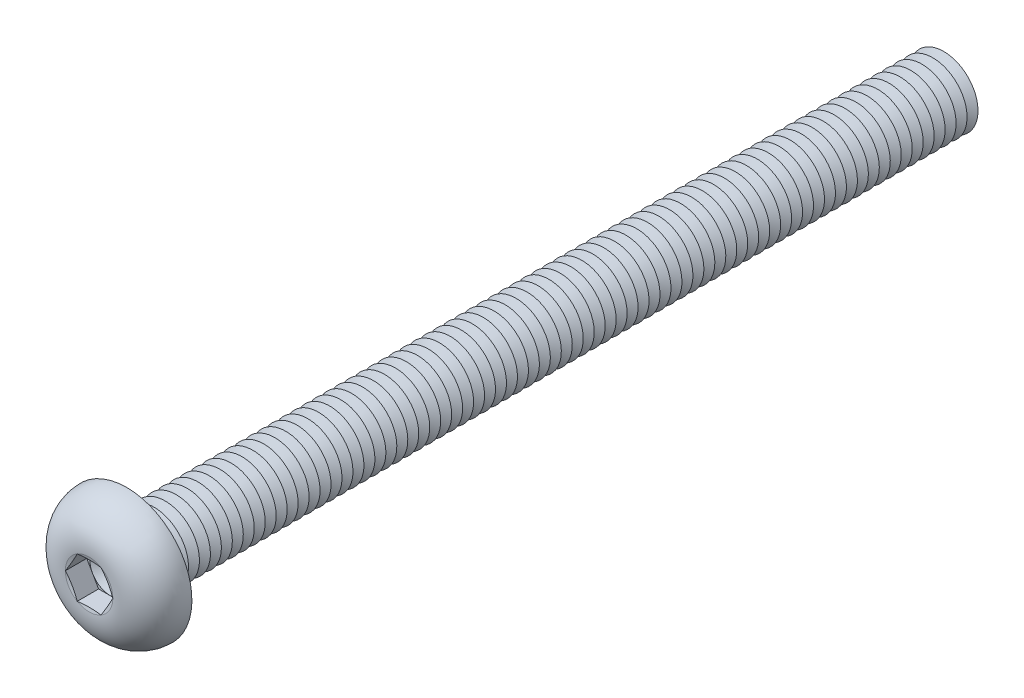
ISO-10303-21;
HEADER;
FILE_DESCRIPTION(('STEP AP214'),'2;1');
FILE_NAME('part.step','',(''),(''),'','','');
FILE_SCHEMA(('AUTOMOTIVE_DESIGN { 1 0 10303 214 1 1 1 1 }'));
ENDSEC;
DATA;
#1=APPLICATION_CONTEXT('core data for automotive mechanical design processes');
#2=APPLICATION_PROTOCOL_DEFINITION('international standard','automotive_design',2000,#1);
#3=PRODUCT_CONTEXT('',#1,'mechanical');
#4=PRODUCT('Part','Part','',(#3));
#5=PRODUCT_RELATED_PRODUCT_CATEGORY('part','',(#4));
#6=PRODUCT_DEFINITION_FORMATION('','',#4);
#7=PRODUCT_DEFINITION_CONTEXT('part definition',#1,'design');
#8=PRODUCT_DEFINITION('design','',#6,#7);
#9=PRODUCT_DEFINITION_SHAPE('','',#8);
#10=(LENGTH_UNIT() NAMED_UNIT(*) SI_UNIT(.MILLI.,.METRE.));
#11=(NAMED_UNIT(*) PLANE_ANGLE_UNIT() SI_UNIT($,.RADIAN.));
#12=(NAMED_UNIT(*) SI_UNIT($,.STERADIAN.) SOLID_ANGLE_UNIT());
#13=UNCERTAINTY_MEASURE_WITH_UNIT(LENGTH_MEASURE(1.E-05),#10,'distance_accuracy_value','');
#14=(GEOMETRIC_REPRESENTATION_CONTEXT(3) GLOBAL_UNCERTAINTY_ASSIGNED_CONTEXT((#13)) GLOBAL_UNIT_ASSIGNED_CONTEXT((#10,
#11,#12)) REPRESENTATION_CONTEXT('',''));
#15=CARTESIAN_POINT('',(0.,0.,0.));
#16=DIRECTION('',(0.,0.,1.));
#17=DIRECTION('',(1.,0.,0.));
#18=AXIS2_PLACEMENT_3D('',#15,#16,#17);
#19=CARTESIAN_POINT('',(0.,0.,1.19));
#20=DIRECTION('',(0.,0.,1.));
#21=DIRECTION('',(1.,0.,0.));
#22=AXIS2_PLACEMENT_3D('',#19,#20,#21);
#23=PLANE('',#22);
#24=CARTESIAN_POINT('',(0.,0.,1.19));
#25=DIRECTION('',(0.,0.,1.));
#26=DIRECTION('',(1.,0.,0.));
#27=AXIS2_PLACEMENT_3D('',#24,#25,#26);
#28=CIRCLE('',#27,1.49999930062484);
#29=CARTESIAN_POINT('',(1.2990375,0.749999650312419,1.19));
#30=VERTEX_POINT('',#29);
#31=CARTESIAN_POINT('',(0.,1.49999930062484,1.19));
#32=VERTEX_POINT('',#31);
#33=EDGE_CURVE('E118',#30,#32,#28,.T.);
#34=ORIENTED_EDGE('',*,*,#33,.F.);
#35=DIRECTION('',(-0.5,0.866025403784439,0.));
#36=VECTOR('',#35,1.);
#37=CARTESIAN_POINT('',(1.73205,0.,1.19));
#38=LINE('',#37,#36);
#39=CARTESIAN_POINT('',(0.866025,1.49999930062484,1.19));
#40=VERTEX_POINT('',#39);
#41=EDGE_CURVE('E125',#30,#40,#38,.T.);
#42=ORIENTED_EDGE('',*,*,#41,.T.);
#43=DIRECTION('',(-1.,0.,0.));
#44=VECTOR('',#43,1.);
#45=CARTESIAN_POINT('',(0.866025,1.49999930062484,1.19));
#46=LINE('',#45,#44);
#47=EDGE_CURVE('E136',#40,#32,#46,.T.);
#48=ORIENTED_EDGE('',*,*,#47,.T.);
#49=EDGE_LOOP('',(#34,#42,#48));
#50=FACE_BOUND('',#49,.T.);
#51=ADVANCED_FACE('F39',(#50),#23,.T.);
#52=CARTESIAN_POINT('',(0.,0.,1.19));
#53=DIRECTION('',(0.,0.,1.));
#54=DIRECTION('',(1.,0.,0.));
#55=AXIS2_PLACEMENT_3D('',#52,#53,#54);
#56=CIRCLE('',#55,1.49999930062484);
#57=CARTESIAN_POINT('',(-1.2990375,0.749999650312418,1.19));
#58=VERTEX_POINT('',#57);
#59=EDGE_CURVE('E11',#32,#58,#56,.T.);
#60=ORIENTED_EDGE('',*,*,#59,.F.);
#61=CARTESIAN_POINT('',(-0.866025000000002,1.49999930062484,1.19));
#62=VERTEX_POINT('',#61);
#63=EDGE_CURVE('E131',#32,#62,#46,.T.);
#64=ORIENTED_EDGE('',*,*,#63,.T.);
#65=DIRECTION('',(-0.5,-0.866025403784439,0.));
#66=VECTOR('',#65,1.);
#67=CARTESIAN_POINT('',(-0.866025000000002,1.49999930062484,1.19));
#68=LINE('',#67,#66);
#69=EDGE_CURVE('E134',#62,#58,#68,.T.);
#70=ORIENTED_EDGE('',*,*,#69,.T.);
#71=EDGE_LOOP('',(#60,#64,#70));
#72=FACE_BOUND('',#71,.T.);
#73=ADVANCED_FACE('F130',(#72),#23,.T.);
#74=CARTESIAN_POINT('',(-1.2990375,-0.749999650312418,1.19));
#75=VERTEX_POINT('',#74);
#76=EDGE_CURVE('E49',#58,#75,#56,.T.);
#77=ORIENTED_EDGE('',*,*,#76,.F.);
#78=CARTESIAN_POINT('',(-1.73205,0.,1.19));
#79=VERTEX_POINT('',#78);
#80=EDGE_CURVE('E143',#58,#79,#68,.T.);
#81=ORIENTED_EDGE('',*,*,#80,.T.);
#82=DIRECTION('',(0.5,-0.866025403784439,0.));
#83=VECTOR('',#82,1.);
#84=CARTESIAN_POINT('',(-1.73205,0.,1.19));
#85=LINE('',#84,#83);
#86=EDGE_CURVE('E151',#79,#75,#85,.T.);
#87=ORIENTED_EDGE('',*,*,#86,.T.);
#88=EDGE_LOOP('',(#77,#81,#87));
#89=FACE_BOUND('',#88,.T.);
#90=ADVANCED_FACE('F865',(#89),#23,.T.);
#91=CARTESIAN_POINT('',(0.,-1.49999930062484,1.19));
#92=VERTEX_POINT('',#91);
#93=EDGE_CURVE('E850',#75,#92,#56,.T.);
#94=ORIENTED_EDGE('',*,*,#93,.F.);
#95=CARTESIAN_POINT('',(-0.866025,-1.49999930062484,1.19));
#96=VERTEX_POINT('',#95);
#97=EDGE_CURVE('E150',#75,#96,#85,.T.);
#98=ORIENTED_EDGE('',*,*,#97,.T.);
#99=DIRECTION('',(1.,0.,0.));
#100=VECTOR('',#99,1.);
#101=CARTESIAN_POINT('',(-0.866025,-1.49999930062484,1.19));
#102=LINE('',#101,#100);
#103=EDGE_CURVE('E156',#96,#92,#102,.T.);
#104=ORIENTED_EDGE('',*,*,#103,.T.);
#105=EDGE_LOOP('',(#94,#98,#104));
#106=FACE_BOUND('',#105,.T.);
#107=ADVANCED_FACE('F858',(#106),#23,.T.);
#108=CARTESIAN_POINT('',(1.2990375,-0.749999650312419,1.19));
#109=VERTEX_POINT('',#108);
#110=EDGE_CURVE('E56',#92,#109,#56,.T.);
#111=ORIENTED_EDGE('',*,*,#110,.F.);
#112=CARTESIAN_POINT('',(0.866025,-1.49999930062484,1.19));
#113=VERTEX_POINT('',#112);
#114=EDGE_CURVE('E155',#92,#113,#102,.T.);
#115=ORIENTED_EDGE('',*,*,#114,.T.);
#116=DIRECTION('',(0.5,0.866025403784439,0.));
#117=VECTOR('',#116,1.);
#118=CARTESIAN_POINT('',(0.866025,-1.49999930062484,1.19));
#119=LINE('',#118,#117);
#120=EDGE_CURVE('E161',#113,#109,#119,.T.);
#121=ORIENTED_EDGE('',*,*,#120,.T.);
#122=EDGE_LOOP('',(#111,#115,#121));
#123=FACE_BOUND('',#122,.T.);
#124=ADVANCED_FACE('F936',(#123),#23,.T.);
#125=CARTESIAN_POINT('',(0.,0.,2.75));
#126=DIRECTION('',(0.,0.,1.));
#127=DIRECTION('',(0.,-1.,0.));
#128=AXIS2_PLACEMENT_3D('',#125,#126,#127);
#129=CONICAL_SURFACE('',#128,1.73205,1.30899693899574);
#130=CARTESIAN_POINT('',(1.73216547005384,-0.000200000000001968,2.75003094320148));
#131=CARTESIAN_POINT('',(1.69619207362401,0.0621077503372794,2.74038633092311));
#132=CARTESIAN_POINT('',(1.66015343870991,0.124528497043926,2.73163050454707));
#133=CARTESIAN_POINT('',(1.58794885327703,0.249590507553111,2.71624720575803));
#134=CARTESIAN_POINT('',(1.5517828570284,0.312231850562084,2.7096205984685));
#135=CARTESIAN_POINT('',(1.47954289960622,0.437355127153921,2.69888271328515));
#136=CARTESIAN_POINT('',(1.4434694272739,0.499836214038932,2.69475862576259));
#137=CARTESIAN_POINT('',(1.37127646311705,0.624878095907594,2.68922863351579));
#138=CARTESIAN_POINT('',(1.33515698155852,0.687438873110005,2.68782220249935));
#139=CARTESIAN_POINT('',(1.26291801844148,0.812560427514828,2.68782220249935));
#140=CARTESIAN_POINT('',(1.22679853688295,0.875121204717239,2.68922863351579));
#141=CARTESIAN_POINT('',(1.1546055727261,1.0001630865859,2.69475862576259));
#142=CARTESIAN_POINT('',(1.11853210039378,1.06264417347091,2.69888271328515));
#143=CARTESIAN_POINT('',(1.0462921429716,1.18776745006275,2.7096205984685));
#144=CARTESIAN_POINT('',(1.01012614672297,1.25040879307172,2.71624720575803));
#145=CARTESIAN_POINT('',(0.937921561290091,1.37547080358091,2.73163050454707));
#146=CARTESIAN_POINT('',(0.901882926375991,1.43789155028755,2.74038633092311));
#147=CARTESIAN_POINT('',(0.865909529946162,1.50019930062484,2.75003094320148));
#148=B_SPLINE_CURVE_WITH_KNOTS('',3,(#130,#131,#132,#133,#134,#135,#136,#137,#138,#139,#140,
#141,#142,#143,#144,#145,#146,#147),.UNSPECIFIED.,.F.,.F.,(4,2,2,2,2,2,2,2,4),(0.,
0.217782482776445,0.435653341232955,0.652399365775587,0.869103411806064,1.08580745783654,
1.30255348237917,1.52042434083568,1.73820682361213),.UNSPECIFIED.);
#149=CARTESIAN_POINT('',(1.73205,0.,2.75));
#150=VERTEX_POINT('',#149);
#151=CARTESIAN_POINT('',(0.866025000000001,1.49999930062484,2.75));
#152=VERTEX_POINT('',#151);
#153=EDGE_CURVE('E219',#150,#152,#148,.T.);
#154=ORIENTED_EDGE('',*,*,#153,.F.);
#155=CARTESIAN_POINT('',(0.,0.,2.75));
#156=DIRECTION('',(0.,0.,-1.));
#157=DIRECTION('',(0.,1.,0.));
#158=AXIS2_PLACEMENT_3D('',#155,#156,#157);
#159=CIRCLE('',#158,1.73205);
#160=EDGE_CURVE('E835',#152,#150,#159,.T.);
#161=ORIENTED_EDGE('',*,*,#160,.F.);
#162=EDGE_LOOP('',(#154,#161));
#163=FACE_BOUND('',#162,.T.);
#164=ADVANCED_FACE('F940',(#163),#129,.F.);
#165=CARTESIAN_POINT('',(0.865909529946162,-1.50019930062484,2.75003094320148));
#166=CARTESIAN_POINT('',(0.901882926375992,-1.43789155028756,2.74038633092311));
#167=CARTESIAN_POINT('',(0.937921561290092,-1.37547080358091,2.73163050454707));
#168=CARTESIAN_POINT('',(1.01012614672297,-1.25040879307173,2.71624720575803));
#169=CARTESIAN_POINT('',(1.0462921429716,-1.18776745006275,2.7096205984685));
#170=CARTESIAN_POINT('',(1.11853210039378,-1.06264417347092,2.69888271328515));
#171=CARTESIAN_POINT('',(1.1546055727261,-1.00016308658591,2.69475862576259));
#172=CARTESIAN_POINT('',(1.22679853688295,-0.875121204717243,2.68922863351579));
#173=CARTESIAN_POINT('',(1.26291801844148,-0.812560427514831,2.68782220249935));
#174=CARTESIAN_POINT('',(1.33515698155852,-0.687438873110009,2.68782220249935));
#175=CARTESIAN_POINT('',(1.37127646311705,-0.624878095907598,2.68922863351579));
#176=CARTESIAN_POINT('',(1.4434694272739,-0.499836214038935,2.69475862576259));
#177=CARTESIAN_POINT('',(1.47954289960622,-0.437355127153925,2.69888271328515));
#178=CARTESIAN_POINT('',(1.5517828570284,-0.312231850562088,2.7096205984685));
#179=CARTESIAN_POINT('',(1.58794885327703,-0.249590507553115,2.71624720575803));
#180=CARTESIAN_POINT('',(1.66015343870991,-0.12452849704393,2.73163050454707));
#181=CARTESIAN_POINT('',(1.69619207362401,-0.0621077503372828,2.74038633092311));
#182=CARTESIAN_POINT('',(1.73216547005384,0.000199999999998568,2.75003094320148));
#183=B_SPLINE_CURVE_WITH_KNOTS('',3,(#165,#166,#167,#168,#169,#170,#171,#172,#173,#174,#175,
#176,#177,#178,#179,#180,#181,#182),.UNSPECIFIED.,.F.,.F.,(4,2,2,2,2,2,2,2,4),(0.,
0.217782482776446,0.435653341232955,0.652399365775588,0.869103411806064,1.08580745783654,
1.30255348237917,1.52042434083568,1.73820682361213),.UNSPECIFIED.);
#184=CARTESIAN_POINT('',(0.866025,-1.49999930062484,2.75));
#185=VERTEX_POINT('',#184);
#186=EDGE_CURVE('E228',#185,#150,#183,.T.);
#187=ORIENTED_EDGE('',*,*,#186,.F.);
#188=EDGE_CURVE('E840',#150,#185,#159,.T.);
#189=ORIENTED_EDGE('',*,*,#188,.F.);
#190=EDGE_LOOP('',(#187,#189));
#191=FACE_BOUND('',#190,.T.);
#192=ADVANCED_FACE('F902',(#191),#129,.F.);
#193=CARTESIAN_POINT('',(-2.61375031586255,-1.49999930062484,3.09338600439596));
#194=CARTESIAN_POINT('',(-2.48719895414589,-1.49999930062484,3.06401688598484));
#195=CARTESIAN_POINT('',(-2.36054180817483,-1.49999930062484,3.03507426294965));
#196=CARTESIAN_POINT('',(-2.10688190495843,-1.49999930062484,2.97862489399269));
#197=CARTESIAN_POINT('',(-1.97987908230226,-1.49999930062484,2.95111844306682));
#198=CARTESIAN_POINT('',(-1.72425281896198,-1.49999930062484,2.89788845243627));
#199=CARTESIAN_POINT('',(-1.59562534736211,-1.49999930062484,2.87218404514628));
#200=CARTESIAN_POINT('',(-1.33776732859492,-1.49999930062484,2.82387586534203));
#201=CARTESIAN_POINT('',(-1.20853672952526,-1.49999930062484,2.80127236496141));
#202=CARTESIAN_POINT('',(-0.952831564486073,-1.49999930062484,2.76126658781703));
#203=CARTESIAN_POINT('',(-0.826376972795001,-1.49999930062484,2.74374018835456));
#204=CARTESIAN_POINT('',(-0.572755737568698,-1.49999930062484,2.71502809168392));
#205=CARTESIAN_POINT('',(-0.44558933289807,-1.49999930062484,2.70384038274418));
#206=CARTESIAN_POINT('',(-0.191333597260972,-1.49999930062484,2.68972083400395));
#207=CARTESIAN_POINT('',(-0.0642464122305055,-1.49999930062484,2.68675270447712));
#208=CARTESIAN_POINT('',(0.189835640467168,-1.49999930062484,2.68959577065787));
#209=CARTESIAN_POINT('',(0.316830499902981,-1.49999930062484,2.69540767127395));
#210=CARTESIAN_POINT('',(0.534182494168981,-1.49999930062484,2.71190493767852));
#211=CARTESIAN_POINT('',(0.624691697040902,-1.49999930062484,2.72073513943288));
#212=CARTESIAN_POINT('',(0.805336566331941,-1.49999930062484,2.74156379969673));
#213=CARTESIAN_POINT('',(0.895472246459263,-1.49999930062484,2.75356214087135));
#214=CARTESIAN_POINT('',(1.0756572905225,-1.49999930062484,2.78006977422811));
#215=CARTESIAN_POINT('',(1.16570548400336,-1.49999930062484,2.7945868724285));
#216=CARTESIAN_POINT('',(1.3454787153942,-1.49999930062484,2.82550612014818));
#217=CARTESIAN_POINT('',(1.43520373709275,-1.49999930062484,2.8419083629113));
#218=CARTESIAN_POINT('',(1.61622412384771,-1.49999930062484,2.87648604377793));
#219=CARTESIAN_POINT('',(1.70751379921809,-1.49999930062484,2.89469103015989));
#220=CARTESIAN_POINT('',(1.88986344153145,-1.49999930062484,2.93221618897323));
#221=CARTESIAN_POINT('',(1.98092340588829,-1.49999930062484,2.95153637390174));
#222=CARTESIAN_POINT('',(2.16236354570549,-1.49999930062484,2.99091506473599));
#223=CARTESIAN_POINT('',(2.25274472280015,-1.49999930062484,3.01096897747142));
#224=CARTESIAN_POINT('',(2.43335289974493,-1.49999930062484,3.05173139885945));
#225=CARTESIAN_POINT('',(2.52357990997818,-1.49999930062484,3.07243986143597));
#226=CARTESIAN_POINT('',(2.61375031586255,-1.49999930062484,3.09338600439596));
#227=B_SPLINE_CURVE_WITH_KNOTS('',3,(#193,#194,#195,#196,#197,#198,#199,#200,#201,#202,#203,
#204,#205,#206,#207,#208,#209,#210,#211,#212,#213,#214,#215,#216,#217,#218,#219,#220,#221,#222,
#223,#224,#225,#226),.UNSPECIFIED.,.F.,.F.,(4,2,2,2,2,2,2,2,2,2,2,2,2,2,2,2,4),(0.,
0.389753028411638,0.779585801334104,1.17307326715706,1.5665952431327,1.94947555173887,
2.33223427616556,2.71330039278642,3.09439710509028,3.36715350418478,3.63989980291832,
3.91350699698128,4.18712773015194,4.4663802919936,4.74563598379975,5.02337106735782,
5.3010866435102),.UNSPECIFIED.);
#228=CARTESIAN_POINT('',(-0.866025,-1.49999930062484,2.75));
#229=VERTEX_POINT('',#228);
#230=EDGE_CURVE('E879',#229,#185,#227,.T.);
#231=ORIENTED_EDGE('',*,*,#230,.F.);
#232=EDGE_CURVE('E892',#185,#229,#159,.T.);
#233=ORIENTED_EDGE('',*,*,#232,.F.);
#234=EDGE_LOOP('',(#231,#233));
#235=FACE_BOUND('',#234,.T.);
#236=ADVANCED_FACE('F907',(#235),#129,.F.);
#237=CARTESIAN_POINT('',(-1.73216547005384,0.000199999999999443,2.75003094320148));
#238=CARTESIAN_POINT('',(-1.69619207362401,-0.0621077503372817,2.74038633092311));
#239=CARTESIAN_POINT('',(-1.66015343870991,-0.124528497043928,2.73163050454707));
#240=CARTESIAN_POINT('',(-1.58794885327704,-0.249590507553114,2.71624720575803));
#241=CARTESIAN_POINT('',(-1.55178285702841,-0.312231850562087,2.7096205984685));
#242=CARTESIAN_POINT('',(-1.47954289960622,-0.437355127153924,2.69888271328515));
#243=CARTESIAN_POINT('',(-1.4434694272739,-0.499836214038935,2.69475862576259));
#244=CARTESIAN_POINT('',(-1.37127646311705,-0.624878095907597,2.68922863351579));
#245=CARTESIAN_POINT('',(-1.33515698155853,-0.687438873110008,2.68782220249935));
#246=CARTESIAN_POINT('',(-1.26291801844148,-0.812560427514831,2.68782220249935));
#247=CARTESIAN_POINT('',(-1.22679853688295,-0.875121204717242,2.68922863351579));
#248=CARTESIAN_POINT('',(-1.1546055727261,-1.0001630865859,2.69475862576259));
#249=CARTESIAN_POINT('',(-1.11853210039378,-1.06264417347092,2.69888271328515));
#250=CARTESIAN_POINT('',(-1.0462921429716,-1.18776745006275,2.7096205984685));
#251=CARTESIAN_POINT('',(-1.01012614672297,-1.25040879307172,2.71624720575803));
#252=CARTESIAN_POINT('',(-0.937921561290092,-1.37547080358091,2.73163050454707));
#253=CARTESIAN_POINT('',(-0.901882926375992,-1.43789155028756,2.74038633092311));
#254=CARTESIAN_POINT('',(-0.865909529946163,-1.50019930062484,2.75003094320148));
#255=B_SPLINE_CURVE_WITH_KNOTS('',3,(#237,#238,#239,#240,#241,#242,#243,#244,#245,#246,#247,
#248,#249,#250,#251,#252,#253,#254),.UNSPECIFIED.,.F.,.F.,(4,2,2,2,2,2,2,2,4),(0.,
0.217782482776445,0.435653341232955,0.652399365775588,0.869103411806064,1.08580745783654,
1.30255348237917,1.52042434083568,1.73820682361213),.UNSPECIFIED.);
#256=CARTESIAN_POINT('',(-1.73205,0.,2.75));
#257=VERTEX_POINT('',#256);
#258=EDGE_CURVE('E870',#257,#229,#255,.T.);
#259=ORIENTED_EDGE('',*,*,#258,.F.);
#260=EDGE_CURVE('E876',#229,#257,#159,.T.);
#261=ORIENTED_EDGE('',*,*,#260,.F.);
#262=EDGE_LOOP('',(#259,#261));
#263=FACE_BOUND('',#262,.T.);
#264=ADVANCED_FACE('F874',(#263),#129,.F.);
#265=CARTESIAN_POINT('',(-0.865909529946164,1.50019930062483,2.75003094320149));
#266=CARTESIAN_POINT('',(-0.901882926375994,1.43789155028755,2.74038633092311));
#267=CARTESIAN_POINT('',(-0.937921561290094,1.37547080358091,2.73163050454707));
#268=CARTESIAN_POINT('',(-1.01012614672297,1.25040879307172,2.71624720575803));
#269=CARTESIAN_POINT('',(-1.0462921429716,1.18776745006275,2.7096205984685));
#270=CARTESIAN_POINT('',(-1.11853210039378,1.06264417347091,2.69888271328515));
#271=CARTESIAN_POINT('',(-1.1546055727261,1.0001630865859,2.69475862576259));
#272=CARTESIAN_POINT('',(-1.22679853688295,0.87512120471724,2.68922863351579));
#273=CARTESIAN_POINT('',(-1.26291801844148,0.812560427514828,2.68782220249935));
#274=CARTESIAN_POINT('',(-1.33515698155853,0.687438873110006,2.68782220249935));
#275=CARTESIAN_POINT('',(-1.37127646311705,0.624878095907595,2.68922863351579));
#276=CARTESIAN_POINT('',(-1.4434694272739,0.499836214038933,2.69475862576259));
#277=CARTESIAN_POINT('',(-1.47954289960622,0.437355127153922,2.69888271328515));
#278=CARTESIAN_POINT('',(-1.55178285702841,0.312231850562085,2.7096205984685));
#279=CARTESIAN_POINT('',(-1.58794885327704,0.249590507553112,2.71624720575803));
#280=CARTESIAN_POINT('',(-1.66015343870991,0.124528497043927,2.73163050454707));
#281=CARTESIAN_POINT('',(-1.69619207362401,0.0621077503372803,2.74038633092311));
#282=CARTESIAN_POINT('',(-1.73216547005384,-0.000200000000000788,2.75003094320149));
#283=B_SPLINE_CURVE_WITH_KNOTS('',3,(#265,#266,#267,#268,#269,#270,#271,#272,#273,#274,#275,
#276,#277,#278,#279,#280,#281,#282),.UNSPECIFIED.,.F.,.F.,(4,2,2,2,2,2,2,2,4),(0.,
0.217782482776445,0.435653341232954,0.652399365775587,0.869103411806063,1.08580745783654,
1.30255348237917,1.52042434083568,1.73820682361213),.UNSPECIFIED.);
#284=CARTESIAN_POINT('',(-0.866025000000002,1.49999930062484,2.75));
#285=VERTEX_POINT('',#284);
#286=EDGE_CURVE('E193',#285,#257,#283,.T.);
#287=ORIENTED_EDGE('',*,*,#286,.F.);
#288=EDGE_CURVE('E882',#257,#285,#159,.T.);
#289=ORIENTED_EDGE('',*,*,#288,.F.);
#290=EDGE_LOOP('',(#287,#289));
#291=FACE_BOUND('',#290,.T.);
#292=ADVANCED_FACE('F883',(#291),#129,.F.);
#293=CARTESIAN_POINT('',(0.,0.,-57.2));
#294=DIRECTION('',(0.,0.,1.));
#295=DIRECTION('',(0.,-1.,0.));
#296=AXIS2_PLACEMENT_3D('',#293,#294,#295);
#297=CONICAL_SURFACE('',#296,2.49999999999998,1.0471975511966);
#298=CARTESIAN_POINT('',(0.,0.,-57.6));
#299=DIRECTION('',(0.,0.,1.));
#300=DIRECTION('',(0.,-1.,0.));
#301=AXIS2_PLACEMENT_3D('',#298,#299,#300);
#302=CIRCLE('',#301,1.80717967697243);
#303=CARTESIAN_POINT('',(0.,-1.8071796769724,-57.6));
#304=VERTEX_POINT('',#303);
#305=EDGE_CURVE('E806',#304,#304,#302,.T.);
#306=ORIENTED_EDGE('',*,*,#305,.T.);
#307=EDGE_LOOP('',(#306));
#308=FACE_BOUND('',#307,.T.);
#309=CARTESIAN_POINT('',(0.,0.,-57.2));
#310=DIRECTION('',(0.,0.,1.));
#311=DIRECTION('',(0.,-1.,0.));
#312=AXIS2_PLACEMENT_3D('',#309,#310,#311);
#313=CIRCLE('',#312,2.49999999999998);
#314=CARTESIAN_POINT('',(0.,-2.49999999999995,-57.2));
#315=VERTEX_POINT('',#314);
#316=EDGE_CURVE('E802',#315,#315,#313,.T.);
#317=ORIENTED_EDGE('',*,*,#316,.F.);
#318=EDGE_LOOP('',(#317));
#319=FACE_BOUND('',#318,.T.);
#320=ADVANCED_FACE('F967',(#308,#319),#297,.T.);
#321=CARTESIAN_POINT('',(0.,0.,-57.6));
#322=DIRECTION('',(0.,0.,-1.));
#323=DIRECTION('',(0.,1.,0.));
#324=AXIS2_PLACEMENT_3D('',#321,#322,#323);
#325=CONICAL_SURFACE('',#324,1.80717967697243,1.04719755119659);
#326=CARTESIAN_POINT('',(0.,0.,-58.));
#327=DIRECTION('',(0.,0.,1.));
#328=DIRECTION('',(0.,-1.,0.));
#329=AXIS2_PLACEMENT_3D('',#326,#327,#328);
#330=CIRCLE('',#329,2.49999999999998);
#331=CARTESIAN_POINT('',(0.,-2.49999999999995,-58.));
#332=VERTEX_POINT('',#331);
#333=EDGE_CURVE('E810',#332,#332,#330,.T.);
#334=ORIENTED_EDGE('',*,*,#333,.T.);
#335=EDGE_LOOP('',(#334));
#336=FACE_BOUND('',#335,.T.);
#337=ORIENTED_EDGE('',*,*,#305,.F.);
#338=EDGE_LOOP('',(#337));
#339=FACE_BOUND('',#338,.T.);
#340=ADVANCED_FACE('F972',(#336,#339),#325,.T.);
#341=CARTESIAN_POINT('',(0.,2.49999999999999,-60.));
#342=DIRECTION('',(0.,0.,-1.));
#343=DIRECTION('',(0.,1.,0.));
#344=AXIS2_PLACEMENT_3D('',#341,#342,#343);
#345=PLANE('',#344);
#346=CARTESIAN_POINT('',(0.,0.,-60.));
#347=DIRECTION('',(0.,0.,1.));
#348=DIRECTION('',(0.,-1.,0.));
#349=AXIS2_PLACEMENT_3D('',#346,#347,#348);
#350=CIRCLE('',#349,1.80717967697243);
#351=CARTESIAN_POINT('',(0.,-1.8071796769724,-60.));
#352=VERTEX_POINT('',#351);
#353=EDGE_CURVE('E830',#352,#352,#350,.T.);
#354=ORIENTED_EDGE('',*,*,#353,.F.);
#355=EDGE_LOOP('',(#354));
#356=FACE_BOUND('',#355,.T.);
#357=ADVANCED_FACE('F1139',(#356),#345,.T.);
#358=CARTESIAN_POINT('',(0.,0.,-59.6));
#359=DIRECTION('',(0.,0.,1.));
#360=DIRECTION('',(0.,-1.,0.));
#361=AXIS2_PLACEMENT_3D('',#358,#359,#360);
#362=CONICAL_SURFACE('',#361,2.49999999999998,1.0471975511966);
#363=ORIENTED_EDGE('',*,*,#353,.T.);
#364=EDGE_LOOP('',(#363));
#365=FACE_BOUND('',#364,.T.);
#366=CARTESIAN_POINT('',(0.,0.,-59.6));
#367=DIRECTION('',(0.,0.,1.));
#368=DIRECTION('',(0.,-1.,0.));
#369=AXIS2_PLACEMENT_3D('',#366,#367,#368);
#370=CIRCLE('',#369,2.49999999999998);
#371=CARTESIAN_POINT('',(0.,-2.49999999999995,-59.6));
#372=VERTEX_POINT('',#371);
#373=EDGE_CURVE('E826',#372,#372,#370,.T.);
#374=ORIENTED_EDGE('',*,*,#373,.F.);
#375=EDGE_LOOP('',(#374));
#376=FACE_BOUND('',#375,.T.);
#377=ADVANCED_FACE('F1132',(#365,#376),#362,.T.);
#378=CARTESIAN_POINT('',(0.,0.,-59.2));
#379=DIRECTION('',(0.,0.,-1.));
#380=DIRECTION('',(0.,1.,0.));
#381=AXIS2_PLACEMENT_3D('',#378,#379,#380);
#382=CONICAL_SURFACE('',#381,1.80717967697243,1.04719755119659);
#383=ORIENTED_EDGE('',*,*,#373,.T.);
#384=EDGE_LOOP('',(#383));
#385=FACE_BOUND('',#384,.T.);
#386=CARTESIAN_POINT('',(0.,0.,-59.2));
#387=DIRECTION('',(0.,0.,1.));
#388=DIRECTION('',(0.,-1.,0.));
#389=AXIS2_PLACEMENT_3D('',#386,#387,#388);
#390=CIRCLE('',#389,1.80717967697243);
#391=CARTESIAN_POINT('',(0.,-1.8071796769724,-59.2));
#392=VERTEX_POINT('',#391);
#393=EDGE_CURVE('E822',#392,#392,#390,.T.);
#394=ORIENTED_EDGE('',*,*,#393,.F.);
#395=EDGE_LOOP('',(#394));
#396=FACE_BOUND('',#395,.T.);
#397=ADVANCED_FACE('F1138',(#385,#396),#382,.T.);
#398=CARTESIAN_POINT('',(0.,0.,-58.8));
#399=DIRECTION('',(0.,0.,1.));
#400=DIRECTION('',(0.,-1.,0.));
#401=AXIS2_PLACEMENT_3D('',#398,#399,#400);
#402=CONICAL_SURFACE('',#401,2.49999999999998,1.0471975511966);
#403=ORIENTED_EDGE('',*,*,#393,.T.);
#404=EDGE_LOOP('',(#403));
#405=FACE_BOUND('',#404,.T.);
#406=CARTESIAN_POINT('',(0.,0.,-58.8));
#407=DIRECTION('',(0.,0.,1.));
#408=DIRECTION('',(0.,-1.,0.));
#409=AXIS2_PLACEMENT_3D('',#406,#407,#408);
#410=CIRCLE('',#409,2.49999999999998);
#411=CARTESIAN_POINT('',(0.,-2.49999999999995,-58.8));
#412=VERTEX_POINT('',#411);
#413=EDGE_CURVE('E818',#412,#412,#410,.T.);
#414=ORIENTED_EDGE('',*,*,#413,.F.);
#415=EDGE_LOOP('',(#414));
#416=FACE_BOUND('',#415,.T.);
#417=ADVANCED_FACE('F1170',(#405,#416),#402,.T.);
#418=CARTESIAN_POINT('',(0.,0.,-58.4));
#419=DIRECTION('',(0.,0.,-1.));
#420=DIRECTION('',(0.,1.,0.));
#421=AXIS2_PLACEMENT_3D('',#418,#419,#420);
#422=CONICAL_SURFACE('',#421,1.80717967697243,1.04719755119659);
#423=ORIENTED_EDGE('',*,*,#413,.T.);
#424=EDGE_LOOP('',(#423));
#425=FACE_BOUND('',#424,.T.);
#426=CARTESIAN_POINT('',(0.,0.,-58.4));
#427=DIRECTION('',(0.,0.,1.));
#428=DIRECTION('',(0.,-1.,0.));
#429=AXIS2_PLACEMENT_3D('',#426,#427,#428);
#430=CIRCLE('',#429,1.80717967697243);
#431=CARTESIAN_POINT('',(0.,-1.8071796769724,-58.4));
#432=VERTEX_POINT('',#431);
#433=EDGE_CURVE('E814',#432,#432,#430,.T.);
#434=ORIENTED_EDGE('',*,*,#433,.F.);
#435=EDGE_LOOP('',(#434));
#436=FACE_BOUND('',#435,.T.);
#437=ADVANCED_FACE('F1180',(#425,#436),#422,.T.);
#438=CARTESIAN_POINT('',(0.,0.,-58.));
#439=DIRECTION('',(0.,0.,1.));
#440=DIRECTION('',(0.,-1.,0.));
#441=AXIS2_PLACEMENT_3D('',#438,#439,#440);
#442=CONICAL_SURFACE('',#441,2.49999999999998,1.0471975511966);
#443=ORIENTED_EDGE('',*,*,#433,.T.);
#444=EDGE_LOOP('',(#443));
#445=FACE_BOUND('',#444,.T.);
#446=ORIENTED_EDGE('',*,*,#333,.F.);
#447=EDGE_LOOP('',(#446));
#448=FACE_BOUND('',#447,.T.);
#449=ADVANCED_FACE('F1190',(#445,#448),#442,.T.);
#450=CARTESIAN_POINT('',(0.,0.,-56.4));
#451=DIRECTION('',(0.,0.,1.));
#452=DIRECTION('',(0.,-1.,0.));
#453=AXIS2_PLACEMENT_3D('',#450,#451,#452);
#454=CONICAL_SURFACE('',#453,2.49999999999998,1.0471975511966);
#455=CARTESIAN_POINT('',(0.,0.,-56.8));
#456=DIRECTION('',(0.,0.,1.));
#457=DIRECTION('',(0.,-1.,0.));
#458=AXIS2_PLACEMENT_3D('',#455,#456,#457);
#459=CIRCLE('',#458,1.80717967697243);
#460=CARTESIAN_POINT('',(0.,-1.8071796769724,-56.8));
#461=VERTEX_POINT('',#460);
#462=EDGE_CURVE('E798',#461,#461,#459,.T.);
#463=ORIENTED_EDGE('',*,*,#462,.T.);
#464=EDGE_LOOP('',(#463));
#465=FACE_BOUND('',#464,.T.);
#466=CARTESIAN_POINT('',(0.,0.,-56.4));
#467=DIRECTION('',(0.,0.,1.));
#468=DIRECTION('',(0.,-1.,0.));
#469=AXIS2_PLACEMENT_3D('',#466,#467,#468);
#470=CIRCLE('',#469,2.49999999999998);
#471=CARTESIAN_POINT('',(0.,-2.49999999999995,-56.4));
#472=VERTEX_POINT('',#471);
#473=EDGE_CURVE('E794',#472,#472,#470,.T.);
#474=ORIENTED_EDGE('',*,*,#473,.F.);
#475=EDGE_LOOP('',(#474));
#476=FACE_BOUND('',#475,.T.);
#477=ADVANCED_FACE('F1200',(#465,#476),#454,.T.);
#478=CARTESIAN_POINT('',(0.,0.,-56.8));
#479=DIRECTION('',(0.,0.,-1.));
#480=DIRECTION('',(0.,1.,0.));
#481=AXIS2_PLACEMENT_3D('',#478,#479,#480);
#482=CONICAL_SURFACE('',#481,1.80717967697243,1.04719755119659);
#483=ORIENTED_EDGE('',*,*,#316,.T.);
#484=EDGE_LOOP('',(#483));
#485=FACE_BOUND('',#484,.T.);
#486=ORIENTED_EDGE('',*,*,#462,.F.);
#487=EDGE_LOOP('',(#486));
#488=FACE_BOUND('',#487,.T.);
#489=ADVANCED_FACE('F1210',(#485,#488),#482,.T.);
#490=CARTESIAN_POINT('',(0.,0.,-55.6));
#491=DIRECTION('',(0.,0.,1.));
#492=DIRECTION('',(0.,-1.,0.));
#493=AXIS2_PLACEMENT_3D('',#490,#491,#492);
#494=CONICAL_SURFACE('',#493,2.49999999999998,1.0471975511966);
#495=CARTESIAN_POINT('',(0.,0.,-56.));
#496=DIRECTION('',(0.,0.,1.));
#497=DIRECTION('',(0.,-1.,0.));
#498=AXIS2_PLACEMENT_3D('',#495,#496,#497);
#499=CIRCLE('',#498,1.80717967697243);
#500=CARTESIAN_POINT('',(0.,-1.8071796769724,-56.));
#501=VERTEX_POINT('',#500);
#502=EDGE_CURVE('E790',#501,#501,#499,.T.);
#503=ORIENTED_EDGE('',*,*,#502,.T.);
#504=EDGE_LOOP('',(#503));
#505=FACE_BOUND('',#504,.T.);
#506=CARTESIAN_POINT('',(0.,0.,-55.6));
#507=DIRECTION('',(0.,0.,1.));
#508=DIRECTION('',(0.,-1.,0.));
#509=AXIS2_PLACEMENT_3D('',#506,#507,#508);
#510=CIRCLE('',#509,2.49999999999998);
#511=CARTESIAN_POINT('',(0.,-2.49999999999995,-55.6));
#512=VERTEX_POINT('',#511);
#513=EDGE_CURVE('E786',#512,#512,#510,.T.);
#514=ORIENTED_EDGE('',*,*,#513,.F.);
#515=EDGE_LOOP('',(#514));
#516=FACE_BOUND('',#515,.T.);
#517=ADVANCED_FACE('F1220',(#505,#516),#494,.T.);
#518=CARTESIAN_POINT('',(0.,0.,-56.));
#519=DIRECTION('',(0.,0.,-1.));
#520=DIRECTION('',(0.,1.,0.));
#521=AXIS2_PLACEMENT_3D('',#518,#519,#520);
#522=CONICAL_SURFACE('',#521,1.80717967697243,1.04719755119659);
#523=ORIENTED_EDGE('',*,*,#473,.T.);
#524=EDGE_LOOP('',(#523));
#525=FACE_BOUND('',#524,.T.);
#526=ORIENTED_EDGE('',*,*,#502,.F.);
#527=EDGE_LOOP('',(#526));
#528=FACE_BOUND('',#527,.T.);
#529=ADVANCED_FACE('F1230',(#525,#528),#522,.T.);
#530=CARTESIAN_POINT('',(0.,0.,-54.8));
#531=DIRECTION('',(0.,0.,1.));
#532=DIRECTION('',(0.,-1.,0.));
#533=AXIS2_PLACEMENT_3D('',#530,#531,#532);
#534=CONICAL_SURFACE('',#533,2.49999999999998,1.0471975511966);
#535=CARTESIAN_POINT('',(0.,0.,-55.2));
#536=DIRECTION('',(0.,0.,1.));
#537=DIRECTION('',(0.,-1.,0.));
#538=AXIS2_PLACEMENT_3D('',#535,#536,#537);
#539=CIRCLE('',#538,1.80717967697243);
#540=CARTESIAN_POINT('',(0.,-1.8071796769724,-55.2));
#541=VERTEX_POINT('',#540);
#542=EDGE_CURVE('E782',#541,#541,#539,.T.);
#543=ORIENTED_EDGE('',*,*,#542,.T.);
#544=EDGE_LOOP('',(#543));
#545=FACE_BOUND('',#544,.T.);
#546=CARTESIAN_POINT('',(0.,0.,-54.8));
#547=DIRECTION('',(0.,0.,1.));
#548=DIRECTION('',(0.,-1.,0.));
#549=AXIS2_PLACEMENT_3D('',#546,#547,#548);
#550=CIRCLE('',#549,2.49999999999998);
#551=CARTESIAN_POINT('',(0.,-2.49999999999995,-54.8));
#552=VERTEX_POINT('',#551);
#553=EDGE_CURVE('E778',#552,#552,#550,.T.);
#554=ORIENTED_EDGE('',*,*,#553,.F.);
#555=EDGE_LOOP('',(#554));
#556=FACE_BOUND('',#555,.T.);
#557=ADVANCED_FACE('F1240',(#545,#556),#534,.T.);
#558=CARTESIAN_POINT('',(0.,0.,-55.2));
#559=DIRECTION('',(0.,0.,-1.));
#560=DIRECTION('',(0.,1.,0.));
#561=AXIS2_PLACEMENT_3D('',#558,#559,#560);
#562=CONICAL_SURFACE('',#561,1.80717967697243,1.04719755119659);
#563=ORIENTED_EDGE('',*,*,#513,.T.);
#564=EDGE_LOOP('',(#563));
#565=FACE_BOUND('',#564,.T.);
#566=ORIENTED_EDGE('',*,*,#542,.F.);
#567=EDGE_LOOP('',(#566));
#568=FACE_BOUND('',#567,.T.);
#569=ADVANCED_FACE('F1250',(#565,#568),#562,.T.);
#570=CARTESIAN_POINT('',(0.,0.,-54.));
#571=DIRECTION('',(0.,0.,1.));
#572=DIRECTION('',(0.,-1.,0.));
#573=AXIS2_PLACEMENT_3D('',#570,#571,#572);
#574=CONICAL_SURFACE('',#573,2.49999999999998,1.0471975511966);
#575=CARTESIAN_POINT('',(0.,0.,-54.4));
#576=DIRECTION('',(0.,0.,1.));
#577=DIRECTION('',(0.,-1.,0.));
#578=AXIS2_PLACEMENT_3D('',#575,#576,#577);
#579=CIRCLE('',#578,1.80717967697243);
#580=CARTESIAN_POINT('',(0.,-1.8071796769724,-54.4));
#581=VERTEX_POINT('',#580);
#582=EDGE_CURVE('E774',#581,#581,#579,.T.);
#583=ORIENTED_EDGE('',*,*,#582,.T.);
#584=EDGE_LOOP('',(#583));
#585=FACE_BOUND('',#584,.T.);
#586=CARTESIAN_POINT('',(0.,0.,-54.));
#587=DIRECTION('',(0.,0.,1.));
#588=DIRECTION('',(0.,-1.,0.));
#589=AXIS2_PLACEMENT_3D('',#586,#587,#588);
#590=CIRCLE('',#589,2.49999999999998);
#591=CARTESIAN_POINT('',(0.,-2.49999999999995,-54.));
#592=VERTEX_POINT('',#591);
#593=EDGE_CURVE('E770',#592,#592,#590,.T.);
#594=ORIENTED_EDGE('',*,*,#593,.F.);
#595=EDGE_LOOP('',(#594));
#596=FACE_BOUND('',#595,.T.);
#597=ADVANCED_FACE('F1260',(#585,#596),#574,.T.);
#598=CARTESIAN_POINT('',(0.,0.,-54.4));
#599=DIRECTION('',(0.,0.,-1.));
#600=DIRECTION('',(0.,1.,0.));
#601=AXIS2_PLACEMENT_3D('',#598,#599,#600);
#602=CONICAL_SURFACE('',#601,1.80717967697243,1.04719755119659);
#603=ORIENTED_EDGE('',*,*,#553,.T.);
#604=EDGE_LOOP('',(#603));
#605=FACE_BOUND('',#604,.T.);
#606=ORIENTED_EDGE('',*,*,#582,.F.);
#607=EDGE_LOOP('',(#606));
#608=FACE_BOUND('',#607,.T.);
#609=ADVANCED_FACE('F1270',(#605,#608),#602,.T.);
#610=CARTESIAN_POINT('',(0.,0.,-53.2));
#611=DIRECTION('',(0.,0.,1.));
#612=DIRECTION('',(0.,-1.,0.));
#613=AXIS2_PLACEMENT_3D('',#610,#611,#612);
#614=CONICAL_SURFACE('',#613,2.49999999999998,1.0471975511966);
#615=CARTESIAN_POINT('',(0.,0.,-53.6));
#616=DIRECTION('',(0.,0.,1.));
#617=DIRECTION('',(0.,-1.,0.));
#618=AXIS2_PLACEMENT_3D('',#615,#616,#617);
#619=CIRCLE('',#618,1.80717967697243);
#620=CARTESIAN_POINT('',(0.,-1.8071796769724,-53.6));
#621=VERTEX_POINT('',#620);
#622=EDGE_CURVE('E766',#621,#621,#619,.T.);
#623=ORIENTED_EDGE('',*,*,#622,.T.);
#624=EDGE_LOOP('',(#623));
#625=FACE_BOUND('',#624,.T.);
#626=CARTESIAN_POINT('',(0.,0.,-53.2));
#627=DIRECTION('',(0.,0.,1.));
#628=DIRECTION('',(0.,-1.,0.));
#629=AXIS2_PLACEMENT_3D('',#626,#627,#628);
#630=CIRCLE('',#629,2.49999999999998);
#631=CARTESIAN_POINT('',(0.,-2.49999999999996,-53.2));
#632=VERTEX_POINT('',#631);
#633=EDGE_CURVE('E762',#632,#632,#630,.T.);
#634=ORIENTED_EDGE('',*,*,#633,.F.);
#635=EDGE_LOOP('',(#634));
#636=FACE_BOUND('',#635,.T.);
#637=ADVANCED_FACE('F1280',(#625,#636),#614,.T.);
#638=CARTESIAN_POINT('',(0.,0.,-53.6));
#639=DIRECTION('',(0.,0.,-1.));
#640=DIRECTION('',(0.,1.,0.));
#641=AXIS2_PLACEMENT_3D('',#638,#639,#640);
#642=CONICAL_SURFACE('',#641,1.80717967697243,1.04719755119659);
#643=ORIENTED_EDGE('',*,*,#593,.T.);
#644=EDGE_LOOP('',(#643));
#645=FACE_BOUND('',#644,.T.);
#646=ORIENTED_EDGE('',*,*,#622,.F.);
#647=EDGE_LOOP('',(#646));
#648=FACE_BOUND('',#647,.T.);
#649=ADVANCED_FACE('F1290',(#645,#648),#642,.T.);
#650=CARTESIAN_POINT('',(0.,0.,-52.4));
#651=DIRECTION('',(0.,0.,1.));
#652=DIRECTION('',(0.,-1.,0.));
#653=AXIS2_PLACEMENT_3D('',#650,#651,#652);
#654=CONICAL_SURFACE('',#653,2.49999999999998,1.0471975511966);
#655=CARTESIAN_POINT('',(0.,0.,-52.8));
#656=DIRECTION('',(0.,0.,1.));
#657=DIRECTION('',(0.,-1.,0.));
#658=AXIS2_PLACEMENT_3D('',#655,#656,#657);
#659=CIRCLE('',#658,1.80717967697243);
#660=CARTESIAN_POINT('',(0.,-1.8071796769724,-52.8));
#661=VERTEX_POINT('',#660);
#662=EDGE_CURVE('E758',#661,#661,#659,.T.);
#663=ORIENTED_EDGE('',*,*,#662,.T.);
#664=EDGE_LOOP('',(#663));
#665=FACE_BOUND('',#664,.T.);
#666=CARTESIAN_POINT('',(0.,0.,-52.4));
#667=DIRECTION('',(0.,0.,1.));
#668=DIRECTION('',(0.,-1.,0.));
#669=AXIS2_PLACEMENT_3D('',#666,#667,#668);
#670=CIRCLE('',#669,2.49999999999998);
#671=CARTESIAN_POINT('',(0.,-2.49999999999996,-52.4));
#672=VERTEX_POINT('',#671);
#673=EDGE_CURVE('E754',#672,#672,#670,.T.);
#674=ORIENTED_EDGE('',*,*,#673,.F.);
#675=EDGE_LOOP('',(#674));
#676=FACE_BOUND('',#675,.T.);
#677=ADVANCED_FACE('F1300',(#665,#676),#654,.T.);
#678=CARTESIAN_POINT('',(0.,0.,-52.8));
#679=DIRECTION('',(0.,0.,-1.));
#680=DIRECTION('',(0.,1.,0.));
#681=AXIS2_PLACEMENT_3D('',#678,#679,#680);
#682=CONICAL_SURFACE('',#681,1.80717967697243,1.04719755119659);
#683=ORIENTED_EDGE('',*,*,#633,.T.);
#684=EDGE_LOOP('',(#683));
#685=FACE_BOUND('',#684,.T.);
#686=ORIENTED_EDGE('',*,*,#662,.F.);
#687=EDGE_LOOP('',(#686));
#688=FACE_BOUND('',#687,.T.);
#689=ADVANCED_FACE('F1310',(#685,#688),#682,.T.);
#690=CARTESIAN_POINT('',(0.,0.,-51.6));
#691=DIRECTION('',(0.,0.,1.));
#692=DIRECTION('',(0.,-1.,0.));
#693=AXIS2_PLACEMENT_3D('',#690,#691,#692);
#694=CONICAL_SURFACE('',#693,2.49999999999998,1.0471975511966);
#695=CARTESIAN_POINT('',(0.,0.,-52.));
#696=DIRECTION('',(0.,0.,1.));
#697=DIRECTION('',(0.,-1.,0.));
#698=AXIS2_PLACEMENT_3D('',#695,#696,#697);
#699=CIRCLE('',#698,1.80717967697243);
#700=CARTESIAN_POINT('',(0.,-1.8071796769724,-52.));
#701=VERTEX_POINT('',#700);
#702=EDGE_CURVE('E750',#701,#701,#699,.T.);
#703=ORIENTED_EDGE('',*,*,#702,.T.);
#704=EDGE_LOOP('',(#703));
#705=FACE_BOUND('',#704,.T.);
#706=CARTESIAN_POINT('',(0.,0.,-51.6));
#707=DIRECTION('',(0.,0.,1.));
#708=DIRECTION('',(0.,-1.,0.));
#709=AXIS2_PLACEMENT_3D('',#706,#707,#708);
#710=CIRCLE('',#709,2.49999999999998);
#711=CARTESIAN_POINT('',(0.,-2.49999999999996,-51.6));
#712=VERTEX_POINT('',#711);
#713=EDGE_CURVE('E746',#712,#712,#710,.T.);
#714=ORIENTED_EDGE('',*,*,#713,.F.);
#715=EDGE_LOOP('',(#714));
#716=FACE_BOUND('',#715,.T.);
#717=ADVANCED_FACE('F1320',(#705,#716),#694,.T.);
#718=CARTESIAN_POINT('',(0.,0.,-52.));
#719=DIRECTION('',(0.,0.,-1.));
#720=DIRECTION('',(0.,1.,0.));
#721=AXIS2_PLACEMENT_3D('',#718,#719,#720);
#722=CONICAL_SURFACE('',#721,1.80717967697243,1.04719755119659);
#723=ORIENTED_EDGE('',*,*,#673,.T.);
#724=EDGE_LOOP('',(#723));
#725=FACE_BOUND('',#724,.T.);
#726=ORIENTED_EDGE('',*,*,#702,.F.);
#727=EDGE_LOOP('',(#726));
#728=FACE_BOUND('',#727,.T.);
#729=ADVANCED_FACE('F1330',(#725,#728),#722,.T.);
#730=CARTESIAN_POINT('',(0.,0.,-50.8));
#731=DIRECTION('',(0.,0.,1.));
#732=DIRECTION('',(0.,-1.,0.));
#733=AXIS2_PLACEMENT_3D('',#730,#731,#732);
#734=CONICAL_SURFACE('',#733,2.49999999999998,1.0471975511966);
#735=CARTESIAN_POINT('',(0.,0.,-51.2));
#736=DIRECTION('',(0.,0.,1.));
#737=DIRECTION('',(0.,-1.,0.));
#738=AXIS2_PLACEMENT_3D('',#735,#736,#737);
#739=CIRCLE('',#738,1.80717967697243);
#740=CARTESIAN_POINT('',(0.,-1.8071796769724,-51.2));
#741=VERTEX_POINT('',#740);
#742=EDGE_CURVE('E742',#741,#741,#739,.T.);
#743=ORIENTED_EDGE('',*,*,#742,.T.);
#744=EDGE_LOOP('',(#743));
#745=FACE_BOUND('',#744,.T.);
#746=CARTESIAN_POINT('',(0.,0.,-50.8));
#747=DIRECTION('',(0.,0.,1.));
#748=DIRECTION('',(0.,-1.,0.));
#749=AXIS2_PLACEMENT_3D('',#746,#747,#748);
#750=CIRCLE('',#749,2.49999999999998);
#751=CARTESIAN_POINT('',(0.,-2.49999999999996,-50.8));
#752=VERTEX_POINT('',#751);
#753=EDGE_CURVE('E738',#752,#752,#750,.T.);
#754=ORIENTED_EDGE('',*,*,#753,.F.);
#755=EDGE_LOOP('',(#754));
#756=FACE_BOUND('',#755,.T.);
#757=ADVANCED_FACE('F1340',(#745,#756),#734,.T.);
#758=CARTESIAN_POINT('',(0.,0.,-51.2));
#759=DIRECTION('',(0.,0.,-1.));
#760=DIRECTION('',(0.,1.,0.));
#761=AXIS2_PLACEMENT_3D('',#758,#759,#760);
#762=CONICAL_SURFACE('',#761,1.80717967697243,1.04719755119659);
#763=ORIENTED_EDGE('',*,*,#713,.T.);
#764=EDGE_LOOP('',(#763));
#765=FACE_BOUND('',#764,.T.);
#766=ORIENTED_EDGE('',*,*,#742,.F.);
#767=EDGE_LOOP('',(#766));
#768=FACE_BOUND('',#767,.T.);
#769=ADVANCED_FACE('F1350',(#765,#768),#762,.T.);
#770=CARTESIAN_POINT('',(0.,0.,-50.));
#771=DIRECTION('',(0.,0.,1.));
#772=DIRECTION('',(0.,-1.,0.));
#773=AXIS2_PLACEMENT_3D('',#770,#771,#772);
#774=CONICAL_SURFACE('',#773,2.49999999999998,1.0471975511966);
#775=CARTESIAN_POINT('',(0.,0.,-50.4));
#776=DIRECTION('',(0.,0.,1.));
#777=DIRECTION('',(0.,-1.,0.));
#778=AXIS2_PLACEMENT_3D('',#775,#776,#777);
#779=CIRCLE('',#778,1.80717967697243);
#780=CARTESIAN_POINT('',(0.,-1.8071796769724,-50.4));
#781=VERTEX_POINT('',#780);
#782=EDGE_CURVE('E734',#781,#781,#779,.T.);
#783=ORIENTED_EDGE('',*,*,#782,.T.);
#784=EDGE_LOOP('',(#783));
#785=FACE_BOUND('',#784,.T.);
#786=CARTESIAN_POINT('',(0.,0.,-50.));
#787=DIRECTION('',(0.,0.,1.));
#788=DIRECTION('',(0.,-1.,0.));
#789=AXIS2_PLACEMENT_3D('',#786,#787,#788);
#790=CIRCLE('',#789,2.49999999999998);
#791=CARTESIAN_POINT('',(0.,-2.49999999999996,-50.));
#792=VERTEX_POINT('',#791);
#793=EDGE_CURVE('E730',#792,#792,#790,.T.);
#794=ORIENTED_EDGE('',*,*,#793,.F.);
#795=EDGE_LOOP('',(#794));
#796=FACE_BOUND('',#795,.T.);
#797=ADVANCED_FACE('F1360',(#785,#796),#774,.T.);
#798=CARTESIAN_POINT('',(0.,0.,-50.4));
#799=DIRECTION('',(0.,0.,-1.));
#800=DIRECTION('',(0.,1.,0.));
#801=AXIS2_PLACEMENT_3D('',#798,#799,#800);
#802=CONICAL_SURFACE('',#801,1.80717967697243,1.04719755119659);
#803=ORIENTED_EDGE('',*,*,#753,.T.);
#804=EDGE_LOOP('',(#803));
#805=FACE_BOUND('',#804,.T.);
#806=ORIENTED_EDGE('',*,*,#782,.F.);
#807=EDGE_LOOP('',(#806));
#808=FACE_BOUND('',#807,.T.);
#809=ADVANCED_FACE('F1370',(#805,#808),#802,.T.);
#810=CARTESIAN_POINT('',(0.,0.,-49.2));
#811=DIRECTION('',(0.,0.,1.));
#812=DIRECTION('',(0.,-1.,0.));
#813=AXIS2_PLACEMENT_3D('',#810,#811,#812);
#814=CONICAL_SURFACE('',#813,2.49999999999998,1.0471975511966);
#815=CARTESIAN_POINT('',(0.,0.,-49.6));
#816=DIRECTION('',(0.,0.,1.));
#817=DIRECTION('',(0.,-1.,0.));
#818=AXIS2_PLACEMENT_3D('',#815,#816,#817);
#819=CIRCLE('',#818,1.80717967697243);
#820=CARTESIAN_POINT('',(0.,-1.8071796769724,-49.6));
#821=VERTEX_POINT('',#820);
#822=EDGE_CURVE('E726',#821,#821,#819,.T.);
#823=ORIENTED_EDGE('',*,*,#822,.T.);
#824=EDGE_LOOP('',(#823));
#825=FACE_BOUND('',#824,.T.);
#826=CARTESIAN_POINT('',(0.,0.,-49.2));
#827=DIRECTION('',(0.,0.,1.));
#828=DIRECTION('',(0.,-1.,0.));
#829=AXIS2_PLACEMENT_3D('',#826,#827,#828);
#830=CIRCLE('',#829,2.49999999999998);
#831=CARTESIAN_POINT('',(0.,-2.49999999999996,-49.2));
#832=VERTEX_POINT('',#831);
#833=EDGE_CURVE('E722',#832,#832,#830,.T.);
#834=ORIENTED_EDGE('',*,*,#833,.F.);
#835=EDGE_LOOP('',(#834));
#836=FACE_BOUND('',#835,.T.);
#837=ADVANCED_FACE('F1380',(#825,#836),#814,.T.);
#838=CARTESIAN_POINT('',(0.,0.,-49.6));
#839=DIRECTION('',(0.,0.,-1.));
#840=DIRECTION('',(0.,1.,0.));
#841=AXIS2_PLACEMENT_3D('',#838,#839,#840);
#842=CONICAL_SURFACE('',#841,1.80717967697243,1.04719755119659);
#843=ORIENTED_EDGE('',*,*,#793,.T.);
#844=EDGE_LOOP('',(#843));
#845=FACE_BOUND('',#844,.T.);
#846=ORIENTED_EDGE('',*,*,#822,.F.);
#847=EDGE_LOOP('',(#846));
#848=FACE_BOUND('',#847,.T.);
#849=ADVANCED_FACE('F1390',(#845,#848),#842,.T.);
#850=CARTESIAN_POINT('',(0.,0.,-48.4));
#851=DIRECTION('',(0.,0.,1.));
#852=DIRECTION('',(0.,-1.,0.));
#853=AXIS2_PLACEMENT_3D('',#850,#851,#852);
#854=CONICAL_SURFACE('',#853,2.49999999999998,1.0471975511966);
#855=CARTESIAN_POINT('',(0.,0.,-48.8));
#856=DIRECTION('',(0.,0.,1.));
#857=DIRECTION('',(0.,-1.,0.));
#858=AXIS2_PLACEMENT_3D('',#855,#856,#857);
#859=CIRCLE('',#858,1.80717967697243);
#860=CARTESIAN_POINT('',(0.,-1.8071796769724,-48.8));
#861=VERTEX_POINT('',#860);
#862=EDGE_CURVE('E718',#861,#861,#859,.T.);
#863=ORIENTED_EDGE('',*,*,#862,.T.);
#864=EDGE_LOOP('',(#863));
#865=FACE_BOUND('',#864,.T.);
#866=CARTESIAN_POINT('',(0.,0.,-48.4));
#867=DIRECTION('',(0.,0.,1.));
#868=DIRECTION('',(0.,-1.,0.));
#869=AXIS2_PLACEMENT_3D('',#866,#867,#868);
#870=CIRCLE('',#869,2.49999999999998);
#871=CARTESIAN_POINT('',(0.,-2.49999999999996,-48.4));
#872=VERTEX_POINT('',#871);
#873=EDGE_CURVE('E714',#872,#872,#870,.T.);
#874=ORIENTED_EDGE('',*,*,#873,.F.);
#875=EDGE_LOOP('',(#874));
#876=FACE_BOUND('',#875,.T.);
#877=ADVANCED_FACE('F1400',(#865,#876),#854,.T.);
#878=CARTESIAN_POINT('',(0.,0.,-48.8));
#879=DIRECTION('',(0.,0.,-1.));
#880=DIRECTION('',(0.,1.,0.));
#881=AXIS2_PLACEMENT_3D('',#878,#879,#880);
#882=CONICAL_SURFACE('',#881,1.80717967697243,1.04719755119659);
#883=ORIENTED_EDGE('',*,*,#833,.T.);
#884=EDGE_LOOP('',(#883));
#885=FACE_BOUND('',#884,.T.);
#886=ORIENTED_EDGE('',*,*,#862,.F.);
#887=EDGE_LOOP('',(#886));
#888=FACE_BOUND('',#887,.T.);
#889=ADVANCED_FACE('F1410',(#885,#888),#882,.T.);
#890=CARTESIAN_POINT('',(0.,0.,-47.6));
#891=DIRECTION('',(0.,0.,1.));
#892=DIRECTION('',(0.,-1.,0.));
#893=AXIS2_PLACEMENT_3D('',#890,#891,#892);
#894=CONICAL_SURFACE('',#893,2.49999999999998,1.0471975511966);
#895=CARTESIAN_POINT('',(0.,0.,-48.));
#896=DIRECTION('',(0.,0.,1.));
#897=DIRECTION('',(0.,-1.,0.));
#898=AXIS2_PLACEMENT_3D('',#895,#896,#897);
#899=CIRCLE('',#898,1.80717967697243);
#900=CARTESIAN_POINT('',(0.,-1.8071796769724,-48.));
#901=VERTEX_POINT('',#900);
#902=EDGE_CURVE('E710',#901,#901,#899,.T.);
#903=ORIENTED_EDGE('',*,*,#902,.T.);
#904=EDGE_LOOP('',(#903));
#905=FACE_BOUND('',#904,.T.);
#906=CARTESIAN_POINT('',(0.,0.,-47.6));
#907=DIRECTION('',(0.,0.,1.));
#908=DIRECTION('',(0.,-1.,0.));
#909=AXIS2_PLACEMENT_3D('',#906,#907,#908);
#910=CIRCLE('',#909,2.49999999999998);
#911=CARTESIAN_POINT('',(0.,-2.49999999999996,-47.6));
#912=VERTEX_POINT('',#911);
#913=EDGE_CURVE('E706',#912,#912,#910,.T.);
#914=ORIENTED_EDGE('',*,*,#913,.F.);
#915=EDGE_LOOP('',(#914));
#916=FACE_BOUND('',#915,.T.);
#917=ADVANCED_FACE('F1420',(#905,#916),#894,.T.);
#918=CARTESIAN_POINT('',(0.,0.,-48.));
#919=DIRECTION('',(0.,0.,-1.));
#920=DIRECTION('',(0.,1.,0.));
#921=AXIS2_PLACEMENT_3D('',#918,#919,#920);
#922=CONICAL_SURFACE('',#921,1.80717967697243,1.04719755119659);
#923=ORIENTED_EDGE('',*,*,#873,.T.);
#924=EDGE_LOOP('',(#923));
#925=FACE_BOUND('',#924,.T.);
#926=ORIENTED_EDGE('',*,*,#902,.F.);
#927=EDGE_LOOP('',(#926));
#928=FACE_BOUND('',#927,.T.);
#929=ADVANCED_FACE('F1430',(#925,#928),#922,.T.);
#930=CARTESIAN_POINT('',(0.,0.,-46.8));
#931=DIRECTION('',(0.,0.,1.));
#932=DIRECTION('',(0.,-1.,0.));
#933=AXIS2_PLACEMENT_3D('',#930,#931,#932);
#934=CONICAL_SURFACE('',#933,2.49999999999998,1.0471975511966);
#935=CARTESIAN_POINT('',(0.,0.,-47.2));
#936=DIRECTION('',(0.,0.,1.));
#937=DIRECTION('',(0.,-1.,0.));
#938=AXIS2_PLACEMENT_3D('',#935,#936,#937);
#939=CIRCLE('',#938,1.80717967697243);
#940=CARTESIAN_POINT('',(0.,-1.80717967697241,-47.2));
#941=VERTEX_POINT('',#940);
#942=EDGE_CURVE('E702',#941,#941,#939,.T.);
#943=ORIENTED_EDGE('',*,*,#942,.T.);
#944=EDGE_LOOP('',(#943));
#945=FACE_BOUND('',#944,.T.);
#946=CARTESIAN_POINT('',(0.,0.,-46.8));
#947=DIRECTION('',(0.,0.,1.));
#948=DIRECTION('',(0.,-1.,0.));
#949=AXIS2_PLACEMENT_3D('',#946,#947,#948);
#950=CIRCLE('',#949,2.49999999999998);
#951=CARTESIAN_POINT('',(0.,-2.49999999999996,-46.8));
#952=VERTEX_POINT('',#951);
#953=EDGE_CURVE('E698',#952,#952,#950,.T.);
#954=ORIENTED_EDGE('',*,*,#953,.F.);
#955=EDGE_LOOP('',(#954));
#956=FACE_BOUND('',#955,.T.);
#957=ADVANCED_FACE('F1440',(#945,#956),#934,.T.);
#958=CARTESIAN_POINT('',(0.,0.,-47.2));
#959=DIRECTION('',(0.,0.,-1.));
#960=DIRECTION('',(0.,1.,0.));
#961=AXIS2_PLACEMENT_3D('',#958,#959,#960);
#962=CONICAL_SURFACE('',#961,1.80717967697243,1.04719755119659);
#963=ORIENTED_EDGE('',*,*,#913,.T.);
#964=EDGE_LOOP('',(#963));
#965=FACE_BOUND('',#964,.T.);
#966=ORIENTED_EDGE('',*,*,#942,.F.);
#967=EDGE_LOOP('',(#966));
#968=FACE_BOUND('',#967,.T.);
#969=ADVANCED_FACE('F1450',(#965,#968),#962,.T.);
#970=CARTESIAN_POINT('',(0.,0.,-46.));
#971=DIRECTION('',(0.,0.,1.));
#972=DIRECTION('',(0.,-1.,0.));
#973=AXIS2_PLACEMENT_3D('',#970,#971,#972);
#974=CONICAL_SURFACE('',#973,2.49999999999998,1.0471975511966);
#975=CARTESIAN_POINT('',(0.,0.,-46.4));
#976=DIRECTION('',(0.,0.,1.));
#977=DIRECTION('',(0.,-1.,0.));
#978=AXIS2_PLACEMENT_3D('',#975,#976,#977);
#979=CIRCLE('',#978,1.80717967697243);
#980=CARTESIAN_POINT('',(0.,-1.80717967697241,-46.4));
#981=VERTEX_POINT('',#980);
#982=EDGE_CURVE('E694',#981,#981,#979,.T.);
#983=ORIENTED_EDGE('',*,*,#982,.T.);
#984=EDGE_LOOP('',(#983));
#985=FACE_BOUND('',#984,.T.);
#986=CARTESIAN_POINT('',(0.,0.,-46.));
#987=DIRECTION('',(0.,0.,1.));
#988=DIRECTION('',(0.,-1.,0.));
#989=AXIS2_PLACEMENT_3D('',#986,#987,#988);
#990=CIRCLE('',#989,2.49999999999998);
#991=CARTESIAN_POINT('',(0.,-2.49999999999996,-46.));
#992=VERTEX_POINT('',#991);
#993=EDGE_CURVE('E690',#992,#992,#990,.T.);
#994=ORIENTED_EDGE('',*,*,#993,.F.);
#995=EDGE_LOOP('',(#994));
#996=FACE_BOUND('',#995,.T.);
#997=ADVANCED_FACE('F1460',(#985,#996),#974,.T.);
#998=CARTESIAN_POINT('',(0.,0.,-46.4));
#999=DIRECTION('',(0.,0.,-1.));
#1000=DIRECTION('',(0.,1.,0.));
#1001=AXIS2_PLACEMENT_3D('',#998,#999,#1000);
#1002=CONICAL_SURFACE('',#1001,1.80717967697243,1.04719755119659);
#1003=ORIENTED_EDGE('',*,*,#953,.T.);
#1004=EDGE_LOOP('',(#1003));
#1005=FACE_BOUND('',#1004,.T.);
#1006=ORIENTED_EDGE('',*,*,#982,.F.);
#1007=EDGE_LOOP('',(#1006));
#1008=FACE_BOUND('',#1007,.T.);
#1009=ADVANCED_FACE('F1470',(#1005,#1008),#1002,.T.);
#1010=CARTESIAN_POINT('',(0.,0.,-45.2));
#1011=DIRECTION('',(0.,0.,1.));
#1012=DIRECTION('',(0.,-1.,0.));
#1013=AXIS2_PLACEMENT_3D('',#1010,#1011,#1012);
#1014=CONICAL_SURFACE('',#1013,2.49999999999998,1.0471975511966);
#1015=CARTESIAN_POINT('',(0.,0.,-45.6));
#1016=DIRECTION('',(0.,0.,1.));
#1017=DIRECTION('',(0.,-1.,0.));
#1018=AXIS2_PLACEMENT_3D('',#1015,#1016,#1017);
#1019=CIRCLE('',#1018,1.80717967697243);
#1020=CARTESIAN_POINT('',(0.,-1.80717967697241,-45.6));
#1021=VERTEX_POINT('',#1020);
#1022=EDGE_CURVE('E686',#1021,#1021,#1019,.T.);
#1023=ORIENTED_EDGE('',*,*,#1022,.T.);
#1024=EDGE_LOOP('',(#1023));
#1025=FACE_BOUND('',#1024,.T.);
#1026=CARTESIAN_POINT('',(0.,0.,-45.2));
#1027=DIRECTION('',(0.,0.,1.));
#1028=DIRECTION('',(0.,-1.,0.));
#1029=AXIS2_PLACEMENT_3D('',#1026,#1027,#1028);
#1030=CIRCLE('',#1029,2.49999999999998);
#1031=CARTESIAN_POINT('',(0.,-2.49999999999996,-45.2));
#1032=VERTEX_POINT('',#1031);
#1033=EDGE_CURVE('E682',#1032,#1032,#1030,.T.);
#1034=ORIENTED_EDGE('',*,*,#1033,.F.);
#1035=EDGE_LOOP('',(#1034));
#1036=FACE_BOUND('',#1035,.T.);
#1037=ADVANCED_FACE('F1480',(#1025,#1036),#1014,.T.);
#1038=CARTESIAN_POINT('',(0.,0.,-45.6));
#1039=DIRECTION('',(0.,0.,-1.));
#1040=DIRECTION('',(0.,1.,0.));
#1041=AXIS2_PLACEMENT_3D('',#1038,#1039,#1040);
#1042=CONICAL_SURFACE('',#1041,1.80717967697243,1.04719755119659);
#1043=ORIENTED_EDGE('',*,*,#993,.T.);
#1044=EDGE_LOOP('',(#1043));
#1045=FACE_BOUND('',#1044,.T.);
#1046=ORIENTED_EDGE('',*,*,#1022,.F.);
#1047=EDGE_LOOP('',(#1046));
#1048=FACE_BOUND('',#1047,.T.);
#1049=ADVANCED_FACE('F1490',(#1045,#1048),#1042,.T.);
#1050=CARTESIAN_POINT('',(0.,0.,-44.4));
#1051=DIRECTION('',(0.,0.,1.));
#1052=DIRECTION('',(0.,-1.,0.));
#1053=AXIS2_PLACEMENT_3D('',#1050,#1051,#1052);
#1054=CONICAL_SURFACE('',#1053,2.49999999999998,1.0471975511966);
#1055=CARTESIAN_POINT('',(0.,0.,-44.8));
#1056=DIRECTION('',(0.,0.,1.));
#1057=DIRECTION('',(0.,-1.,0.));
#1058=AXIS2_PLACEMENT_3D('',#1055,#1056,#1057);
#1059=CIRCLE('',#1058,1.80717967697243);
#1060=CARTESIAN_POINT('',(0.,-1.80717967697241,-44.8));
#1061=VERTEX_POINT('',#1060);
#1062=EDGE_CURVE('E678',#1061,#1061,#1059,.T.);
#1063=ORIENTED_EDGE('',*,*,#1062,.T.);
#1064=EDGE_LOOP('',(#1063));
#1065=FACE_BOUND('',#1064,.T.);
#1066=CARTESIAN_POINT('',(0.,0.,-44.4));
#1067=DIRECTION('',(0.,0.,1.));
#1068=DIRECTION('',(0.,-1.,0.));
#1069=AXIS2_PLACEMENT_3D('',#1066,#1067,#1068);
#1070=CIRCLE('',#1069,2.49999999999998);
#1071=CARTESIAN_POINT('',(0.,-2.49999999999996,-44.4));
#1072=VERTEX_POINT('',#1071);
#1073=EDGE_CURVE('E674',#1072,#1072,#1070,.T.);
#1074=ORIENTED_EDGE('',*,*,#1073,.F.);
#1075=EDGE_LOOP('',(#1074));
#1076=FACE_BOUND('',#1075,.T.);
#1077=ADVANCED_FACE('F1500',(#1065,#1076),#1054,.T.);
#1078=CARTESIAN_POINT('',(0.,0.,-44.8));
#1079=DIRECTION('',(0.,0.,-1.));
#1080=DIRECTION('',(0.,1.,0.));
#1081=AXIS2_PLACEMENT_3D('',#1078,#1079,#1080);
#1082=CONICAL_SURFACE('',#1081,1.80717967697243,1.04719755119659);
#1083=ORIENTED_EDGE('',*,*,#1033,.T.);
#1084=EDGE_LOOP('',(#1083));
#1085=FACE_BOUND('',#1084,.T.);
#1086=ORIENTED_EDGE('',*,*,#1062,.F.);
#1087=EDGE_LOOP('',(#1086));
#1088=FACE_BOUND('',#1087,.T.);
#1089=ADVANCED_FACE('F1510',(#1085,#1088),#1082,.T.);
#1090=CARTESIAN_POINT('',(0.,0.,-43.6));
#1091=DIRECTION('',(0.,0.,1.));
#1092=DIRECTION('',(0.,-1.,0.));
#1093=AXIS2_PLACEMENT_3D('',#1090,#1091,#1092);
#1094=CONICAL_SURFACE('',#1093,2.49999999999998,1.0471975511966);
#1095=CARTESIAN_POINT('',(0.,0.,-44.));
#1096=DIRECTION('',(0.,0.,1.));
#1097=DIRECTION('',(0.,-1.,0.));
#1098=AXIS2_PLACEMENT_3D('',#1095,#1096,#1097);
#1099=CIRCLE('',#1098,1.80717967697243);
#1100=CARTESIAN_POINT('',(0.,-1.80717967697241,-44.));
#1101=VERTEX_POINT('',#1100);
#1102=EDGE_CURVE('E670',#1101,#1101,#1099,.T.);
#1103=ORIENTED_EDGE('',*,*,#1102,.T.);
#1104=EDGE_LOOP('',(#1103));
#1105=FACE_BOUND('',#1104,.T.);
#1106=CARTESIAN_POINT('',(0.,0.,-43.6));
#1107=DIRECTION('',(0.,0.,1.));
#1108=DIRECTION('',(0.,-1.,0.));
#1109=AXIS2_PLACEMENT_3D('',#1106,#1107,#1108);
#1110=CIRCLE('',#1109,2.49999999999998);
#1111=CARTESIAN_POINT('',(0.,-2.49999999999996,-43.6));
#1112=VERTEX_POINT('',#1111);
#1113=EDGE_CURVE('E666',#1112,#1112,#1110,.T.);
#1114=ORIENTED_EDGE('',*,*,#1113,.F.);
#1115=EDGE_LOOP('',(#1114));
#1116=FACE_BOUND('',#1115,.T.);
#1117=ADVANCED_FACE('F1520',(#1105,#1116),#1094,.T.);
#1118=CARTESIAN_POINT('',(0.,0.,-44.));
#1119=DIRECTION('',(0.,0.,-1.));
#1120=DIRECTION('',(0.,1.,0.));
#1121=AXIS2_PLACEMENT_3D('',#1118,#1119,#1120);
#1122=CONICAL_SURFACE('',#1121,1.80717967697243,1.04719755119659);
#1123=ORIENTED_EDGE('',*,*,#1073,.T.);
#1124=EDGE_LOOP('',(#1123));
#1125=FACE_BOUND('',#1124,.T.);
#1126=ORIENTED_EDGE('',*,*,#1102,.F.);
#1127=EDGE_LOOP('',(#1126));
#1128=FACE_BOUND('',#1127,.T.);
#1129=ADVANCED_FACE('F1530',(#1125,#1128),#1122,.T.);
#1130=CARTESIAN_POINT('',(0.,0.,-42.8));
#1131=DIRECTION('',(0.,0.,1.));
#1132=DIRECTION('',(0.,-1.,0.));
#1133=AXIS2_PLACEMENT_3D('',#1130,#1131,#1132);
#1134=CONICAL_SURFACE('',#1133,2.49999999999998,1.0471975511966);
#1135=CARTESIAN_POINT('',(0.,0.,-43.2));
#1136=DIRECTION('',(0.,0.,1.));
#1137=DIRECTION('',(0.,-1.,0.));
#1138=AXIS2_PLACEMENT_3D('',#1135,#1136,#1137);
#1139=CIRCLE('',#1138,1.80717967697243);
#1140=CARTESIAN_POINT('',(0.,-1.80717967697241,-43.2));
#1141=VERTEX_POINT('',#1140);
#1142=EDGE_CURVE('E662',#1141,#1141,#1139,.T.);
#1143=ORIENTED_EDGE('',*,*,#1142,.T.);
#1144=EDGE_LOOP('',(#1143));
#1145=FACE_BOUND('',#1144,.T.);
#1146=CARTESIAN_POINT('',(0.,0.,-42.8));
#1147=DIRECTION('',(0.,0.,1.));
#1148=DIRECTION('',(0.,-1.,0.));
#1149=AXIS2_PLACEMENT_3D('',#1146,#1147,#1148);
#1150=CIRCLE('',#1149,2.49999999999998);
#1151=CARTESIAN_POINT('',(0.,-2.49999999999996,-42.8));
#1152=VERTEX_POINT('',#1151);
#1153=EDGE_CURVE('E658',#1152,#1152,#1150,.T.);
#1154=ORIENTED_EDGE('',*,*,#1153,.F.);
#1155=EDGE_LOOP('',(#1154));
#1156=FACE_BOUND('',#1155,.T.);
#1157=ADVANCED_FACE('F1540',(#1145,#1156),#1134,.T.);
#1158=CARTESIAN_POINT('',(0.,0.,-43.2));
#1159=DIRECTION('',(0.,0.,-1.));
#1160=DIRECTION('',(0.,1.,0.));
#1161=AXIS2_PLACEMENT_3D('',#1158,#1159,#1160);
#1162=CONICAL_SURFACE('',#1161,1.80717967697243,1.04719755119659);
#1163=ORIENTED_EDGE('',*,*,#1113,.T.);
#1164=EDGE_LOOP('',(#1163));
#1165=FACE_BOUND('',#1164,.T.);
#1166=ORIENTED_EDGE('',*,*,#1142,.F.);
#1167=EDGE_LOOP('',(#1166));
#1168=FACE_BOUND('',#1167,.T.);
#1169=ADVANCED_FACE('F1550',(#1165,#1168),#1162,.T.);
#1170=CARTESIAN_POINT('',(0.,0.,-42.));
#1171=DIRECTION('',(0.,0.,1.));
#1172=DIRECTION('',(0.,-1.,0.));
#1173=AXIS2_PLACEMENT_3D('',#1170,#1171,#1172);
#1174=CONICAL_SURFACE('',#1173,2.49999999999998,1.0471975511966);
#1175=CARTESIAN_POINT('',(0.,0.,-42.4));
#1176=DIRECTION('',(0.,0.,1.));
#1177=DIRECTION('',(0.,-1.,0.));
#1178=AXIS2_PLACEMENT_3D('',#1175,#1176,#1177);
#1179=CIRCLE('',#1178,1.80717967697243);
#1180=CARTESIAN_POINT('',(0.,-1.80717967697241,-42.4));
#1181=VERTEX_POINT('',#1180);
#1182=EDGE_CURVE('E654',#1181,#1181,#1179,.T.);
#1183=ORIENTED_EDGE('',*,*,#1182,.T.);
#1184=EDGE_LOOP('',(#1183));
#1185=FACE_BOUND('',#1184,.T.);
#1186=CARTESIAN_POINT('',(0.,0.,-42.));
#1187=DIRECTION('',(0.,0.,1.));
#1188=DIRECTION('',(0.,-1.,0.));
#1189=AXIS2_PLACEMENT_3D('',#1186,#1187,#1188);
#1190=CIRCLE('',#1189,2.49999999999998);
#1191=CARTESIAN_POINT('',(0.,-2.49999999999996,-42.));
#1192=VERTEX_POINT('',#1191);
#1193=EDGE_CURVE('E650',#1192,#1192,#1190,.T.);
#1194=ORIENTED_EDGE('',*,*,#1193,.F.);
#1195=EDGE_LOOP('',(#1194));
#1196=FACE_BOUND('',#1195,.T.);
#1197=ADVANCED_FACE('F1560',(#1185,#1196),#1174,.T.);
#1198=CARTESIAN_POINT('',(0.,0.,-42.4));
#1199=DIRECTION('',(0.,0.,-1.));
#1200=DIRECTION('',(0.,1.,0.));
#1201=AXIS2_PLACEMENT_3D('',#1198,#1199,#1200);
#1202=CONICAL_SURFACE('',#1201,1.80717967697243,1.04719755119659);
#1203=ORIENTED_EDGE('',*,*,#1153,.T.);
#1204=EDGE_LOOP('',(#1203));
#1205=FACE_BOUND('',#1204,.T.);
#1206=ORIENTED_EDGE('',*,*,#1182,.F.);
#1207=EDGE_LOOP('',(#1206));
#1208=FACE_BOUND('',#1207,.T.);
#1209=ADVANCED_FACE('F1570',(#1205,#1208),#1202,.T.);
#1210=CARTESIAN_POINT('',(0.,0.,-41.2));
#1211=DIRECTION('',(0.,0.,1.));
#1212=DIRECTION('',(0.,-1.,0.));
#1213=AXIS2_PLACEMENT_3D('',#1210,#1211,#1212);
#1214=CONICAL_SURFACE('',#1213,2.49999999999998,1.0471975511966);
#1215=CARTESIAN_POINT('',(0.,0.,-41.6));
#1216=DIRECTION('',(0.,0.,1.));
#1217=DIRECTION('',(0.,-1.,0.));
#1218=AXIS2_PLACEMENT_3D('',#1215,#1216,#1217);
#1219=CIRCLE('',#1218,1.80717967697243);
#1220=CARTESIAN_POINT('',(0.,-1.80717967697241,-41.6));
#1221=VERTEX_POINT('',#1220);
#1222=EDGE_CURVE('E646',#1221,#1221,#1219,.T.);
#1223=ORIENTED_EDGE('',*,*,#1222,.T.);
#1224=EDGE_LOOP('',(#1223));
#1225=FACE_BOUND('',#1224,.T.);
#1226=CARTESIAN_POINT('',(0.,0.,-41.2));
#1227=DIRECTION('',(0.,0.,1.));
#1228=DIRECTION('',(0.,-1.,0.));
#1229=AXIS2_PLACEMENT_3D('',#1226,#1227,#1228);
#1230=CIRCLE('',#1229,2.49999999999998);
#1231=CARTESIAN_POINT('',(0.,-2.49999999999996,-41.2));
#1232=VERTEX_POINT('',#1231);
#1233=EDGE_CURVE('E642',#1232,#1232,#1230,.T.);
#1234=ORIENTED_EDGE('',*,*,#1233,.F.);
#1235=EDGE_LOOP('',(#1234));
#1236=FACE_BOUND('',#1235,.T.);
#1237=ADVANCED_FACE('F1580',(#1225,#1236),#1214,.T.);
#1238=CARTESIAN_POINT('',(0.,0.,-41.6));
#1239=DIRECTION('',(0.,0.,-1.));
#1240=DIRECTION('',(0.,1.,0.));
#1241=AXIS2_PLACEMENT_3D('',#1238,#1239,#1240);
#1242=CONICAL_SURFACE('',#1241,1.80717967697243,1.04719755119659);
#1243=ORIENTED_EDGE('',*,*,#1193,.T.);
#1244=EDGE_LOOP('',(#1243));
#1245=FACE_BOUND('',#1244,.T.);
#1246=ORIENTED_EDGE('',*,*,#1222,.F.);
#1247=EDGE_LOOP('',(#1246));
#1248=FACE_BOUND('',#1247,.T.);
#1249=ADVANCED_FACE('F1590',(#1245,#1248),#1242,.T.);
#1250=CARTESIAN_POINT('',(0.,0.,-40.4));
#1251=DIRECTION('',(0.,0.,1.));
#1252=DIRECTION('',(0.,-1.,0.));
#1253=AXIS2_PLACEMENT_3D('',#1250,#1251,#1252);
#1254=CONICAL_SURFACE('',#1253,2.49999999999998,1.0471975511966);
#1255=CARTESIAN_POINT('',(0.,0.,-40.8));
#1256=DIRECTION('',(0.,0.,1.));
#1257=DIRECTION('',(0.,-1.,0.));
#1258=AXIS2_PLACEMENT_3D('',#1255,#1256,#1257);
#1259=CIRCLE('',#1258,1.80717967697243);
#1260=CARTESIAN_POINT('',(0.,-1.80717967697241,-40.8));
#1261=VERTEX_POINT('',#1260);
#1262=EDGE_CURVE('E638',#1261,#1261,#1259,.T.);
#1263=ORIENTED_EDGE('',*,*,#1262,.T.);
#1264=EDGE_LOOP('',(#1263));
#1265=FACE_BOUND('',#1264,.T.);
#1266=CARTESIAN_POINT('',(0.,0.,-40.4));
#1267=DIRECTION('',(0.,0.,1.));
#1268=DIRECTION('',(0.,-1.,0.));
#1269=AXIS2_PLACEMENT_3D('',#1266,#1267,#1268);
#1270=CIRCLE('',#1269,2.49999999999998);
#1271=CARTESIAN_POINT('',(0.,-2.49999999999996,-40.4));
#1272=VERTEX_POINT('',#1271);
#1273=EDGE_CURVE('E634',#1272,#1272,#1270,.T.);
#1274=ORIENTED_EDGE('',*,*,#1273,.F.);
#1275=EDGE_LOOP('',(#1274));
#1276=FACE_BOUND('',#1275,.T.);
#1277=ADVANCED_FACE('F1600',(#1265,#1276),#1254,.T.);
#1278=CARTESIAN_POINT('',(0.,0.,-40.8));
#1279=DIRECTION('',(0.,0.,-1.));
#1280=DIRECTION('',(0.,1.,0.));
#1281=AXIS2_PLACEMENT_3D('',#1278,#1279,#1280);
#1282=CONICAL_SURFACE('',#1281,1.80717967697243,1.04719755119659);
#1283=ORIENTED_EDGE('',*,*,#1233,.T.);
#1284=EDGE_LOOP('',(#1283));
#1285=FACE_BOUND('',#1284,.T.);
#1286=ORIENTED_EDGE('',*,*,#1262,.F.);
#1287=EDGE_LOOP('',(#1286));
#1288=FACE_BOUND('',#1287,.T.);
#1289=ADVANCED_FACE('F1610',(#1285,#1288),#1282,.T.);
#1290=CARTESIAN_POINT('',(0.,0.,-39.6));
#1291=DIRECTION('',(0.,0.,1.));
#1292=DIRECTION('',(0.,-1.,0.));
#1293=AXIS2_PLACEMENT_3D('',#1290,#1291,#1292);
#1294=CONICAL_SURFACE('',#1293,2.49999999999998,1.0471975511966);
#1295=CARTESIAN_POINT('',(0.,0.,-40.));
#1296=DIRECTION('',(0.,0.,1.));
#1297=DIRECTION('',(0.,-1.,0.));
#1298=AXIS2_PLACEMENT_3D('',#1295,#1296,#1297);
#1299=CIRCLE('',#1298,1.80717967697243);
#1300=CARTESIAN_POINT('',(0.,-1.80717967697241,-40.));
#1301=VERTEX_POINT('',#1300);
#1302=EDGE_CURVE('E630',#1301,#1301,#1299,.T.);
#1303=ORIENTED_EDGE('',*,*,#1302,.T.);
#1304=EDGE_LOOP('',(#1303));
#1305=FACE_BOUND('',#1304,.T.);
#1306=CARTESIAN_POINT('',(0.,0.,-39.6));
#1307=DIRECTION('',(0.,0.,1.));
#1308=DIRECTION('',(0.,-1.,0.));
#1309=AXIS2_PLACEMENT_3D('',#1306,#1307,#1308);
#1310=CIRCLE('',#1309,2.49999999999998);
#1311=CARTESIAN_POINT('',(0.,-2.49999999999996,-39.6));
#1312=VERTEX_POINT('',#1311);
#1313=EDGE_CURVE('E626',#1312,#1312,#1310,.T.);
#1314=ORIENTED_EDGE('',*,*,#1313,.F.);
#1315=EDGE_LOOP('',(#1314));
#1316=FACE_BOUND('',#1315,.T.);
#1317=ADVANCED_FACE('F1620',(#1305,#1316),#1294,.T.);
#1318=CARTESIAN_POINT('',(0.,0.,-40.));
#1319=DIRECTION('',(0.,0.,-1.));
#1320=DIRECTION('',(0.,1.,0.));
#1321=AXIS2_PLACEMENT_3D('',#1318,#1319,#1320);
#1322=CONICAL_SURFACE('',#1321,1.80717967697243,1.04719755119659);
#1323=ORIENTED_EDGE('',*,*,#1273,.T.);
#1324=EDGE_LOOP('',(#1323));
#1325=FACE_BOUND('',#1324,.T.);
#1326=ORIENTED_EDGE('',*,*,#1302,.F.);
#1327=EDGE_LOOP('',(#1326));
#1328=FACE_BOUND('',#1327,.T.);
#1329=ADVANCED_FACE('F1630',(#1325,#1328),#1322,.T.);
#1330=CARTESIAN_POINT('',(0.,0.,-38.8));
#1331=DIRECTION('',(0.,0.,1.));
#1332=DIRECTION('',(0.,-1.,0.));
#1333=AXIS2_PLACEMENT_3D('',#1330,#1331,#1332);
#1334=CONICAL_SURFACE('',#1333,2.49999999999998,1.0471975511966);
#1335=CARTESIAN_POINT('',(0.,0.,-39.2));
#1336=DIRECTION('',(0.,0.,1.));
#1337=DIRECTION('',(0.,-1.,0.));
#1338=AXIS2_PLACEMENT_3D('',#1335,#1336,#1337);
#1339=CIRCLE('',#1338,1.80717967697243);
#1340=CARTESIAN_POINT('',(0.,-1.80717967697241,-39.2));
#1341=VERTEX_POINT('',#1340);
#1342=EDGE_CURVE('E622',#1341,#1341,#1339,.T.);
#1343=ORIENTED_EDGE('',*,*,#1342,.T.);
#1344=EDGE_LOOP('',(#1343));
#1345=FACE_BOUND('',#1344,.T.);
#1346=CARTESIAN_POINT('',(0.,0.,-38.8));
#1347=DIRECTION('',(0.,0.,1.));
#1348=DIRECTION('',(0.,-1.,0.));
#1349=AXIS2_PLACEMENT_3D('',#1346,#1347,#1348);
#1350=CIRCLE('',#1349,2.49999999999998);
#1351=CARTESIAN_POINT('',(0.,-2.49999999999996,-38.8));
#1352=VERTEX_POINT('',#1351);
#1353=EDGE_CURVE('E618',#1352,#1352,#1350,.T.);
#1354=ORIENTED_EDGE('',*,*,#1353,.F.);
#1355=EDGE_LOOP('',(#1354));
#1356=FACE_BOUND('',#1355,.T.);
#1357=ADVANCED_FACE('F1640',(#1345,#1356),#1334,.T.);
#1358=CARTESIAN_POINT('',(0.,0.,-39.2));
#1359=DIRECTION('',(0.,0.,-1.));
#1360=DIRECTION('',(0.,1.,0.));
#1361=AXIS2_PLACEMENT_3D('',#1358,#1359,#1360);
#1362=CONICAL_SURFACE('',#1361,1.80717967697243,1.04719755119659);
#1363=ORIENTED_EDGE('',*,*,#1313,.T.);
#1364=EDGE_LOOP('',(#1363));
#1365=FACE_BOUND('',#1364,.T.);
#1366=ORIENTED_EDGE('',*,*,#1342,.F.);
#1367=EDGE_LOOP('',(#1366));
#1368=FACE_BOUND('',#1367,.T.);
#1369=ADVANCED_FACE('F1650',(#1365,#1368),#1362,.T.);
#1370=CARTESIAN_POINT('',(0.,0.,-38.));
#1371=DIRECTION('',(0.,0.,1.));
#1372=DIRECTION('',(0.,-1.,0.));
#1373=AXIS2_PLACEMENT_3D('',#1370,#1371,#1372);
#1374=CONICAL_SURFACE('',#1373,2.49999999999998,1.0471975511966);
#1375=CARTESIAN_POINT('',(0.,0.,-38.4));
#1376=DIRECTION('',(0.,0.,1.));
#1377=DIRECTION('',(0.,-1.,0.));
#1378=AXIS2_PLACEMENT_3D('',#1375,#1376,#1377);
#1379=CIRCLE('',#1378,1.80717967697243);
#1380=CARTESIAN_POINT('',(0.,-1.80717967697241,-38.4));
#1381=VERTEX_POINT('',#1380);
#1382=EDGE_CURVE('E614',#1381,#1381,#1379,.T.);
#1383=ORIENTED_EDGE('',*,*,#1382,.T.);
#1384=EDGE_LOOP('',(#1383));
#1385=FACE_BOUND('',#1384,.T.);
#1386=CARTESIAN_POINT('',(0.,0.,-38.));
#1387=DIRECTION('',(0.,0.,1.));
#1388=DIRECTION('',(0.,-1.,0.));
#1389=AXIS2_PLACEMENT_3D('',#1386,#1387,#1388);
#1390=CIRCLE('',#1389,2.49999999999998);
#1391=CARTESIAN_POINT('',(0.,-2.49999999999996,-38.));
#1392=VERTEX_POINT('',#1391);
#1393=EDGE_CURVE('E610',#1392,#1392,#1390,.T.);
#1394=ORIENTED_EDGE('',*,*,#1393,.F.);
#1395=EDGE_LOOP('',(#1394));
#1396=FACE_BOUND('',#1395,.T.);
#1397=ADVANCED_FACE('F1660',(#1385,#1396),#1374,.T.);
#1398=CARTESIAN_POINT('',(0.,0.,-38.4));
#1399=DIRECTION('',(0.,0.,-1.));
#1400=DIRECTION('',(0.,1.,0.));
#1401=AXIS2_PLACEMENT_3D('',#1398,#1399,#1400);
#1402=CONICAL_SURFACE('',#1401,1.80717967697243,1.04719755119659);
#1403=ORIENTED_EDGE('',*,*,#1353,.T.);
#1404=EDGE_LOOP('',(#1403));
#1405=FACE_BOUND('',#1404,.T.);
#1406=ORIENTED_EDGE('',*,*,#1382,.F.);
#1407=EDGE_LOOP('',(#1406));
#1408=FACE_BOUND('',#1407,.T.);
#1409=ADVANCED_FACE('F1670',(#1405,#1408),#1402,.T.);
#1410=CARTESIAN_POINT('',(0.,0.,-37.2));
#1411=DIRECTION('',(0.,0.,1.));
#1412=DIRECTION('',(0.,-1.,0.));
#1413=AXIS2_PLACEMENT_3D('',#1410,#1411,#1412);
#1414=CONICAL_SURFACE('',#1413,2.49999999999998,1.0471975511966);
#1415=CARTESIAN_POINT('',(0.,0.,-37.6));
#1416=DIRECTION('',(0.,0.,1.));
#1417=DIRECTION('',(0.,-1.,0.));
#1418=AXIS2_PLACEMENT_3D('',#1415,#1416,#1417);
#1419=CIRCLE('',#1418,1.80717967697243);
#1420=CARTESIAN_POINT('',(0.,-1.80717967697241,-37.6));
#1421=VERTEX_POINT('',#1420);
#1422=EDGE_CURVE('E606',#1421,#1421,#1419,.T.);
#1423=ORIENTED_EDGE('',*,*,#1422,.T.);
#1424=EDGE_LOOP('',(#1423));
#1425=FACE_BOUND('',#1424,.T.);
#1426=CARTESIAN_POINT('',(0.,0.,-37.2));
#1427=DIRECTION('',(0.,0.,1.));
#1428=DIRECTION('',(0.,-1.,0.));
#1429=AXIS2_PLACEMENT_3D('',#1426,#1427,#1428);
#1430=CIRCLE('',#1429,2.49999999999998);
#1431=CARTESIAN_POINT('',(0.,-2.49999999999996,-37.2));
#1432=VERTEX_POINT('',#1431);
#1433=EDGE_CURVE('E602',#1432,#1432,#1430,.T.);
#1434=ORIENTED_EDGE('',*,*,#1433,.F.);
#1435=EDGE_LOOP('',(#1434));
#1436=FACE_BOUND('',#1435,.T.);
#1437=ADVANCED_FACE('F1680',(#1425,#1436),#1414,.T.);
#1438=CARTESIAN_POINT('',(0.,0.,-37.6));
#1439=DIRECTION('',(0.,0.,-1.));
#1440=DIRECTION('',(0.,1.,0.));
#1441=AXIS2_PLACEMENT_3D('',#1438,#1439,#1440);
#1442=CONICAL_SURFACE('',#1441,1.80717967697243,1.04719755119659);
#1443=ORIENTED_EDGE('',*,*,#1393,.T.);
#1444=EDGE_LOOP('',(#1443));
#1445=FACE_BOUND('',#1444,.T.);
#1446=ORIENTED_EDGE('',*,*,#1422,.F.);
#1447=EDGE_LOOP('',(#1446));
#1448=FACE_BOUND('',#1447,.T.);
#1449=ADVANCED_FACE('F1690',(#1445,#1448),#1442,.T.);
#1450=CARTESIAN_POINT('',(0.,0.,-36.4));
#1451=DIRECTION('',(0.,0.,1.));
#1452=DIRECTION('',(0.,-1.,0.));
#1453=AXIS2_PLACEMENT_3D('',#1450,#1451,#1452);
#1454=CONICAL_SURFACE('',#1453,2.49999999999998,1.0471975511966);
#1455=CARTESIAN_POINT('',(0.,0.,-36.8));
#1456=DIRECTION('',(0.,0.,1.));
#1457=DIRECTION('',(0.,-1.,0.));
#1458=AXIS2_PLACEMENT_3D('',#1455,#1456,#1457);
#1459=CIRCLE('',#1458,1.80717967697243);
#1460=CARTESIAN_POINT('',(0.,-1.80717967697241,-36.8));
#1461=VERTEX_POINT('',#1460);
#1462=EDGE_CURVE('E598',#1461,#1461,#1459,.T.);
#1463=ORIENTED_EDGE('',*,*,#1462,.T.);
#1464=EDGE_LOOP('',(#1463));
#1465=FACE_BOUND('',#1464,.T.);
#1466=CARTESIAN_POINT('',(0.,0.,-36.4));
#1467=DIRECTION('',(0.,0.,1.));
#1468=DIRECTION('',(0.,-1.,0.));
#1469=AXIS2_PLACEMENT_3D('',#1466,#1467,#1468);
#1470=CIRCLE('',#1469,2.49999999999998);
#1471=CARTESIAN_POINT('',(0.,-2.49999999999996,-36.4));
#1472=VERTEX_POINT('',#1471);
#1473=EDGE_CURVE('E594',#1472,#1472,#1470,.T.);
#1474=ORIENTED_EDGE('',*,*,#1473,.F.);
#1475=EDGE_LOOP('',(#1474));
#1476=FACE_BOUND('',#1475,.T.);
#1477=ADVANCED_FACE('F1700',(#1465,#1476),#1454,.T.);
#1478=CARTESIAN_POINT('',(0.,0.,-36.8));
#1479=DIRECTION('',(0.,0.,-1.));
#1480=DIRECTION('',(0.,1.,0.));
#1481=AXIS2_PLACEMENT_3D('',#1478,#1479,#1480);
#1482=CONICAL_SURFACE('',#1481,1.80717967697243,1.04719755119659);
#1483=ORIENTED_EDGE('',*,*,#1433,.T.);
#1484=EDGE_LOOP('',(#1483));
#1485=FACE_BOUND('',#1484,.T.);
#1486=ORIENTED_EDGE('',*,*,#1462,.F.);
#1487=EDGE_LOOP('',(#1486));
#1488=FACE_BOUND('',#1487,.T.);
#1489=ADVANCED_FACE('F1710',(#1485,#1488),#1482,.T.);
#1490=CARTESIAN_POINT('',(0.,0.,-35.6));
#1491=DIRECTION('',(0.,0.,1.));
#1492=DIRECTION('',(0.,-1.,0.));
#1493=AXIS2_PLACEMENT_3D('',#1490,#1491,#1492);
#1494=CONICAL_SURFACE('',#1493,2.49999999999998,1.0471975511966);
#1495=CARTESIAN_POINT('',(0.,0.,-36.));
#1496=DIRECTION('',(0.,0.,1.));
#1497=DIRECTION('',(0.,-1.,0.));
#1498=AXIS2_PLACEMENT_3D('',#1495,#1496,#1497);
#1499=CIRCLE('',#1498,1.80717967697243);
#1500=CARTESIAN_POINT('',(0.,-1.80717967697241,-36.));
#1501=VERTEX_POINT('',#1500);
#1502=EDGE_CURVE('E590',#1501,#1501,#1499,.T.);
#1503=ORIENTED_EDGE('',*,*,#1502,.T.);
#1504=EDGE_LOOP('',(#1503));
#1505=FACE_BOUND('',#1504,.T.);
#1506=CARTESIAN_POINT('',(0.,0.,-35.6));
#1507=DIRECTION('',(0.,0.,1.));
#1508=DIRECTION('',(0.,-1.,0.));
#1509=AXIS2_PLACEMENT_3D('',#1506,#1507,#1508);
#1510=CIRCLE('',#1509,2.49999999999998);
#1511=CARTESIAN_POINT('',(0.,-2.49999999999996,-35.6));
#1512=VERTEX_POINT('',#1511);
#1513=EDGE_CURVE('E586',#1512,#1512,#1510,.T.);
#1514=ORIENTED_EDGE('',*,*,#1513,.F.);
#1515=EDGE_LOOP('',(#1514));
#1516=FACE_BOUND('',#1515,.T.);
#1517=ADVANCED_FACE('F1720',(#1505,#1516),#1494,.T.);
#1518=CARTESIAN_POINT('',(0.,0.,-36.));
#1519=DIRECTION('',(0.,0.,-1.));
#1520=DIRECTION('',(0.,1.,0.));
#1521=AXIS2_PLACEMENT_3D('',#1518,#1519,#1520);
#1522=CONICAL_SURFACE('',#1521,1.80717967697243,1.04719755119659);
#1523=ORIENTED_EDGE('',*,*,#1473,.T.);
#1524=EDGE_LOOP('',(#1523));
#1525=FACE_BOUND('',#1524,.T.);
#1526=ORIENTED_EDGE('',*,*,#1502,.F.);
#1527=EDGE_LOOP('',(#1526));
#1528=FACE_BOUND('',#1527,.T.);
#1529=ADVANCED_FACE('F1730',(#1525,#1528),#1522,.T.);
#1530=CARTESIAN_POINT('',(0.,0.,-34.8));
#1531=DIRECTION('',(0.,0.,1.));
#1532=DIRECTION('',(0.,-1.,0.));
#1533=AXIS2_PLACEMENT_3D('',#1530,#1531,#1532);
#1534=CONICAL_SURFACE('',#1533,2.49999999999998,1.0471975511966);
#1535=CARTESIAN_POINT('',(0.,0.,-35.2));
#1536=DIRECTION('',(0.,0.,1.));
#1537=DIRECTION('',(0.,-1.,0.));
#1538=AXIS2_PLACEMENT_3D('',#1535,#1536,#1537);
#1539=CIRCLE('',#1538,1.80717967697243);
#1540=CARTESIAN_POINT('',(0.,-1.80717967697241,-35.2));
#1541=VERTEX_POINT('',#1540);
#1542=EDGE_CURVE('E582',#1541,#1541,#1539,.T.);
#1543=ORIENTED_EDGE('',*,*,#1542,.T.);
#1544=EDGE_LOOP('',(#1543));
#1545=FACE_BOUND('',#1544,.T.);
#1546=CARTESIAN_POINT('',(0.,0.,-34.8));
#1547=DIRECTION('',(0.,0.,1.));
#1548=DIRECTION('',(0.,-1.,0.));
#1549=AXIS2_PLACEMENT_3D('',#1546,#1547,#1548);
#1550=CIRCLE('',#1549,2.49999999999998);
#1551=CARTESIAN_POINT('',(0.,-2.49999999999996,-34.8));
#1552=VERTEX_POINT('',#1551);
#1553=EDGE_CURVE('E578',#1552,#1552,#1550,.T.);
#1554=ORIENTED_EDGE('',*,*,#1553,.F.);
#1555=EDGE_LOOP('',(#1554));
#1556=FACE_BOUND('',#1555,.T.);
#1557=ADVANCED_FACE('F1740',(#1545,#1556),#1534,.T.);
#1558=CARTESIAN_POINT('',(0.,0.,-35.2));
#1559=DIRECTION('',(0.,0.,-1.));
#1560=DIRECTION('',(0.,1.,0.));
#1561=AXIS2_PLACEMENT_3D('',#1558,#1559,#1560);
#1562=CONICAL_SURFACE('',#1561,1.80717967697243,1.04719755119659);
#1563=ORIENTED_EDGE('',*,*,#1513,.T.);
#1564=EDGE_LOOP('',(#1563));
#1565=FACE_BOUND('',#1564,.T.);
#1566=ORIENTED_EDGE('',*,*,#1542,.F.);
#1567=EDGE_LOOP('',(#1566));
#1568=FACE_BOUND('',#1567,.T.);
#1569=ADVANCED_FACE('F1750',(#1565,#1568),#1562,.T.);
#1570=CARTESIAN_POINT('',(0.,0.,-34.));
#1571=DIRECTION('',(0.,0.,1.));
#1572=DIRECTION('',(0.,-1.,0.));
#1573=AXIS2_PLACEMENT_3D('',#1570,#1571,#1572);
#1574=CONICAL_SURFACE('',#1573,2.49999999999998,1.0471975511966);
#1575=CARTESIAN_POINT('',(0.,0.,-34.4));
#1576=DIRECTION('',(0.,0.,1.));
#1577=DIRECTION('',(0.,-1.,0.));
#1578=AXIS2_PLACEMENT_3D('',#1575,#1576,#1577);
#1579=CIRCLE('',#1578,1.80717967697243);
#1580=CARTESIAN_POINT('',(0.,-1.80717967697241,-34.4));
#1581=VERTEX_POINT('',#1580);
#1582=EDGE_CURVE('E574',#1581,#1581,#1579,.T.);
#1583=ORIENTED_EDGE('',*,*,#1582,.T.);
#1584=EDGE_LOOP('',(#1583));
#1585=FACE_BOUND('',#1584,.T.);
#1586=CARTESIAN_POINT('',(0.,0.,-34.));
#1587=DIRECTION('',(0.,0.,1.));
#1588=DIRECTION('',(0.,-1.,0.));
#1589=AXIS2_PLACEMENT_3D('',#1586,#1587,#1588);
#1590=CIRCLE('',#1589,2.49999999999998);
#1591=CARTESIAN_POINT('',(0.,-2.49999999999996,-34.));
#1592=VERTEX_POINT('',#1591);
#1593=EDGE_CURVE('E570',#1592,#1592,#1590,.T.);
#1594=ORIENTED_EDGE('',*,*,#1593,.F.);
#1595=EDGE_LOOP('',(#1594));
#1596=FACE_BOUND('',#1595,.T.);
#1597=ADVANCED_FACE('F1760',(#1585,#1596),#1574,.T.);
#1598=CARTESIAN_POINT('',(0.,0.,-34.4));
#1599=DIRECTION('',(0.,0.,-1.));
#1600=DIRECTION('',(0.,1.,0.));
#1601=AXIS2_PLACEMENT_3D('',#1598,#1599,#1600);
#1602=CONICAL_SURFACE('',#1601,1.80717967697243,1.04719755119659);
#1603=ORIENTED_EDGE('',*,*,#1553,.T.);
#1604=EDGE_LOOP('',(#1603));
#1605=FACE_BOUND('',#1604,.T.);
#1606=ORIENTED_EDGE('',*,*,#1582,.F.);
#1607=EDGE_LOOP('',(#1606));
#1608=FACE_BOUND('',#1607,.T.);
#1609=ADVANCED_FACE('F1770',(#1605,#1608),#1602,.T.);
#1610=CARTESIAN_POINT('',(0.,0.,-33.2));
#1611=DIRECTION('',(0.,0.,1.));
#1612=DIRECTION('',(0.,-1.,0.));
#1613=AXIS2_PLACEMENT_3D('',#1610,#1611,#1612);
#1614=CONICAL_SURFACE('',#1613,2.49999999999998,1.0471975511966);
#1615=CARTESIAN_POINT('',(0.,0.,-33.6));
#1616=DIRECTION('',(0.,0.,1.));
#1617=DIRECTION('',(0.,-1.,0.));
#1618=AXIS2_PLACEMENT_3D('',#1615,#1616,#1617);
#1619=CIRCLE('',#1618,1.80717967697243);
#1620=CARTESIAN_POINT('',(0.,-1.80717967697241,-33.6));
#1621=VERTEX_POINT('',#1620);
#1622=EDGE_CURVE('E566',#1621,#1621,#1619,.T.);
#1623=ORIENTED_EDGE('',*,*,#1622,.T.);
#1624=EDGE_LOOP('',(#1623));
#1625=FACE_BOUND('',#1624,.T.);
#1626=CARTESIAN_POINT('',(0.,0.,-33.2));
#1627=DIRECTION('',(0.,0.,1.));
#1628=DIRECTION('',(0.,-1.,0.));
#1629=AXIS2_PLACEMENT_3D('',#1626,#1627,#1628);
#1630=CIRCLE('',#1629,2.49999999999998);
#1631=CARTESIAN_POINT('',(0.,-2.49999999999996,-33.2));
#1632=VERTEX_POINT('',#1631);
#1633=EDGE_CURVE('E562',#1632,#1632,#1630,.T.);
#1634=ORIENTED_EDGE('',*,*,#1633,.F.);
#1635=EDGE_LOOP('',(#1634));
#1636=FACE_BOUND('',#1635,.T.);
#1637=ADVANCED_FACE('F1780',(#1625,#1636),#1614,.T.);
#1638=CARTESIAN_POINT('',(0.,0.,-33.6));
#1639=DIRECTION('',(0.,0.,-1.));
#1640=DIRECTION('',(0.,1.,0.));
#1641=AXIS2_PLACEMENT_3D('',#1638,#1639,#1640);
#1642=CONICAL_SURFACE('',#1641,1.80717967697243,1.04719755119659);
#1643=ORIENTED_EDGE('',*,*,#1593,.T.);
#1644=EDGE_LOOP('',(#1643));
#1645=FACE_BOUND('',#1644,.T.);
#1646=ORIENTED_EDGE('',*,*,#1622,.F.);
#1647=EDGE_LOOP('',(#1646));
#1648=FACE_BOUND('',#1647,.T.);
#1649=ADVANCED_FACE('F1790',(#1645,#1648),#1642,.T.);
#1650=CARTESIAN_POINT('',(0.,0.,-32.4));
#1651=DIRECTION('',(0.,0.,1.));
#1652=DIRECTION('',(0.,-1.,0.));
#1653=AXIS2_PLACEMENT_3D('',#1650,#1651,#1652);
#1654=CONICAL_SURFACE('',#1653,2.49999999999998,1.0471975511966);
#1655=CARTESIAN_POINT('',(0.,0.,-32.8));
#1656=DIRECTION('',(0.,0.,1.));
#1657=DIRECTION('',(0.,-1.,0.));
#1658=AXIS2_PLACEMENT_3D('',#1655,#1656,#1657);
#1659=CIRCLE('',#1658,1.80717967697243);
#1660=CARTESIAN_POINT('',(0.,-1.80717967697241,-32.8));
#1661=VERTEX_POINT('',#1660);
#1662=EDGE_CURVE('E558',#1661,#1661,#1659,.T.);
#1663=ORIENTED_EDGE('',*,*,#1662,.T.);
#1664=EDGE_LOOP('',(#1663));
#1665=FACE_BOUND('',#1664,.T.);
#1666=CARTESIAN_POINT('',(0.,0.,-32.4));
#1667=DIRECTION('',(0.,0.,1.));
#1668=DIRECTION('',(0.,-1.,0.));
#1669=AXIS2_PLACEMENT_3D('',#1666,#1667,#1668);
#1670=CIRCLE('',#1669,2.49999999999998);
#1671=CARTESIAN_POINT('',(0.,-2.49999999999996,-32.4));
#1672=VERTEX_POINT('',#1671);
#1673=EDGE_CURVE('E554',#1672,#1672,#1670,.T.);
#1674=ORIENTED_EDGE('',*,*,#1673,.F.);
#1675=EDGE_LOOP('',(#1674));
#1676=FACE_BOUND('',#1675,.T.);
#1677=ADVANCED_FACE('F1800',(#1665,#1676),#1654,.T.);
#1678=CARTESIAN_POINT('',(0.,0.,-32.8));
#1679=DIRECTION('',(0.,0.,-1.));
#1680=DIRECTION('',(0.,1.,0.));
#1681=AXIS2_PLACEMENT_3D('',#1678,#1679,#1680);
#1682=CONICAL_SURFACE('',#1681,1.80717967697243,1.04719755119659);
#1683=ORIENTED_EDGE('',*,*,#1633,.T.);
#1684=EDGE_LOOP('',(#1683));
#1685=FACE_BOUND('',#1684,.T.);
#1686=ORIENTED_EDGE('',*,*,#1662,.F.);
#1687=EDGE_LOOP('',(#1686));
#1688=FACE_BOUND('',#1687,.T.);
#1689=ADVANCED_FACE('F1810',(#1685,#1688),#1682,.T.);
#1690=CARTESIAN_POINT('',(0.,0.,-31.6));
#1691=DIRECTION('',(0.,0.,1.));
#1692=DIRECTION('',(0.,-1.,0.));
#1693=AXIS2_PLACEMENT_3D('',#1690,#1691,#1692);
#1694=CONICAL_SURFACE('',#1693,2.49999999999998,1.0471975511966);
#1695=CARTESIAN_POINT('',(0.,0.,-32.));
#1696=DIRECTION('',(0.,0.,1.));
#1697=DIRECTION('',(0.,-1.,0.));
#1698=AXIS2_PLACEMENT_3D('',#1695,#1696,#1697);
#1699=CIRCLE('',#1698,1.80717967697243);
#1700=CARTESIAN_POINT('',(0.,-1.80717967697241,-32.));
#1701=VERTEX_POINT('',#1700);
#1702=EDGE_CURVE('E550',#1701,#1701,#1699,.T.);
#1703=ORIENTED_EDGE('',*,*,#1702,.T.);
#1704=EDGE_LOOP('',(#1703));
#1705=FACE_BOUND('',#1704,.T.);
#1706=CARTESIAN_POINT('',(0.,0.,-31.6));
#1707=DIRECTION('',(0.,0.,1.));
#1708=DIRECTION('',(0.,-1.,0.));
#1709=AXIS2_PLACEMENT_3D('',#1706,#1707,#1708);
#1710=CIRCLE('',#1709,2.49999999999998);
#1711=CARTESIAN_POINT('',(0.,-2.49999999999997,-31.6));
#1712=VERTEX_POINT('',#1711);
#1713=EDGE_CURVE('E546',#1712,#1712,#1710,.T.);
#1714=ORIENTED_EDGE('',*,*,#1713,.F.);
#1715=EDGE_LOOP('',(#1714));
#1716=FACE_BOUND('',#1715,.T.);
#1717=ADVANCED_FACE('F1820',(#1705,#1716),#1694,.T.);
#1718=CARTESIAN_POINT('',(0.,0.,-32.));
#1719=DIRECTION('',(0.,0.,-1.));
#1720=DIRECTION('',(0.,1.,0.));
#1721=AXIS2_PLACEMENT_3D('',#1718,#1719,#1720);
#1722=CONICAL_SURFACE('',#1721,1.80717967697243,1.04719755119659);
#1723=ORIENTED_EDGE('',*,*,#1673,.T.);
#1724=EDGE_LOOP('',(#1723));
#1725=FACE_BOUND('',#1724,.T.);
#1726=ORIENTED_EDGE('',*,*,#1702,.F.);
#1727=EDGE_LOOP('',(#1726));
#1728=FACE_BOUND('',#1727,.T.);
#1729=ADVANCED_FACE('F1830',(#1725,#1728),#1722,.T.);
#1730=CARTESIAN_POINT('',(0.,0.,-30.8));
#1731=DIRECTION('',(0.,0.,1.));
#1732=DIRECTION('',(0.,-1.,0.));
#1733=AXIS2_PLACEMENT_3D('',#1730,#1731,#1732);
#1734=CONICAL_SURFACE('',#1733,2.49999999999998,1.0471975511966);
#1735=CARTESIAN_POINT('',(0.,0.,-31.2));
#1736=DIRECTION('',(0.,0.,1.));
#1737=DIRECTION('',(0.,-1.,0.));
#1738=AXIS2_PLACEMENT_3D('',#1735,#1736,#1737);
#1739=CIRCLE('',#1738,1.80717967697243);
#1740=CARTESIAN_POINT('',(0.,-1.80717967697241,-31.2));
#1741=VERTEX_POINT('',#1740);
#1742=EDGE_CURVE('E542',#1741,#1741,#1739,.T.);
#1743=ORIENTED_EDGE('',*,*,#1742,.T.);
#1744=EDGE_LOOP('',(#1743));
#1745=FACE_BOUND('',#1744,.T.);
#1746=CARTESIAN_POINT('',(0.,0.,-30.8));
#1747=DIRECTION('',(0.,0.,1.));
#1748=DIRECTION('',(0.,-1.,0.));
#1749=AXIS2_PLACEMENT_3D('',#1746,#1747,#1748);
#1750=CIRCLE('',#1749,2.49999999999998);
#1751=CARTESIAN_POINT('',(0.,-2.49999999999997,-30.8));
#1752=VERTEX_POINT('',#1751);
#1753=EDGE_CURVE('E538',#1752,#1752,#1750,.T.);
#1754=ORIENTED_EDGE('',*,*,#1753,.F.);
#1755=EDGE_LOOP('',(#1754));
#1756=FACE_BOUND('',#1755,.T.);
#1757=ADVANCED_FACE('F1840',(#1745,#1756),#1734,.T.);
#1758=CARTESIAN_POINT('',(0.,0.,-31.2));
#1759=DIRECTION('',(0.,0.,-1.));
#1760=DIRECTION('',(0.,1.,0.));
#1761=AXIS2_PLACEMENT_3D('',#1758,#1759,#1760);
#1762=CONICAL_SURFACE('',#1761,1.80717967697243,1.04719755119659);
#1763=ORIENTED_EDGE('',*,*,#1713,.T.);
#1764=EDGE_LOOP('',(#1763));
#1765=FACE_BOUND('',#1764,.T.);
#1766=ORIENTED_EDGE('',*,*,#1742,.F.);
#1767=EDGE_LOOP('',(#1766));
#1768=FACE_BOUND('',#1767,.T.);
#1769=ADVANCED_FACE('F1850',(#1765,#1768),#1762,.T.);
#1770=CARTESIAN_POINT('',(0.,0.,-30.));
#1771=DIRECTION('',(0.,0.,1.));
#1772=DIRECTION('',(0.,-1.,0.));
#1773=AXIS2_PLACEMENT_3D('',#1770,#1771,#1772);
#1774=CONICAL_SURFACE('',#1773,2.49999999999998,1.0471975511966);
#1775=CARTESIAN_POINT('',(0.,0.,-30.4));
#1776=DIRECTION('',(0.,0.,1.));
#1777=DIRECTION('',(0.,-1.,0.));
#1778=AXIS2_PLACEMENT_3D('',#1775,#1776,#1777);
#1779=CIRCLE('',#1778,1.80717967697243);
#1780=CARTESIAN_POINT('',(0.,-1.80717967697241,-30.4));
#1781=VERTEX_POINT('',#1780);
#1782=EDGE_CURVE('E534',#1781,#1781,#1779,.T.);
#1783=ORIENTED_EDGE('',*,*,#1782,.T.);
#1784=EDGE_LOOP('',(#1783));
#1785=FACE_BOUND('',#1784,.T.);
#1786=CARTESIAN_POINT('',(0.,0.,-30.));
#1787=DIRECTION('',(0.,0.,1.));
#1788=DIRECTION('',(0.,-1.,0.));
#1789=AXIS2_PLACEMENT_3D('',#1786,#1787,#1788);
#1790=CIRCLE('',#1789,2.49999999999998);
#1791=CARTESIAN_POINT('',(0.,-2.49999999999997,-30.));
#1792=VERTEX_POINT('',#1791);
#1793=EDGE_CURVE('E530',#1792,#1792,#1790,.T.);
#1794=ORIENTED_EDGE('',*,*,#1793,.F.);
#1795=EDGE_LOOP('',(#1794));
#1796=FACE_BOUND('',#1795,.T.);
#1797=ADVANCED_FACE('F1860',(#1785,#1796),#1774,.T.);
#1798=CARTESIAN_POINT('',(0.,0.,-30.4));
#1799=DIRECTION('',(0.,0.,-1.));
#1800=DIRECTION('',(0.,1.,0.));
#1801=AXIS2_PLACEMENT_3D('',#1798,#1799,#1800);
#1802=CONICAL_SURFACE('',#1801,1.80717967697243,1.04719755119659);
#1803=ORIENTED_EDGE('',*,*,#1753,.T.);
#1804=EDGE_LOOP('',(#1803));
#1805=FACE_BOUND('',#1804,.T.);
#1806=ORIENTED_EDGE('',*,*,#1782,.F.);
#1807=EDGE_LOOP('',(#1806));
#1808=FACE_BOUND('',#1807,.T.);
#1809=ADVANCED_FACE('F1870',(#1805,#1808),#1802,.T.);
#1810=CARTESIAN_POINT('',(0.,0.,-29.2));
#1811=DIRECTION('',(0.,0.,1.));
#1812=DIRECTION('',(0.,-1.,0.));
#1813=AXIS2_PLACEMENT_3D('',#1810,#1811,#1812);
#1814=CONICAL_SURFACE('',#1813,2.49999999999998,1.0471975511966);
#1815=CARTESIAN_POINT('',(0.,0.,-29.6));
#1816=DIRECTION('',(0.,0.,1.));
#1817=DIRECTION('',(0.,-1.,0.));
#1818=AXIS2_PLACEMENT_3D('',#1815,#1816,#1817);
#1819=CIRCLE('',#1818,1.80717967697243);
#1820=CARTESIAN_POINT('',(0.,-1.80717967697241,-29.6));
#1821=VERTEX_POINT('',#1820);
#1822=EDGE_CURVE('E526',#1821,#1821,#1819,.T.);
#1823=ORIENTED_EDGE('',*,*,#1822,.T.);
#1824=EDGE_LOOP('',(#1823));
#1825=FACE_BOUND('',#1824,.T.);
#1826=CARTESIAN_POINT('',(0.,0.,-29.2));
#1827=DIRECTION('',(0.,0.,1.));
#1828=DIRECTION('',(0.,-1.,0.));
#1829=AXIS2_PLACEMENT_3D('',#1826,#1827,#1828);
#1830=CIRCLE('',#1829,2.49999999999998);
#1831=CARTESIAN_POINT('',(0.,-2.49999999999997,-29.2));
#1832=VERTEX_POINT('',#1831);
#1833=EDGE_CURVE('E522',#1832,#1832,#1830,.T.);
#1834=ORIENTED_EDGE('',*,*,#1833,.F.);
#1835=EDGE_LOOP('',(#1834));
#1836=FACE_BOUND('',#1835,.T.);
#1837=ADVANCED_FACE('F1880',(#1825,#1836),#1814,.T.);
#1838=CARTESIAN_POINT('',(0.,0.,-29.6));
#1839=DIRECTION('',(0.,0.,-1.));
#1840=DIRECTION('',(0.,1.,0.));
#1841=AXIS2_PLACEMENT_3D('',#1838,#1839,#1840);
#1842=CONICAL_SURFACE('',#1841,1.80717967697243,1.04719755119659);
#1843=ORIENTED_EDGE('',*,*,#1793,.T.);
#1844=EDGE_LOOP('',(#1843));
#1845=FACE_BOUND('',#1844,.T.);
#1846=ORIENTED_EDGE('',*,*,#1822,.F.);
#1847=EDGE_LOOP('',(#1846));
#1848=FACE_BOUND('',#1847,.T.);
#1849=ADVANCED_FACE('F1890',(#1845,#1848),#1842,.T.);
#1850=CARTESIAN_POINT('',(0.,0.,-28.4));
#1851=DIRECTION('',(0.,0.,1.));
#1852=DIRECTION('',(0.,-1.,0.));
#1853=AXIS2_PLACEMENT_3D('',#1850,#1851,#1852);
#1854=CONICAL_SURFACE('',#1853,2.49999999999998,1.0471975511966);
#1855=CARTESIAN_POINT('',(0.,0.,-28.8));
#1856=DIRECTION('',(0.,0.,1.));
#1857=DIRECTION('',(0.,-1.,0.));
#1858=AXIS2_PLACEMENT_3D('',#1855,#1856,#1857);
#1859=CIRCLE('',#1858,1.80717967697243);
#1860=CARTESIAN_POINT('',(0.,-1.80717967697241,-28.8));
#1861=VERTEX_POINT('',#1860);
#1862=EDGE_CURVE('E518',#1861,#1861,#1859,.T.);
#1863=ORIENTED_EDGE('',*,*,#1862,.T.);
#1864=EDGE_LOOP('',(#1863));
#1865=FACE_BOUND('',#1864,.T.);
#1866=CARTESIAN_POINT('',(0.,0.,-28.4));
#1867=DIRECTION('',(0.,0.,1.));
#1868=DIRECTION('',(0.,-1.,0.));
#1869=AXIS2_PLACEMENT_3D('',#1866,#1867,#1868);
#1870=CIRCLE('',#1869,2.49999999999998);
#1871=CARTESIAN_POINT('',(0.,-2.49999999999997,-28.4));
#1872=VERTEX_POINT('',#1871);
#1873=EDGE_CURVE('E514',#1872,#1872,#1870,.T.);
#1874=ORIENTED_EDGE('',*,*,#1873,.F.);
#1875=EDGE_LOOP('',(#1874));
#1876=FACE_BOUND('',#1875,.T.);
#1877=ADVANCED_FACE('F1900',(#1865,#1876),#1854,.T.);
#1878=CARTESIAN_POINT('',(0.,0.,-28.8));
#1879=DIRECTION('',(0.,0.,-1.));
#1880=DIRECTION('',(0.,1.,0.));
#1881=AXIS2_PLACEMENT_3D('',#1878,#1879,#1880);
#1882=CONICAL_SURFACE('',#1881,1.80717967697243,1.04719755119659);
#1883=ORIENTED_EDGE('',*,*,#1833,.T.);
#1884=EDGE_LOOP('',(#1883));
#1885=FACE_BOUND('',#1884,.T.);
#1886=ORIENTED_EDGE('',*,*,#1862,.F.);
#1887=EDGE_LOOP('',(#1886));
#1888=FACE_BOUND('',#1887,.T.);
#1889=ADVANCED_FACE('F1910',(#1885,#1888),#1882,.T.);
#1890=CARTESIAN_POINT('',(0.,0.,-27.6));
#1891=DIRECTION('',(0.,0.,1.));
#1892=DIRECTION('',(0.,-1.,0.));
#1893=AXIS2_PLACEMENT_3D('',#1890,#1891,#1892);
#1894=CONICAL_SURFACE('',#1893,2.49999999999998,1.0471975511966);
#1895=CARTESIAN_POINT('',(0.,0.,-28.));
#1896=DIRECTION('',(0.,0.,1.));
#1897=DIRECTION('',(0.,-1.,0.));
#1898=AXIS2_PLACEMENT_3D('',#1895,#1896,#1897);
#1899=CIRCLE('',#1898,1.80717967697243);
#1900=CARTESIAN_POINT('',(0.,-1.80717967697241,-28.));
#1901=VERTEX_POINT('',#1900);
#1902=EDGE_CURVE('E510',#1901,#1901,#1899,.T.);
#1903=ORIENTED_EDGE('',*,*,#1902,.T.);
#1904=EDGE_LOOP('',(#1903));
#1905=FACE_BOUND('',#1904,.T.);
#1906=CARTESIAN_POINT('',(0.,0.,-27.6));
#1907=DIRECTION('',(0.,0.,1.));
#1908=DIRECTION('',(0.,-1.,0.));
#1909=AXIS2_PLACEMENT_3D('',#1906,#1907,#1908);
#1910=CIRCLE('',#1909,2.49999999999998);
#1911=CARTESIAN_POINT('',(0.,-2.49999999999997,-27.6));
#1912=VERTEX_POINT('',#1911);
#1913=EDGE_CURVE('E506',#1912,#1912,#1910,.T.);
#1914=ORIENTED_EDGE('',*,*,#1913,.F.);
#1915=EDGE_LOOP('',(#1914));
#1916=FACE_BOUND('',#1915,.T.);
#1917=ADVANCED_FACE('F1920',(#1905,#1916),#1894,.T.);
#1918=CARTESIAN_POINT('',(0.,0.,-28.));
#1919=DIRECTION('',(0.,0.,-1.));
#1920=DIRECTION('',(0.,1.,0.));
#1921=AXIS2_PLACEMENT_3D('',#1918,#1919,#1920);
#1922=CONICAL_SURFACE('',#1921,1.80717967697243,1.04719755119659);
#1923=ORIENTED_EDGE('',*,*,#1873,.T.);
#1924=EDGE_LOOP('',(#1923));
#1925=FACE_BOUND('',#1924,.T.);
#1926=ORIENTED_EDGE('',*,*,#1902,.F.);
#1927=EDGE_LOOP('',(#1926));
#1928=FACE_BOUND('',#1927,.T.);
#1929=ADVANCED_FACE('F1930',(#1925,#1928),#1922,.T.);
#1930=CARTESIAN_POINT('',(0.,0.,-26.8));
#1931=DIRECTION('',(0.,0.,1.));
#1932=DIRECTION('',(0.,-1.,0.));
#1933=AXIS2_PLACEMENT_3D('',#1930,#1931,#1932);
#1934=CONICAL_SURFACE('',#1933,2.49999999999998,1.0471975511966);
#1935=CARTESIAN_POINT('',(0.,0.,-27.2));
#1936=DIRECTION('',(0.,0.,1.));
#1937=DIRECTION('',(0.,-1.,0.));
#1938=AXIS2_PLACEMENT_3D('',#1935,#1936,#1937);
#1939=CIRCLE('',#1938,1.80717967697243);
#1940=CARTESIAN_POINT('',(0.,-1.80717967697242,-27.2));
#1941=VERTEX_POINT('',#1940);
#1942=EDGE_CURVE('E502',#1941,#1941,#1939,.T.);
#1943=ORIENTED_EDGE('',*,*,#1942,.T.);
#1944=EDGE_LOOP('',(#1943));
#1945=FACE_BOUND('',#1944,.T.);
#1946=CARTESIAN_POINT('',(0.,0.,-26.8));
#1947=DIRECTION('',(0.,0.,1.));
#1948=DIRECTION('',(0.,-1.,0.));
#1949=AXIS2_PLACEMENT_3D('',#1946,#1947,#1948);
#1950=CIRCLE('',#1949,2.49999999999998);
#1951=CARTESIAN_POINT('',(0.,-2.49999999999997,-26.8));
#1952=VERTEX_POINT('',#1951);
#1953=EDGE_CURVE('E498',#1952,#1952,#1950,.T.);
#1954=ORIENTED_EDGE('',*,*,#1953,.F.);
#1955=EDGE_LOOP('',(#1954));
#1956=FACE_BOUND('',#1955,.T.);
#1957=ADVANCED_FACE('F1940',(#1945,#1956),#1934,.T.);
#1958=CARTESIAN_POINT('',(0.,0.,-27.2));
#1959=DIRECTION('',(0.,0.,-1.));
#1960=DIRECTION('',(0.,1.,0.));
#1961=AXIS2_PLACEMENT_3D('',#1958,#1959,#1960);
#1962=CONICAL_SURFACE('',#1961,1.80717967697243,1.04719755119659);
#1963=ORIENTED_EDGE('',*,*,#1913,.T.);
#1964=EDGE_LOOP('',(#1963));
#1965=FACE_BOUND('',#1964,.T.);
#1966=ORIENTED_EDGE('',*,*,#1942,.F.);
#1967=EDGE_LOOP('',(#1966));
#1968=FACE_BOUND('',#1967,.T.);
#1969=ADVANCED_FACE('F1950',(#1965,#1968),#1962,.T.);
#1970=CARTESIAN_POINT('',(0.,0.,-26.));
#1971=DIRECTION('',(0.,0.,1.));
#1972=DIRECTION('',(0.,-1.,0.));
#1973=AXIS2_PLACEMENT_3D('',#1970,#1971,#1972);
#1974=CONICAL_SURFACE('',#1973,2.49999999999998,1.0471975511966);
#1975=CARTESIAN_POINT('',(0.,0.,-26.4));
#1976=DIRECTION('',(0.,0.,1.));
#1977=DIRECTION('',(0.,-1.,0.));
#1978=AXIS2_PLACEMENT_3D('',#1975,#1976,#1977);
#1979=CIRCLE('',#1978,1.80717967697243);
#1980=CARTESIAN_POINT('',(0.,-1.80717967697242,-26.4));
#1981=VERTEX_POINT('',#1980);
#1982=EDGE_CURVE('E494',#1981,#1981,#1979,.T.);
#1983=ORIENTED_EDGE('',*,*,#1982,.T.);
#1984=EDGE_LOOP('',(#1983));
#1985=FACE_BOUND('',#1984,.T.);
#1986=CARTESIAN_POINT('',(0.,0.,-26.));
#1987=DIRECTION('',(0.,0.,1.));
#1988=DIRECTION('',(0.,-1.,0.));
#1989=AXIS2_PLACEMENT_3D('',#1986,#1987,#1988);
#1990=CIRCLE('',#1989,2.49999999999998);
#1991=CARTESIAN_POINT('',(0.,-2.49999999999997,-26.));
#1992=VERTEX_POINT('',#1991);
#1993=EDGE_CURVE('E490',#1992,#1992,#1990,.T.);
#1994=ORIENTED_EDGE('',*,*,#1993,.F.);
#1995=EDGE_LOOP('',(#1994));
#1996=FACE_BOUND('',#1995,.T.);
#1997=ADVANCED_FACE('F1960',(#1985,#1996),#1974,.T.);
#1998=CARTESIAN_POINT('',(0.,0.,-26.4));
#1999=DIRECTION('',(0.,0.,-1.));
#2000=DIRECTION('',(0.,1.,0.));
#2001=AXIS2_PLACEMENT_3D('',#1998,#1999,#2000);
#2002=CONICAL_SURFACE('',#2001,1.80717967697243,1.04719755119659);
#2003=ORIENTED_EDGE('',*,*,#1953,.T.);
#2004=EDGE_LOOP('',(#2003));
#2005=FACE_BOUND('',#2004,.T.);
#2006=ORIENTED_EDGE('',*,*,#1982,.F.);
#2007=EDGE_LOOP('',(#2006));
#2008=FACE_BOUND('',#2007,.T.);
#2009=ADVANCED_FACE('F1970',(#2005,#2008),#2002,.T.);
#2010=CARTESIAN_POINT('',(0.,0.,-25.2));
#2011=DIRECTION('',(0.,0.,1.));
#2012=DIRECTION('',(0.,-1.,0.));
#2013=AXIS2_PLACEMENT_3D('',#2010,#2011,#2012);
#2014=CONICAL_SURFACE('',#2013,2.49999999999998,1.0471975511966);
#2015=CARTESIAN_POINT('',(0.,0.,-25.6));
#2016=DIRECTION('',(0.,0.,1.));
#2017=DIRECTION('',(0.,-1.,0.));
#2018=AXIS2_PLACEMENT_3D('',#2015,#2016,#2017);
#2019=CIRCLE('',#2018,1.80717967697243);
#2020=CARTESIAN_POINT('',(0.,-1.80717967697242,-25.6));
#2021=VERTEX_POINT('',#2020);
#2022=EDGE_CURVE('E486',#2021,#2021,#2019,.T.);
#2023=ORIENTED_EDGE('',*,*,#2022,.T.);
#2024=EDGE_LOOP('',(#2023));
#2025=FACE_BOUND('',#2024,.T.);
#2026=CARTESIAN_POINT('',(0.,0.,-25.2));
#2027=DIRECTION('',(0.,0.,1.));
#2028=DIRECTION('',(0.,-1.,0.));
#2029=AXIS2_PLACEMENT_3D('',#2026,#2027,#2028);
#2030=CIRCLE('',#2029,2.49999999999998);
#2031=CARTESIAN_POINT('',(0.,-2.49999999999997,-25.2));
#2032=VERTEX_POINT('',#2031);
#2033=EDGE_CURVE('E482',#2032,#2032,#2030,.T.);
#2034=ORIENTED_EDGE('',*,*,#2033,.F.);
#2035=EDGE_LOOP('',(#2034));
#2036=FACE_BOUND('',#2035,.T.);
#2037=ADVANCED_FACE('F1980',(#2025,#2036),#2014,.T.);
#2038=CARTESIAN_POINT('',(0.,0.,-25.6));
#2039=DIRECTION('',(0.,0.,-1.));
#2040=DIRECTION('',(0.,1.,0.));
#2041=AXIS2_PLACEMENT_3D('',#2038,#2039,#2040);
#2042=CONICAL_SURFACE('',#2041,1.80717967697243,1.04719755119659);
#2043=ORIENTED_EDGE('',*,*,#1993,.T.);
#2044=EDGE_LOOP('',(#2043));
#2045=FACE_BOUND('',#2044,.T.);
#2046=ORIENTED_EDGE('',*,*,#2022,.F.);
#2047=EDGE_LOOP('',(#2046));
#2048=FACE_BOUND('',#2047,.T.);
#2049=ADVANCED_FACE('F1990',(#2045,#2048),#2042,.T.);
#2050=CARTESIAN_POINT('',(0.,0.,-24.4));
#2051=DIRECTION('',(0.,0.,1.));
#2052=DIRECTION('',(0.,-1.,0.));
#2053=AXIS2_PLACEMENT_3D('',#2050,#2051,#2052);
#2054=CONICAL_SURFACE('',#2053,2.49999999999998,1.0471975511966);
#2055=CARTESIAN_POINT('',(0.,0.,-24.8));
#2056=DIRECTION('',(0.,0.,1.));
#2057=DIRECTION('',(0.,-1.,0.));
#2058=AXIS2_PLACEMENT_3D('',#2055,#2056,#2057);
#2059=CIRCLE('',#2058,1.80717967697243);
#2060=CARTESIAN_POINT('',(0.,-1.80717967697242,-24.8));
#2061=VERTEX_POINT('',#2060);
#2062=EDGE_CURVE('E478',#2061,#2061,#2059,.T.);
#2063=ORIENTED_EDGE('',*,*,#2062,.T.);
#2064=EDGE_LOOP('',(#2063));
#2065=FACE_BOUND('',#2064,.T.);
#2066=CARTESIAN_POINT('',(0.,0.,-24.4));
#2067=DIRECTION('',(0.,0.,1.));
#2068=DIRECTION('',(0.,-1.,0.));
#2069=AXIS2_PLACEMENT_3D('',#2066,#2067,#2068);
#2070=CIRCLE('',#2069,2.49999999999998);
#2071=CARTESIAN_POINT('',(0.,-2.49999999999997,-24.4));
#2072=VERTEX_POINT('',#2071);
#2073=EDGE_CURVE('E474',#2072,#2072,#2070,.T.);
#2074=ORIENTED_EDGE('',*,*,#2073,.F.);
#2075=EDGE_LOOP('',(#2074));
#2076=FACE_BOUND('',#2075,.T.);
#2077=ADVANCED_FACE('F2000',(#2065,#2076),#2054,.T.);
#2078=CARTESIAN_POINT('',(0.,0.,-24.8));
#2079=DIRECTION('',(0.,0.,-1.));
#2080=DIRECTION('',(0.,1.,0.));
#2081=AXIS2_PLACEMENT_3D('',#2078,#2079,#2080);
#2082=CONICAL_SURFACE('',#2081,1.80717967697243,1.04719755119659);
#2083=ORIENTED_EDGE('',*,*,#2033,.T.);
#2084=EDGE_LOOP('',(#2083));
#2085=FACE_BOUND('',#2084,.T.);
#2086=ORIENTED_EDGE('',*,*,#2062,.F.);
#2087=EDGE_LOOP('',(#2086));
#2088=FACE_BOUND('',#2087,.T.);
#2089=ADVANCED_FACE('F2010',(#2085,#2088),#2082,.T.);
#2090=CARTESIAN_POINT('',(0.,0.,-23.6));
#2091=DIRECTION('',(0.,0.,1.));
#2092=DIRECTION('',(0.,-1.,0.));
#2093=AXIS2_PLACEMENT_3D('',#2090,#2091,#2092);
#2094=CONICAL_SURFACE('',#2093,2.49999999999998,1.0471975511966);
#2095=CARTESIAN_POINT('',(0.,0.,-24.));
#2096=DIRECTION('',(0.,0.,1.));
#2097=DIRECTION('',(0.,-1.,0.));
#2098=AXIS2_PLACEMENT_3D('',#2095,#2096,#2097);
#2099=CIRCLE('',#2098,1.80717967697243);
#2100=CARTESIAN_POINT('',(0.,-1.80717967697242,-24.));
#2101=VERTEX_POINT('',#2100);
#2102=EDGE_CURVE('E470',#2101,#2101,#2099,.T.);
#2103=ORIENTED_EDGE('',*,*,#2102,.T.);
#2104=EDGE_LOOP('',(#2103));
#2105=FACE_BOUND('',#2104,.T.);
#2106=CARTESIAN_POINT('',(0.,0.,-23.6));
#2107=DIRECTION('',(0.,0.,1.));
#2108=DIRECTION('',(0.,-1.,0.));
#2109=AXIS2_PLACEMENT_3D('',#2106,#2107,#2108);
#2110=CIRCLE('',#2109,2.49999999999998);
#2111=CARTESIAN_POINT('',(0.,-2.49999999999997,-23.6));
#2112=VERTEX_POINT('',#2111);
#2113=EDGE_CURVE('E466',#2112,#2112,#2110,.T.);
#2114=ORIENTED_EDGE('',*,*,#2113,.F.);
#2115=EDGE_LOOP('',(#2114));
#2116=FACE_BOUND('',#2115,.T.);
#2117=ADVANCED_FACE('F2020',(#2105,#2116),#2094,.T.);
#2118=CARTESIAN_POINT('',(0.,0.,-24.));
#2119=DIRECTION('',(0.,0.,-1.));
#2120=DIRECTION('',(0.,1.,0.));
#2121=AXIS2_PLACEMENT_3D('',#2118,#2119,#2120);
#2122=CONICAL_SURFACE('',#2121,1.80717967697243,1.04719755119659);
#2123=ORIENTED_EDGE('',*,*,#2073,.T.);
#2124=EDGE_LOOP('',(#2123));
#2125=FACE_BOUND('',#2124,.T.);
#2126=ORIENTED_EDGE('',*,*,#2102,.F.);
#2127=EDGE_LOOP('',(#2126));
#2128=FACE_BOUND('',#2127,.T.);
#2129=ADVANCED_FACE('F2030',(#2125,#2128),#2122,.T.);
#2130=CARTESIAN_POINT('',(0.,0.,-22.8));
#2131=DIRECTION('',(0.,0.,1.));
#2132=DIRECTION('',(0.,-1.,0.));
#2133=AXIS2_PLACEMENT_3D('',#2130,#2131,#2132);
#2134=CONICAL_SURFACE('',#2133,2.49999999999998,1.0471975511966);
#2135=CARTESIAN_POINT('',(0.,0.,-23.2));
#2136=DIRECTION('',(0.,0.,1.));
#2137=DIRECTION('',(0.,-1.,0.));
#2138=AXIS2_PLACEMENT_3D('',#2135,#2136,#2137);
#2139=CIRCLE('',#2138,1.80717967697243);
#2140=CARTESIAN_POINT('',(0.,-1.80717967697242,-23.2));
#2141=VERTEX_POINT('',#2140);
#2142=EDGE_CURVE('E462',#2141,#2141,#2139,.T.);
#2143=ORIENTED_EDGE('',*,*,#2142,.T.);
#2144=EDGE_LOOP('',(#2143));
#2145=FACE_BOUND('',#2144,.T.);
#2146=CARTESIAN_POINT('',(0.,0.,-22.8));
#2147=DIRECTION('',(0.,0.,1.));
#2148=DIRECTION('',(0.,-1.,0.));
#2149=AXIS2_PLACEMENT_3D('',#2146,#2147,#2148);
#2150=CIRCLE('',#2149,2.49999999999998);
#2151=CARTESIAN_POINT('',(0.,-2.49999999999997,-22.8));
#2152=VERTEX_POINT('',#2151);
#2153=EDGE_CURVE('E458',#2152,#2152,#2150,.T.);
#2154=ORIENTED_EDGE('',*,*,#2153,.F.);
#2155=EDGE_LOOP('',(#2154));
#2156=FACE_BOUND('',#2155,.T.);
#2157=ADVANCED_FACE('F2040',(#2145,#2156),#2134,.T.);
#2158=CARTESIAN_POINT('',(0.,0.,-23.2));
#2159=DIRECTION('',(0.,0.,-1.));
#2160=DIRECTION('',(0.,1.,0.));
#2161=AXIS2_PLACEMENT_3D('',#2158,#2159,#2160);
#2162=CONICAL_SURFACE('',#2161,1.80717967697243,1.04719755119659);
#2163=ORIENTED_EDGE('',*,*,#2113,.T.);
#2164=EDGE_LOOP('',(#2163));
#2165=FACE_BOUND('',#2164,.T.);
#2166=ORIENTED_EDGE('',*,*,#2142,.F.);
#2167=EDGE_LOOP('',(#2166));
#2168=FACE_BOUND('',#2167,.T.);
#2169=ADVANCED_FACE('F2050',(#2165,#2168),#2162,.T.);
#2170=CARTESIAN_POINT('',(0.,0.,-22.));
#2171=DIRECTION('',(0.,0.,1.));
#2172=DIRECTION('',(0.,-1.,0.));
#2173=AXIS2_PLACEMENT_3D('',#2170,#2171,#2172);
#2174=CONICAL_SURFACE('',#2173,2.49999999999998,1.0471975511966);
#2175=CARTESIAN_POINT('',(0.,0.,-22.4));
#2176=DIRECTION('',(0.,0.,1.));
#2177=DIRECTION('',(0.,-1.,0.));
#2178=AXIS2_PLACEMENT_3D('',#2175,#2176,#2177);
#2179=CIRCLE('',#2178,1.80717967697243);
#2180=CARTESIAN_POINT('',(0.,-1.80717967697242,-22.4));
#2181=VERTEX_POINT('',#2180);
#2182=EDGE_CURVE('E454',#2181,#2181,#2179,.T.);
#2183=ORIENTED_EDGE('',*,*,#2182,.T.);
#2184=EDGE_LOOP('',(#2183));
#2185=FACE_BOUND('',#2184,.T.);
#2186=CARTESIAN_POINT('',(0.,0.,-22.));
#2187=DIRECTION('',(0.,0.,1.));
#2188=DIRECTION('',(0.,-1.,0.));
#2189=AXIS2_PLACEMENT_3D('',#2186,#2187,#2188);
#2190=CIRCLE('',#2189,2.49999999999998);
#2191=CARTESIAN_POINT('',(0.,-2.49999999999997,-22.));
#2192=VERTEX_POINT('',#2191);
#2193=EDGE_CURVE('E450',#2192,#2192,#2190,.T.);
#2194=ORIENTED_EDGE('',*,*,#2193,.F.);
#2195=EDGE_LOOP('',(#2194));
#2196=FACE_BOUND('',#2195,.T.);
#2197=ADVANCED_FACE('F2060',(#2185,#2196),#2174,.T.);
#2198=CARTESIAN_POINT('',(0.,0.,-22.4));
#2199=DIRECTION('',(0.,0.,-1.));
#2200=DIRECTION('',(0.,1.,0.));
#2201=AXIS2_PLACEMENT_3D('',#2198,#2199,#2200);
#2202=CONICAL_SURFACE('',#2201,1.80717967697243,1.04719755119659);
#2203=ORIENTED_EDGE('',*,*,#2153,.T.);
#2204=EDGE_LOOP('',(#2203));
#2205=FACE_BOUND('',#2204,.T.);
#2206=ORIENTED_EDGE('',*,*,#2182,.F.);
#2207=EDGE_LOOP('',(#2206));
#2208=FACE_BOUND('',#2207,.T.);
#2209=ADVANCED_FACE('F2070',(#2205,#2208),#2202,.T.);
#2210=CARTESIAN_POINT('',(0.,0.,-21.2));
#2211=DIRECTION('',(0.,0.,1.));
#2212=DIRECTION('',(0.,-1.,0.));
#2213=AXIS2_PLACEMENT_3D('',#2210,#2211,#2212);
#2214=CONICAL_SURFACE('',#2213,2.49999999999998,1.0471975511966);
#2215=CARTESIAN_POINT('',(0.,0.,-21.6));
#2216=DIRECTION('',(0.,0.,1.));
#2217=DIRECTION('',(0.,-1.,0.));
#2218=AXIS2_PLACEMENT_3D('',#2215,#2216,#2217);
#2219=CIRCLE('',#2218,1.80717967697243);
#2220=CARTESIAN_POINT('',(0.,-1.80717967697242,-21.6));
#2221=VERTEX_POINT('',#2220);
#2222=EDGE_CURVE('E446',#2221,#2221,#2219,.T.);
#2223=ORIENTED_EDGE('',*,*,#2222,.T.);
#2224=EDGE_LOOP('',(#2223));
#2225=FACE_BOUND('',#2224,.T.);
#2226=CARTESIAN_POINT('',(0.,0.,-21.2));
#2227=DIRECTION('',(0.,0.,1.));
#2228=DIRECTION('',(0.,-1.,0.));
#2229=AXIS2_PLACEMENT_3D('',#2226,#2227,#2228);
#2230=CIRCLE('',#2229,2.49999999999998);
#2231=CARTESIAN_POINT('',(0.,-2.49999999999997,-21.2));
#2232=VERTEX_POINT('',#2231);
#2233=EDGE_CURVE('E442',#2232,#2232,#2230,.T.);
#2234=ORIENTED_EDGE('',*,*,#2233,.F.);
#2235=EDGE_LOOP('',(#2234));
#2236=FACE_BOUND('',#2235,.T.);
#2237=ADVANCED_FACE('F2080',(#2225,#2236),#2214,.T.);
#2238=CARTESIAN_POINT('',(0.,0.,-21.6));
#2239=DIRECTION('',(0.,0.,-1.));
#2240=DIRECTION('',(0.,1.,0.));
#2241=AXIS2_PLACEMENT_3D('',#2238,#2239,#2240);
#2242=CONICAL_SURFACE('',#2241,1.80717967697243,1.04719755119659);
#2243=ORIENTED_EDGE('',*,*,#2193,.T.);
#2244=EDGE_LOOP('',(#2243));
#2245=FACE_BOUND('',#2244,.T.);
#2246=ORIENTED_EDGE('',*,*,#2222,.F.);
#2247=EDGE_LOOP('',(#2246));
#2248=FACE_BOUND('',#2247,.T.);
#2249=ADVANCED_FACE('F2090',(#2245,#2248),#2242,.T.);
#2250=CARTESIAN_POINT('',(0.,0.,-20.4));
#2251=DIRECTION('',(0.,0.,1.));
#2252=DIRECTION('',(0.,-1.,0.));
#2253=AXIS2_PLACEMENT_3D('',#2250,#2251,#2252);
#2254=CONICAL_SURFACE('',#2253,2.49999999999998,1.0471975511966);
#2255=CARTESIAN_POINT('',(0.,0.,-20.8));
#2256=DIRECTION('',(0.,0.,1.));
#2257=DIRECTION('',(0.,-1.,0.));
#2258=AXIS2_PLACEMENT_3D('',#2255,#2256,#2257);
#2259=CIRCLE('',#2258,1.80717967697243);
#2260=CARTESIAN_POINT('',(0.,-1.80717967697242,-20.8));
#2261=VERTEX_POINT('',#2260);
#2262=EDGE_CURVE('E438',#2261,#2261,#2259,.T.);
#2263=ORIENTED_EDGE('',*,*,#2262,.T.);
#2264=EDGE_LOOP('',(#2263));
#2265=FACE_BOUND('',#2264,.T.);
#2266=CARTESIAN_POINT('',(0.,0.,-20.4));
#2267=DIRECTION('',(0.,0.,1.));
#2268=DIRECTION('',(0.,-1.,0.));
#2269=AXIS2_PLACEMENT_3D('',#2266,#2267,#2268);
#2270=CIRCLE('',#2269,2.49999999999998);
#2271=CARTESIAN_POINT('',(0.,-2.49999999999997,-20.4));
#2272=VERTEX_POINT('',#2271);
#2273=EDGE_CURVE('E434',#2272,#2272,#2270,.T.);
#2274=ORIENTED_EDGE('',*,*,#2273,.F.);
#2275=EDGE_LOOP('',(#2274));
#2276=FACE_BOUND('',#2275,.T.);
#2277=ADVANCED_FACE('F2100',(#2265,#2276),#2254,.T.);
#2278=CARTESIAN_POINT('',(0.,0.,-20.8));
#2279=DIRECTION('',(0.,0.,-1.));
#2280=DIRECTION('',(0.,1.,0.));
#2281=AXIS2_PLACEMENT_3D('',#2278,#2279,#2280);
#2282=CONICAL_SURFACE('',#2281,1.80717967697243,1.04719755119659);
#2283=ORIENTED_EDGE('',*,*,#2233,.T.);
#2284=EDGE_LOOP('',(#2283));
#2285=FACE_BOUND('',#2284,.T.);
#2286=ORIENTED_EDGE('',*,*,#2262,.F.);
#2287=EDGE_LOOP('',(#2286));
#2288=FACE_BOUND('',#2287,.T.);
#2289=ADVANCED_FACE('F2110',(#2285,#2288),#2282,.T.);
#2290=CARTESIAN_POINT('',(0.,0.,-19.6));
#2291=DIRECTION('',(0.,0.,1.));
#2292=DIRECTION('',(0.,-1.,0.));
#2293=AXIS2_PLACEMENT_3D('',#2290,#2291,#2292);
#2294=CONICAL_SURFACE('',#2293,2.49999999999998,1.0471975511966);
#2295=CARTESIAN_POINT('',(0.,0.,-20.));
#2296=DIRECTION('',(0.,0.,1.));
#2297=DIRECTION('',(0.,-1.,0.));
#2298=AXIS2_PLACEMENT_3D('',#2295,#2296,#2297);
#2299=CIRCLE('',#2298,1.80717967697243);
#2300=CARTESIAN_POINT('',(0.,-1.80717967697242,-20.));
#2301=VERTEX_POINT('',#2300);
#2302=EDGE_CURVE('E430',#2301,#2301,#2299,.T.);
#2303=ORIENTED_EDGE('',*,*,#2302,.T.);
#2304=EDGE_LOOP('',(#2303));
#2305=FACE_BOUND('',#2304,.T.);
#2306=CARTESIAN_POINT('',(0.,0.,-19.6));
#2307=DIRECTION('',(0.,0.,1.));
#2308=DIRECTION('',(0.,-1.,0.));
#2309=AXIS2_PLACEMENT_3D('',#2306,#2307,#2308);
#2310=CIRCLE('',#2309,2.49999999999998);
#2311=CARTESIAN_POINT('',(0.,-2.49999999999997,-19.6));
#2312=VERTEX_POINT('',#2311);
#2313=EDGE_CURVE('E426',#2312,#2312,#2310,.T.);
#2314=ORIENTED_EDGE('',*,*,#2313,.F.);
#2315=EDGE_LOOP('',(#2314));
#2316=FACE_BOUND('',#2315,.T.);
#2317=ADVANCED_FACE('F2120',(#2305,#2316),#2294,.T.);
#2318=CARTESIAN_POINT('',(0.,0.,-20.));
#2319=DIRECTION('',(0.,0.,-1.));
#2320=DIRECTION('',(0.,1.,0.));
#2321=AXIS2_PLACEMENT_3D('',#2318,#2319,#2320);
#2322=CONICAL_SURFACE('',#2321,1.80717967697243,1.04719755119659);
#2323=ORIENTED_EDGE('',*,*,#2273,.T.);
#2324=EDGE_LOOP('',(#2323));
#2325=FACE_BOUND('',#2324,.T.);
#2326=ORIENTED_EDGE('',*,*,#2302,.F.);
#2327=EDGE_LOOP('',(#2326));
#2328=FACE_BOUND('',#2327,.T.);
#2329=ADVANCED_FACE('F2130',(#2325,#2328),#2322,.T.);
#2330=CARTESIAN_POINT('',(0.,0.,-18.8));
#2331=DIRECTION('',(0.,0.,1.));
#2332=DIRECTION('',(0.,-1.,0.));
#2333=AXIS2_PLACEMENT_3D('',#2330,#2331,#2332);
#2334=CONICAL_SURFACE('',#2333,2.49999999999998,1.0471975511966);
#2335=CARTESIAN_POINT('',(0.,0.,-19.2));
#2336=DIRECTION('',(0.,0.,1.));
#2337=DIRECTION('',(0.,-1.,0.));
#2338=AXIS2_PLACEMENT_3D('',#2335,#2336,#2337);
#2339=CIRCLE('',#2338,1.80717967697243);
#2340=CARTESIAN_POINT('',(0.,-1.80717967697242,-19.2));
#2341=VERTEX_POINT('',#2340);
#2342=EDGE_CURVE('E422',#2341,#2341,#2339,.T.);
#2343=ORIENTED_EDGE('',*,*,#2342,.T.);
#2344=EDGE_LOOP('',(#2343));
#2345=FACE_BOUND('',#2344,.T.);
#2346=CARTESIAN_POINT('',(0.,0.,-18.8));
#2347=DIRECTION('',(0.,0.,1.));
#2348=DIRECTION('',(0.,-1.,0.));
#2349=AXIS2_PLACEMENT_3D('',#2346,#2347,#2348);
#2350=CIRCLE('',#2349,2.49999999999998);
#2351=CARTESIAN_POINT('',(0.,-2.49999999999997,-18.8));
#2352=VERTEX_POINT('',#2351);
#2353=EDGE_CURVE('E418',#2352,#2352,#2350,.T.);
#2354=ORIENTED_EDGE('',*,*,#2353,.F.);
#2355=EDGE_LOOP('',(#2354));
#2356=FACE_BOUND('',#2355,.T.);
#2357=ADVANCED_FACE('F2140',(#2345,#2356),#2334,.T.);
#2358=CARTESIAN_POINT('',(0.,0.,-19.2));
#2359=DIRECTION('',(0.,0.,-1.));
#2360=DIRECTION('',(0.,1.,0.));
#2361=AXIS2_PLACEMENT_3D('',#2358,#2359,#2360);
#2362=CONICAL_SURFACE('',#2361,1.80717967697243,1.04719755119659);
#2363=ORIENTED_EDGE('',*,*,#2313,.T.);
#2364=EDGE_LOOP('',(#2363));
#2365=FACE_BOUND('',#2364,.T.);
#2366=ORIENTED_EDGE('',*,*,#2342,.F.);
#2367=EDGE_LOOP('',(#2366));
#2368=FACE_BOUND('',#2367,.T.);
#2369=ADVANCED_FACE('F2150',(#2365,#2368),#2362,.T.);
#2370=CARTESIAN_POINT('',(0.,0.,-18.));
#2371=DIRECTION('',(0.,0.,1.));
#2372=DIRECTION('',(0.,-1.,0.));
#2373=AXIS2_PLACEMENT_3D('',#2370,#2371,#2372);
#2374=CONICAL_SURFACE('',#2373,2.49999999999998,1.0471975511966);
#2375=CARTESIAN_POINT('',(0.,0.,-18.4));
#2376=DIRECTION('',(0.,0.,1.));
#2377=DIRECTION('',(0.,-1.,0.));
#2378=AXIS2_PLACEMENT_3D('',#2375,#2376,#2377);
#2379=CIRCLE('',#2378,1.80717967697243);
#2380=CARTESIAN_POINT('',(0.,-1.80717967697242,-18.4));
#2381=VERTEX_POINT('',#2380);
#2382=EDGE_CURVE('E414',#2381,#2381,#2379,.T.);
#2383=ORIENTED_EDGE('',*,*,#2382,.T.);
#2384=EDGE_LOOP('',(#2383));
#2385=FACE_BOUND('',#2384,.T.);
#2386=CARTESIAN_POINT('',(0.,0.,-18.));
#2387=DIRECTION('',(0.,0.,1.));
#2388=DIRECTION('',(0.,-1.,0.));
#2389=AXIS2_PLACEMENT_3D('',#2386,#2387,#2388);
#2390=CIRCLE('',#2389,2.49999999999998);
#2391=CARTESIAN_POINT('',(0.,-2.49999999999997,-18.));
#2392=VERTEX_POINT('',#2391);
#2393=EDGE_CURVE('E410',#2392,#2392,#2390,.T.);
#2394=ORIENTED_EDGE('',*,*,#2393,.F.);
#2395=EDGE_LOOP('',(#2394));
#2396=FACE_BOUND('',#2395,.T.);
#2397=ADVANCED_FACE('F2160',(#2385,#2396),#2374,.T.);
#2398=CARTESIAN_POINT('',(0.,0.,-18.4));
#2399=DIRECTION('',(0.,0.,-1.));
#2400=DIRECTION('',(0.,1.,0.));
#2401=AXIS2_PLACEMENT_3D('',#2398,#2399,#2400);
#2402=CONICAL_SURFACE('',#2401,1.80717967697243,1.04719755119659);
#2403=ORIENTED_EDGE('',*,*,#2353,.T.);
#2404=EDGE_LOOP('',(#2403));
#2405=FACE_BOUND('',#2404,.T.);
#2406=ORIENTED_EDGE('',*,*,#2382,.F.);
#2407=EDGE_LOOP('',(#2406));
#2408=FACE_BOUND('',#2407,.T.);
#2409=ADVANCED_FACE('F2170',(#2405,#2408),#2402,.T.);
#2410=CARTESIAN_POINT('',(0.,0.,-17.2));
#2411=DIRECTION('',(0.,0.,1.));
#2412=DIRECTION('',(0.,-1.,0.));
#2413=AXIS2_PLACEMENT_3D('',#2410,#2411,#2412);
#2414=CONICAL_SURFACE('',#2413,2.49999999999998,1.0471975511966);
#2415=CARTESIAN_POINT('',(0.,0.,-17.6));
#2416=DIRECTION('',(0.,0.,1.));
#2417=DIRECTION('',(0.,-1.,0.));
#2418=AXIS2_PLACEMENT_3D('',#2415,#2416,#2417);
#2419=CIRCLE('',#2418,1.80717967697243);
#2420=CARTESIAN_POINT('',(0.,-1.80717967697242,-17.6));
#2421=VERTEX_POINT('',#2420);
#2422=EDGE_CURVE('E406',#2421,#2421,#2419,.T.);
#2423=ORIENTED_EDGE('',*,*,#2422,.T.);
#2424=EDGE_LOOP('',(#2423));
#2425=FACE_BOUND('',#2424,.T.);
#2426=CARTESIAN_POINT('',(0.,0.,-17.2));
#2427=DIRECTION('',(0.,0.,1.));
#2428=DIRECTION('',(0.,-1.,0.));
#2429=AXIS2_PLACEMENT_3D('',#2426,#2427,#2428);
#2430=CIRCLE('',#2429,2.49999999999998);
#2431=CARTESIAN_POINT('',(0.,-2.49999999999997,-17.2));
#2432=VERTEX_POINT('',#2431);
#2433=EDGE_CURVE('E402',#2432,#2432,#2430,.T.);
#2434=ORIENTED_EDGE('',*,*,#2433,.F.);
#2435=EDGE_LOOP('',(#2434));
#2436=FACE_BOUND('',#2435,.T.);
#2437=ADVANCED_FACE('F2180',(#2425,#2436),#2414,.T.);
#2438=CARTESIAN_POINT('',(0.,0.,-17.6));
#2439=DIRECTION('',(0.,0.,-1.));
#2440=DIRECTION('',(0.,1.,0.));
#2441=AXIS2_PLACEMENT_3D('',#2438,#2439,#2440);
#2442=CONICAL_SURFACE('',#2441,1.80717967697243,1.04719755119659);
#2443=ORIENTED_EDGE('',*,*,#2393,.T.);
#2444=EDGE_LOOP('',(#2443));
#2445=FACE_BOUND('',#2444,.T.);
#2446=ORIENTED_EDGE('',*,*,#2422,.F.);
#2447=EDGE_LOOP('',(#2446));
#2448=FACE_BOUND('',#2447,.T.);
#2449=ADVANCED_FACE('F2190',(#2445,#2448),#2442,.T.);
#2450=CARTESIAN_POINT('',(0.,0.,-16.4));
#2451=DIRECTION('',(0.,0.,1.));
#2452=DIRECTION('',(0.,-1.,0.));
#2453=AXIS2_PLACEMENT_3D('',#2450,#2451,#2452);
#2454=CONICAL_SURFACE('',#2453,2.49999999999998,1.0471975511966);
#2455=CARTESIAN_POINT('',(0.,0.,-16.8));
#2456=DIRECTION('',(0.,0.,1.));
#2457=DIRECTION('',(0.,-1.,0.));
#2458=AXIS2_PLACEMENT_3D('',#2455,#2456,#2457);
#2459=CIRCLE('',#2458,1.80717967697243);
#2460=CARTESIAN_POINT('',(0.,-1.80717967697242,-16.8));
#2461=VERTEX_POINT('',#2460);
#2462=EDGE_CURVE('E398',#2461,#2461,#2459,.T.);
#2463=ORIENTED_EDGE('',*,*,#2462,.T.);
#2464=EDGE_LOOP('',(#2463));
#2465=FACE_BOUND('',#2464,.T.);
#2466=CARTESIAN_POINT('',(0.,0.,-16.4));
#2467=DIRECTION('',(0.,0.,1.));
#2468=DIRECTION('',(0.,-1.,0.));
#2469=AXIS2_PLACEMENT_3D('',#2466,#2467,#2468);
#2470=CIRCLE('',#2469,2.49999999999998);
#2471=CARTESIAN_POINT('',(0.,-2.49999999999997,-16.4));
#2472=VERTEX_POINT('',#2471);
#2473=EDGE_CURVE('E394',#2472,#2472,#2470,.T.);
#2474=ORIENTED_EDGE('',*,*,#2473,.F.);
#2475=EDGE_LOOP('',(#2474));
#2476=FACE_BOUND('',#2475,.T.);
#2477=ADVANCED_FACE('F2200',(#2465,#2476),#2454,.T.);
#2478=CARTESIAN_POINT('',(0.,0.,-16.8));
#2479=DIRECTION('',(0.,0.,-1.));
#2480=DIRECTION('',(0.,1.,0.));
#2481=AXIS2_PLACEMENT_3D('',#2478,#2479,#2480);
#2482=CONICAL_SURFACE('',#2481,1.80717967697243,1.04719755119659);
#2483=ORIENTED_EDGE('',*,*,#2433,.T.);
#2484=EDGE_LOOP('',(#2483));
#2485=FACE_BOUND('',#2484,.T.);
#2486=ORIENTED_EDGE('',*,*,#2462,.F.);
#2487=EDGE_LOOP('',(#2486));
#2488=FACE_BOUND('',#2487,.T.);
#2489=ADVANCED_FACE('F2210',(#2485,#2488),#2482,.T.);
#2490=CARTESIAN_POINT('',(0.,0.,-15.6));
#2491=DIRECTION('',(0.,0.,1.));
#2492=DIRECTION('',(0.,-1.,0.));
#2493=AXIS2_PLACEMENT_3D('',#2490,#2491,#2492);
#2494=CONICAL_SURFACE('',#2493,2.49999999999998,1.0471975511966);
#2495=CARTESIAN_POINT('',(0.,0.,-16.));
#2496=DIRECTION('',(0.,0.,1.));
#2497=DIRECTION('',(0.,-1.,0.));
#2498=AXIS2_PLACEMENT_3D('',#2495,#2496,#2497);
#2499=CIRCLE('',#2498,1.80717967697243);
#2500=CARTESIAN_POINT('',(0.,-1.80717967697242,-16.));
#2501=VERTEX_POINT('',#2500);
#2502=EDGE_CURVE('E390',#2501,#2501,#2499,.T.);
#2503=ORIENTED_EDGE('',*,*,#2502,.T.);
#2504=EDGE_LOOP('',(#2503));
#2505=FACE_BOUND('',#2504,.T.);
#2506=CARTESIAN_POINT('',(0.,0.,-15.6));
#2507=DIRECTION('',(0.,0.,1.));
#2508=DIRECTION('',(0.,-1.,0.));
#2509=AXIS2_PLACEMENT_3D('',#2506,#2507,#2508);
#2510=CIRCLE('',#2509,2.49999999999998);
#2511=CARTESIAN_POINT('',(0.,-2.49999999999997,-15.6));
#2512=VERTEX_POINT('',#2511);
#2513=EDGE_CURVE('E386',#2512,#2512,#2510,.T.);
#2514=ORIENTED_EDGE('',*,*,#2513,.F.);
#2515=EDGE_LOOP('',(#2514));
#2516=FACE_BOUND('',#2515,.T.);
#2517=ADVANCED_FACE('F2220',(#2505,#2516),#2494,.T.);
#2518=CARTESIAN_POINT('',(0.,0.,-16.));
#2519=DIRECTION('',(0.,0.,-1.));
#2520=DIRECTION('',(0.,1.,0.));
#2521=AXIS2_PLACEMENT_3D('',#2518,#2519,#2520);
#2522=CONICAL_SURFACE('',#2521,1.80717967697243,1.04719755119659);
#2523=ORIENTED_EDGE('',*,*,#2473,.T.);
#2524=EDGE_LOOP('',(#2523));
#2525=FACE_BOUND('',#2524,.T.);
#2526=ORIENTED_EDGE('',*,*,#2502,.F.);
#2527=EDGE_LOOP('',(#2526));
#2528=FACE_BOUND('',#2527,.T.);
#2529=ADVANCED_FACE('F2230',(#2525,#2528),#2522,.T.);
#2530=CARTESIAN_POINT('',(0.,0.,-14.8));
#2531=DIRECTION('',(0.,0.,1.));
#2532=DIRECTION('',(0.,-1.,0.));
#2533=AXIS2_PLACEMENT_3D('',#2530,#2531,#2532);
#2534=CONICAL_SURFACE('',#2533,2.49999999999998,1.0471975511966);
#2535=CARTESIAN_POINT('',(0.,0.,-15.2));
#2536=DIRECTION('',(0.,0.,1.));
#2537=DIRECTION('',(0.,-1.,0.));
#2538=AXIS2_PLACEMENT_3D('',#2535,#2536,#2537);
#2539=CIRCLE('',#2538,1.80717967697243);
#2540=CARTESIAN_POINT('',(0.,-1.80717967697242,-15.2));
#2541=VERTEX_POINT('',#2540);
#2542=EDGE_CURVE('E382',#2541,#2541,#2539,.T.);
#2543=ORIENTED_EDGE('',*,*,#2542,.T.);
#2544=EDGE_LOOP('',(#2543));
#2545=FACE_BOUND('',#2544,.T.);
#2546=CARTESIAN_POINT('',(0.,0.,-14.8));
#2547=DIRECTION('',(0.,0.,1.));
#2548=DIRECTION('',(0.,-1.,0.));
#2549=AXIS2_PLACEMENT_3D('',#2546,#2547,#2548);
#2550=CIRCLE('',#2549,2.49999999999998);
#2551=CARTESIAN_POINT('',(0.,-2.49999999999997,-14.8));
#2552=VERTEX_POINT('',#2551);
#2553=EDGE_CURVE('E378',#2552,#2552,#2550,.T.);
#2554=ORIENTED_EDGE('',*,*,#2553,.F.);
#2555=EDGE_LOOP('',(#2554));
#2556=FACE_BOUND('',#2555,.T.);
#2557=ADVANCED_FACE('F2240',(#2545,#2556),#2534,.T.);
#2558=CARTESIAN_POINT('',(0.,0.,-15.2));
#2559=DIRECTION('',(0.,0.,-1.));
#2560=DIRECTION('',(0.,1.,0.));
#2561=AXIS2_PLACEMENT_3D('',#2558,#2559,#2560);
#2562=CONICAL_SURFACE('',#2561,1.80717967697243,1.04719755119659);
#2563=ORIENTED_EDGE('',*,*,#2513,.T.);
#2564=EDGE_LOOP('',(#2563));
#2565=FACE_BOUND('',#2564,.T.);
#2566=ORIENTED_EDGE('',*,*,#2542,.F.);
#2567=EDGE_LOOP('',(#2566));
#2568=FACE_BOUND('',#2567,.T.);
#2569=ADVANCED_FACE('F2250',(#2565,#2568),#2562,.T.);
#2570=CARTESIAN_POINT('',(0.,0.,-14.));
#2571=DIRECTION('',(0.,0.,1.));
#2572=DIRECTION('',(0.,-1.,0.));
#2573=AXIS2_PLACEMENT_3D('',#2570,#2571,#2572);
#2574=CONICAL_SURFACE('',#2573,2.49999999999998,1.0471975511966);
#2575=CARTESIAN_POINT('',(0.,0.,-14.4));
#2576=DIRECTION('',(0.,0.,1.));
#2577=DIRECTION('',(0.,-1.,0.));
#2578=AXIS2_PLACEMENT_3D('',#2575,#2576,#2577);
#2579=CIRCLE('',#2578,1.80717967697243);
#2580=CARTESIAN_POINT('',(0.,-1.80717967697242,-14.4));
#2581=VERTEX_POINT('',#2580);
#2582=EDGE_CURVE('E374',#2581,#2581,#2579,.T.);
#2583=ORIENTED_EDGE('',*,*,#2582,.T.);
#2584=EDGE_LOOP('',(#2583));
#2585=FACE_BOUND('',#2584,.T.);
#2586=CARTESIAN_POINT('',(0.,0.,-14.));
#2587=DIRECTION('',(0.,0.,1.));
#2588=DIRECTION('',(0.,-1.,0.));
#2589=AXIS2_PLACEMENT_3D('',#2586,#2587,#2588);
#2590=CIRCLE('',#2589,2.49999999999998);
#2591=CARTESIAN_POINT('',(0.,-2.49999999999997,-14.));
#2592=VERTEX_POINT('',#2591);
#2593=EDGE_CURVE('E370',#2592,#2592,#2590,.T.);
#2594=ORIENTED_EDGE('',*,*,#2593,.F.);
#2595=EDGE_LOOP('',(#2594));
#2596=FACE_BOUND('',#2595,.T.);
#2597=ADVANCED_FACE('F2260',(#2585,#2596),#2574,.T.);
#2598=CARTESIAN_POINT('',(0.,0.,-14.4));
#2599=DIRECTION('',(0.,0.,-1.));
#2600=DIRECTION('',(0.,1.,0.));
#2601=AXIS2_PLACEMENT_3D('',#2598,#2599,#2600);
#2602=CONICAL_SURFACE('',#2601,1.80717967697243,1.04719755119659);
#2603=ORIENTED_EDGE('',*,*,#2553,.T.);
#2604=EDGE_LOOP('',(#2603));
#2605=FACE_BOUND('',#2604,.T.);
#2606=ORIENTED_EDGE('',*,*,#2582,.F.);
#2607=EDGE_LOOP('',(#2606));
#2608=FACE_BOUND('',#2607,.T.);
#2609=ADVANCED_FACE('F2270',(#2605,#2608),#2602,.T.);
#2610=CARTESIAN_POINT('',(0.,0.,-13.2));
#2611=DIRECTION('',(0.,0.,1.));
#2612=DIRECTION('',(0.,-1.,0.));
#2613=AXIS2_PLACEMENT_3D('',#2610,#2611,#2612);
#2614=CONICAL_SURFACE('',#2613,2.49999999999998,1.0471975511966);
#2615=CARTESIAN_POINT('',(0.,0.,-13.6));
#2616=DIRECTION('',(0.,0.,1.));
#2617=DIRECTION('',(0.,-1.,0.));
#2618=AXIS2_PLACEMENT_3D('',#2615,#2616,#2617);
#2619=CIRCLE('',#2618,1.80717967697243);
#2620=CARTESIAN_POINT('',(0.,-1.80717967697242,-13.6));
#2621=VERTEX_POINT('',#2620);
#2622=EDGE_CURVE('E366',#2621,#2621,#2619,.T.);
#2623=ORIENTED_EDGE('',*,*,#2622,.T.);
#2624=EDGE_LOOP('',(#2623));
#2625=FACE_BOUND('',#2624,.T.);
#2626=CARTESIAN_POINT('',(0.,0.,-13.2));
#2627=DIRECTION('',(0.,0.,1.));
#2628=DIRECTION('',(0.,-1.,0.));
#2629=AXIS2_PLACEMENT_3D('',#2626,#2627,#2628);
#2630=CIRCLE('',#2629,2.49999999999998);
#2631=CARTESIAN_POINT('',(0.,-2.49999999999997,-13.2));
#2632=VERTEX_POINT('',#2631);
#2633=EDGE_CURVE('E362',#2632,#2632,#2630,.T.);
#2634=ORIENTED_EDGE('',*,*,#2633,.F.);
#2635=EDGE_LOOP('',(#2634));
#2636=FACE_BOUND('',#2635,.T.);
#2637=ADVANCED_FACE('F2280',(#2625,#2636),#2614,.T.);
#2638=CARTESIAN_POINT('',(0.,0.,-13.6));
#2639=DIRECTION('',(0.,0.,-1.));
#2640=DIRECTION('',(0.,1.,0.));
#2641=AXIS2_PLACEMENT_3D('',#2638,#2639,#2640);
#2642=CONICAL_SURFACE('',#2641,1.80717967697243,1.04719755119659);
#2643=ORIENTED_EDGE('',*,*,#2593,.T.);
#2644=EDGE_LOOP('',(#2643));
#2645=FACE_BOUND('',#2644,.T.);
#2646=ORIENTED_EDGE('',*,*,#2622,.F.);
#2647=EDGE_LOOP('',(#2646));
#2648=FACE_BOUND('',#2647,.T.);
#2649=ADVANCED_FACE('F2290',(#2645,#2648),#2642,.T.);
#2650=CARTESIAN_POINT('',(0.,0.,-12.4));
#2651=DIRECTION('',(0.,0.,1.));
#2652=DIRECTION('',(0.,-1.,0.));
#2653=AXIS2_PLACEMENT_3D('',#2650,#2651,#2652);
#2654=CONICAL_SURFACE('',#2653,2.49999999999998,1.0471975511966);
#2655=CARTESIAN_POINT('',(0.,0.,-12.8));
#2656=DIRECTION('',(0.,0.,1.));
#2657=DIRECTION('',(0.,-1.,0.));
#2658=AXIS2_PLACEMENT_3D('',#2655,#2656,#2657);
#2659=CIRCLE('',#2658,1.80717967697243);
#2660=CARTESIAN_POINT('',(0.,-1.80717967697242,-12.8));
#2661=VERTEX_POINT('',#2660);
#2662=EDGE_CURVE('E358',#2661,#2661,#2659,.T.);
#2663=ORIENTED_EDGE('',*,*,#2662,.T.);
#2664=EDGE_LOOP('',(#2663));
#2665=FACE_BOUND('',#2664,.T.);
#2666=CARTESIAN_POINT('',(0.,0.,-12.4));
#2667=DIRECTION('',(0.,0.,1.));
#2668=DIRECTION('',(0.,-1.,0.));
#2669=AXIS2_PLACEMENT_3D('',#2666,#2667,#2668);
#2670=CIRCLE('',#2669,2.49999999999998);
#2671=CARTESIAN_POINT('',(0.,-2.49999999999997,-12.4));
#2672=VERTEX_POINT('',#2671);
#2673=EDGE_CURVE('E354',#2672,#2672,#2670,.T.);
#2674=ORIENTED_EDGE('',*,*,#2673,.F.);
#2675=EDGE_LOOP('',(#2674));
#2676=FACE_BOUND('',#2675,.T.);
#2677=ADVANCED_FACE('F2300',(#2665,#2676),#2654,.T.);
#2678=CARTESIAN_POINT('',(0.,0.,-12.8));
#2679=DIRECTION('',(0.,0.,-1.));
#2680=DIRECTION('',(0.,1.,0.));
#2681=AXIS2_PLACEMENT_3D('',#2678,#2679,#2680);
#2682=CONICAL_SURFACE('',#2681,1.80717967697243,1.04719755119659);
#2683=ORIENTED_EDGE('',*,*,#2633,.T.);
#2684=EDGE_LOOP('',(#2683));
#2685=FACE_BOUND('',#2684,.T.);
#2686=ORIENTED_EDGE('',*,*,#2662,.F.);
#2687=EDGE_LOOP('',(#2686));
#2688=FACE_BOUND('',#2687,.T.);
#2689=ADVANCED_FACE('F2310',(#2685,#2688),#2682,.T.);
#2690=CARTESIAN_POINT('',(0.,0.,-11.6));
#2691=DIRECTION('',(0.,0.,1.));
#2692=DIRECTION('',(0.,-1.,0.));
#2693=AXIS2_PLACEMENT_3D('',#2690,#2691,#2692);
#2694=CONICAL_SURFACE('',#2693,2.49999999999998,1.0471975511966);
#2695=CARTESIAN_POINT('',(0.,0.,-12.));
#2696=DIRECTION('',(0.,0.,1.));
#2697=DIRECTION('',(0.,-1.,0.));
#2698=AXIS2_PLACEMENT_3D('',#2695,#2696,#2697);
#2699=CIRCLE('',#2698,1.80717967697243);
#2700=CARTESIAN_POINT('',(0.,-1.80717967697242,-12.));
#2701=VERTEX_POINT('',#2700);
#2702=EDGE_CURVE('E350',#2701,#2701,#2699,.T.);
#2703=ORIENTED_EDGE('',*,*,#2702,.T.);
#2704=EDGE_LOOP('',(#2703));
#2705=FACE_BOUND('',#2704,.T.);
#2706=CARTESIAN_POINT('',(0.,0.,-11.6));
#2707=DIRECTION('',(0.,0.,1.));
#2708=DIRECTION('',(0.,-1.,0.));
#2709=AXIS2_PLACEMENT_3D('',#2706,#2707,#2708);
#2710=CIRCLE('',#2709,2.49999999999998);
#2711=CARTESIAN_POINT('',(0.,-2.49999999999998,-11.6));
#2712=VERTEX_POINT('',#2711);
#2713=EDGE_CURVE('E346',#2712,#2712,#2710,.T.);
#2714=ORIENTED_EDGE('',*,*,#2713,.F.);
#2715=EDGE_LOOP('',(#2714));
#2716=FACE_BOUND('',#2715,.T.);
#2717=ADVANCED_FACE('F2320',(#2705,#2716),#2694,.T.);
#2718=CARTESIAN_POINT('',(0.,0.,-12.));
#2719=DIRECTION('',(0.,0.,-1.));
#2720=DIRECTION('',(0.,1.,0.));
#2721=AXIS2_PLACEMENT_3D('',#2718,#2719,#2720);
#2722=CONICAL_SURFACE('',#2721,1.80717967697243,1.04719755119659);
#2723=ORIENTED_EDGE('',*,*,#2673,.T.);
#2724=EDGE_LOOP('',(#2723));
#2725=FACE_BOUND('',#2724,.T.);
#2726=ORIENTED_EDGE('',*,*,#2702,.F.);
#2727=EDGE_LOOP('',(#2726));
#2728=FACE_BOUND('',#2727,.T.);
#2729=ADVANCED_FACE('F2330',(#2725,#2728),#2722,.T.);
#2730=CARTESIAN_POINT('',(0.,0.,-10.8));
#2731=DIRECTION('',(0.,0.,1.));
#2732=DIRECTION('',(0.,-1.,0.));
#2733=AXIS2_PLACEMENT_3D('',#2730,#2731,#2732);
#2734=CONICAL_SURFACE('',#2733,2.49999999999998,1.0471975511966);
#2735=CARTESIAN_POINT('',(0.,0.,-11.2));
#2736=DIRECTION('',(0.,0.,1.));
#2737=DIRECTION('',(0.,-1.,0.));
#2738=AXIS2_PLACEMENT_3D('',#2735,#2736,#2737);
#2739=CIRCLE('',#2738,1.80717967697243);
#2740=CARTESIAN_POINT('',(0.,-1.80717967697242,-11.2));
#2741=VERTEX_POINT('',#2740);
#2742=EDGE_CURVE('E342',#2741,#2741,#2739,.T.);
#2743=ORIENTED_EDGE('',*,*,#2742,.T.);
#2744=EDGE_LOOP('',(#2743));
#2745=FACE_BOUND('',#2744,.T.);
#2746=CARTESIAN_POINT('',(0.,0.,-10.8));
#2747=DIRECTION('',(0.,0.,1.));
#2748=DIRECTION('',(0.,-1.,0.));
#2749=AXIS2_PLACEMENT_3D('',#2746,#2747,#2748);
#2750=CIRCLE('',#2749,2.49999999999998);
#2751=CARTESIAN_POINT('',(0.,-2.49999999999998,-10.8));
#2752=VERTEX_POINT('',#2751);
#2753=EDGE_CURVE('E338',#2752,#2752,#2750,.T.);
#2754=ORIENTED_EDGE('',*,*,#2753,.F.);
#2755=EDGE_LOOP('',(#2754));
#2756=FACE_BOUND('',#2755,.T.);
#2757=ADVANCED_FACE('F2340',(#2745,#2756),#2734,.T.);
#2758=CARTESIAN_POINT('',(0.,0.,-11.2));
#2759=DIRECTION('',(0.,0.,-1.));
#2760=DIRECTION('',(0.,1.,0.));
#2761=AXIS2_PLACEMENT_3D('',#2758,#2759,#2760);
#2762=CONICAL_SURFACE('',#2761,1.80717967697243,1.04719755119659);
#2763=ORIENTED_EDGE('',*,*,#2713,.T.);
#2764=EDGE_LOOP('',(#2763));
#2765=FACE_BOUND('',#2764,.T.);
#2766=ORIENTED_EDGE('',*,*,#2742,.F.);
#2767=EDGE_LOOP('',(#2766));
#2768=FACE_BOUND('',#2767,.T.);
#2769=ADVANCED_FACE('F2350',(#2765,#2768),#2762,.T.);
#2770=CARTESIAN_POINT('',(0.,0.,-9.99999999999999));
#2771=DIRECTION('',(0.,0.,1.));
#2772=DIRECTION('',(0.,-1.,0.));
#2773=AXIS2_PLACEMENT_3D('',#2770,#2771,#2772);
#2774=CONICAL_SURFACE('',#2773,2.49999999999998,1.0471975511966);
#2775=CARTESIAN_POINT('',(0.,0.,-10.4));
#2776=DIRECTION('',(0.,0.,1.));
#2777=DIRECTION('',(0.,-1.,0.));
#2778=AXIS2_PLACEMENT_3D('',#2775,#2776,#2777);
#2779=CIRCLE('',#2778,1.80717967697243);
#2780=CARTESIAN_POINT('',(0.,-1.80717967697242,-10.4));
#2781=VERTEX_POINT('',#2780);
#2782=EDGE_CURVE('E334',#2781,#2781,#2779,.T.);
#2783=ORIENTED_EDGE('',*,*,#2782,.T.);
#2784=EDGE_LOOP('',(#2783));
#2785=FACE_BOUND('',#2784,.T.);
#2786=CARTESIAN_POINT('',(0.,0.,-10.));
#2787=DIRECTION('',(0.,0.,1.));
#2788=DIRECTION('',(0.,-1.,0.));
#2789=AXIS2_PLACEMENT_3D('',#2786,#2787,#2788);
#2790=CIRCLE('',#2789,2.49999999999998);
#2791=CARTESIAN_POINT('',(0.,-2.49999999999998,-10.));
#2792=VERTEX_POINT('',#2791);
#2793=EDGE_CURVE('E330',#2792,#2792,#2790,.T.);
#2794=ORIENTED_EDGE('',*,*,#2793,.F.);
#2795=EDGE_LOOP('',(#2794));
#2796=FACE_BOUND('',#2795,.T.);
#2797=ADVANCED_FACE('F2360',(#2785,#2796),#2774,.T.);
#2798=CARTESIAN_POINT('',(0.,0.,-10.4));
#2799=DIRECTION('',(0.,0.,-1.));
#2800=DIRECTION('',(0.,1.,0.));
#2801=AXIS2_PLACEMENT_3D('',#2798,#2799,#2800);
#2802=CONICAL_SURFACE('',#2801,1.80717967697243,1.04719755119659);
#2803=ORIENTED_EDGE('',*,*,#2753,.T.);
#2804=EDGE_LOOP('',(#2803));
#2805=FACE_BOUND('',#2804,.T.);
#2806=ORIENTED_EDGE('',*,*,#2782,.F.);
#2807=EDGE_LOOP('',(#2806));
#2808=FACE_BOUND('',#2807,.T.);
#2809=ADVANCED_FACE('F2370',(#2805,#2808),#2802,.T.);
#2810=CARTESIAN_POINT('',(0.,0.,-9.2));
#2811=DIRECTION('',(0.,0.,1.));
#2812=DIRECTION('',(0.,-1.,0.));
#2813=AXIS2_PLACEMENT_3D('',#2810,#2811,#2812);
#2814=CONICAL_SURFACE('',#2813,2.49999999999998,1.0471975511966);
#2815=CARTESIAN_POINT('',(0.,0.,-9.6));
#2816=DIRECTION('',(0.,0.,1.));
#2817=DIRECTION('',(0.,-1.,0.));
#2818=AXIS2_PLACEMENT_3D('',#2815,#2816,#2817);
#2819=CIRCLE('',#2818,1.80717967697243);
#2820=CARTESIAN_POINT('',(0.,-1.80717967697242,-9.6));
#2821=VERTEX_POINT('',#2820);
#2822=EDGE_CURVE('E326',#2821,#2821,#2819,.T.);
#2823=ORIENTED_EDGE('',*,*,#2822,.T.);
#2824=EDGE_LOOP('',(#2823));
#2825=FACE_BOUND('',#2824,.T.);
#2826=CARTESIAN_POINT('',(0.,0.,-9.2));
#2827=DIRECTION('',(0.,0.,1.));
#2828=DIRECTION('',(0.,-1.,0.));
#2829=AXIS2_PLACEMENT_3D('',#2826,#2827,#2828);
#2830=CIRCLE('',#2829,2.49999999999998);
#2831=CARTESIAN_POINT('',(0.,-2.49999999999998,-9.2));
#2832=VERTEX_POINT('',#2831);
#2833=EDGE_CURVE('E322',#2832,#2832,#2830,.T.);
#2834=ORIENTED_EDGE('',*,*,#2833,.F.);
#2835=EDGE_LOOP('',(#2834));
#2836=FACE_BOUND('',#2835,.T.);
#2837=ADVANCED_FACE('F2380',(#2825,#2836),#2814,.T.);
#2838=CARTESIAN_POINT('',(0.,0.,-9.6));
#2839=DIRECTION('',(0.,0.,-1.));
#2840=DIRECTION('',(0.,1.,0.));
#2841=AXIS2_PLACEMENT_3D('',#2838,#2839,#2840);
#2842=CONICAL_SURFACE('',#2841,1.80717967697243,1.04719755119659);
#2843=ORIENTED_EDGE('',*,*,#2793,.T.);
#2844=EDGE_LOOP('',(#2843));
#2845=FACE_BOUND('',#2844,.T.);
#2846=ORIENTED_EDGE('',*,*,#2822,.F.);
#2847=EDGE_LOOP('',(#2846));
#2848=FACE_BOUND('',#2847,.T.);
#2849=ADVANCED_FACE('F2390',(#2845,#2848),#2842,.T.);
#2850=CARTESIAN_POINT('',(0.,0.,-8.4));
#2851=DIRECTION('',(0.,0.,1.));
#2852=DIRECTION('',(0.,-1.,0.));
#2853=AXIS2_PLACEMENT_3D('',#2850,#2851,#2852);
#2854=CONICAL_SURFACE('',#2853,2.49999999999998,1.0471975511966);
#2855=CARTESIAN_POINT('',(0.,0.,-8.8));
#2856=DIRECTION('',(0.,0.,1.));
#2857=DIRECTION('',(0.,-1.,0.));
#2858=AXIS2_PLACEMENT_3D('',#2855,#2856,#2857);
#2859=CIRCLE('',#2858,1.80717967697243);
#2860=CARTESIAN_POINT('',(0.,-1.80717967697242,-8.8));
#2861=VERTEX_POINT('',#2860);
#2862=EDGE_CURVE('E318',#2861,#2861,#2859,.T.);
#2863=ORIENTED_EDGE('',*,*,#2862,.T.);
#2864=EDGE_LOOP('',(#2863));
#2865=FACE_BOUND('',#2864,.T.);
#2866=CARTESIAN_POINT('',(0.,0.,-8.4));
#2867=DIRECTION('',(0.,0.,1.));
#2868=DIRECTION('',(0.,-1.,0.));
#2869=AXIS2_PLACEMENT_3D('',#2866,#2867,#2868);
#2870=CIRCLE('',#2869,2.49999999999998);
#2871=CARTESIAN_POINT('',(0.,-2.49999999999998,-8.4));
#2872=VERTEX_POINT('',#2871);
#2873=EDGE_CURVE('E314',#2872,#2872,#2870,.T.);
#2874=ORIENTED_EDGE('',*,*,#2873,.F.);
#2875=EDGE_LOOP('',(#2874));
#2876=FACE_BOUND('',#2875,.T.);
#2877=ADVANCED_FACE('F2400',(#2865,#2876),#2854,.T.);
#2878=CARTESIAN_POINT('',(0.,0.,-8.8));
#2879=DIRECTION('',(0.,0.,-1.));
#2880=DIRECTION('',(0.,1.,0.));
#2881=AXIS2_PLACEMENT_3D('',#2878,#2879,#2880);
#2882=CONICAL_SURFACE('',#2881,1.80717967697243,1.04719755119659);
#2883=ORIENTED_EDGE('',*,*,#2833,.T.);
#2884=EDGE_LOOP('',(#2883));
#2885=FACE_BOUND('',#2884,.T.);
#2886=ORIENTED_EDGE('',*,*,#2862,.F.);
#2887=EDGE_LOOP('',(#2886));
#2888=FACE_BOUND('',#2887,.T.);
#2889=ADVANCED_FACE('F2410',(#2885,#2888),#2882,.T.);
#2890=CARTESIAN_POINT('',(0.,0.,-7.6));
#2891=DIRECTION('',(0.,0.,1.));
#2892=DIRECTION('',(0.,-1.,0.));
#2893=AXIS2_PLACEMENT_3D('',#2890,#2891,#2892);
#2894=CONICAL_SURFACE('',#2893,2.49999999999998,1.0471975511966);
#2895=CARTESIAN_POINT('',(0.,0.,-7.99999999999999));
#2896=DIRECTION('',(0.,0.,1.));
#2897=DIRECTION('',(0.,-1.,0.));
#2898=AXIS2_PLACEMENT_3D('',#2895,#2896,#2897);
#2899=CIRCLE('',#2898,1.80717967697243);
#2900=CARTESIAN_POINT('',(0.,-1.80717967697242,-7.99999999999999));
#2901=VERTEX_POINT('',#2900);
#2902=EDGE_CURVE('E310',#2901,#2901,#2899,.T.);
#2903=ORIENTED_EDGE('',*,*,#2902,.T.);
#2904=EDGE_LOOP('',(#2903));
#2905=FACE_BOUND('',#2904,.T.);
#2906=CARTESIAN_POINT('',(0.,0.,-7.6));
#2907=DIRECTION('',(0.,0.,1.));
#2908=DIRECTION('',(0.,-1.,0.));
#2909=AXIS2_PLACEMENT_3D('',#2906,#2907,#2908);
#2910=CIRCLE('',#2909,2.49999999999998);
#2911=CARTESIAN_POINT('',(0.,-2.49999999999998,-7.6));
#2912=VERTEX_POINT('',#2911);
#2913=EDGE_CURVE('E306',#2912,#2912,#2910,.T.);
#2914=ORIENTED_EDGE('',*,*,#2913,.F.);
#2915=EDGE_LOOP('',(#2914));
#2916=FACE_BOUND('',#2915,.T.);
#2917=ADVANCED_FACE('F2420',(#2905,#2916),#2894,.T.);
#2918=CARTESIAN_POINT('',(0.,0.,-7.99999999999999));
#2919=DIRECTION('',(0.,0.,-1.));
#2920=DIRECTION('',(0.,1.,0.));
#2921=AXIS2_PLACEMENT_3D('',#2918,#2919,#2920);
#2922=CONICAL_SURFACE('',#2921,1.80717967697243,1.04719755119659);
#2923=ORIENTED_EDGE('',*,*,#2873,.T.);
#2924=EDGE_LOOP('',(#2923));
#2925=FACE_BOUND('',#2924,.T.);
#2926=ORIENTED_EDGE('',*,*,#2902,.F.);
#2927=EDGE_LOOP('',(#2926));
#2928=FACE_BOUND('',#2927,.T.);
#2929=ADVANCED_FACE('F2430',(#2925,#2928),#2922,.T.);
#2930=CARTESIAN_POINT('',(0.,0.,-6.8));
#2931=DIRECTION('',(0.,0.,1.));
#2932=DIRECTION('',(0.,-1.,0.));
#2933=AXIS2_PLACEMENT_3D('',#2930,#2931,#2932);
#2934=CONICAL_SURFACE('',#2933,2.49999999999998,1.0471975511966);
#2935=CARTESIAN_POINT('',(0.,0.,-7.2));
#2936=DIRECTION('',(0.,0.,1.));
#2937=DIRECTION('',(0.,-1.,0.));
#2938=AXIS2_PLACEMENT_3D('',#2935,#2936,#2937);
#2939=CIRCLE('',#2938,1.80717967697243);
#2940=CARTESIAN_POINT('',(0.,-1.80717967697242,-7.2));
#2941=VERTEX_POINT('',#2940);
#2942=EDGE_CURVE('E302',#2941,#2941,#2939,.T.);
#2943=ORIENTED_EDGE('',*,*,#2942,.T.);
#2944=EDGE_LOOP('',(#2943));
#2945=FACE_BOUND('',#2944,.T.);
#2946=CARTESIAN_POINT('',(0.,0.,-6.8));
#2947=DIRECTION('',(0.,0.,1.));
#2948=DIRECTION('',(0.,-1.,0.));
#2949=AXIS2_PLACEMENT_3D('',#2946,#2947,#2948);
#2950=CIRCLE('',#2949,2.49999999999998);
#2951=CARTESIAN_POINT('',(0.,-2.49999999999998,-6.8));
#2952=VERTEX_POINT('',#2951);
#2953=EDGE_CURVE('E298',#2952,#2952,#2950,.T.);
#2954=ORIENTED_EDGE('',*,*,#2953,.F.);
#2955=EDGE_LOOP('',(#2954));
#2956=FACE_BOUND('',#2955,.T.);
#2957=ADVANCED_FACE('F2440',(#2945,#2956),#2934,.T.);
#2958=CARTESIAN_POINT('',(0.,0.,-7.2));
#2959=DIRECTION('',(0.,0.,-1.));
#2960=DIRECTION('',(0.,1.,0.));
#2961=AXIS2_PLACEMENT_3D('',#2958,#2959,#2960);
#2962=CONICAL_SURFACE('',#2961,1.80717967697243,1.04719755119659);
#2963=ORIENTED_EDGE('',*,*,#2913,.T.);
#2964=EDGE_LOOP('',(#2963));
#2965=FACE_BOUND('',#2964,.T.);
#2966=ORIENTED_EDGE('',*,*,#2942,.F.);
#2967=EDGE_LOOP('',(#2966));
#2968=FACE_BOUND('',#2967,.T.);
#2969=ADVANCED_FACE('F2450',(#2965,#2968),#2962,.T.);
#2970=CARTESIAN_POINT('',(0.,0.,-6.));
#2971=DIRECTION('',(0.,0.,1.));
#2972=DIRECTION('',(0.,-1.,0.));
#2973=AXIS2_PLACEMENT_3D('',#2970,#2971,#2972);
#2974=CONICAL_SURFACE('',#2973,2.49999999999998,1.0471975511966);
#2975=CARTESIAN_POINT('',(0.,0.,-6.4));
#2976=DIRECTION('',(0.,0.,1.));
#2977=DIRECTION('',(0.,-1.,0.));
#2978=AXIS2_PLACEMENT_3D('',#2975,#2976,#2977);
#2979=CIRCLE('',#2978,1.80717967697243);
#2980=CARTESIAN_POINT('',(0.,-1.80717967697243,-6.4));
#2981=VERTEX_POINT('',#2980);
#2982=EDGE_CURVE('E294',#2981,#2981,#2979,.T.);
#2983=ORIENTED_EDGE('',*,*,#2982,.T.);
#2984=EDGE_LOOP('',(#2983));
#2985=FACE_BOUND('',#2984,.T.);
#2986=CARTESIAN_POINT('',(0.,0.,-6.));
#2987=DIRECTION('',(0.,0.,1.));
#2988=DIRECTION('',(0.,-1.,0.));
#2989=AXIS2_PLACEMENT_3D('',#2986,#2987,#2988);
#2990=CIRCLE('',#2989,2.49999999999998);
#2991=CARTESIAN_POINT('',(0.,-2.49999999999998,-6.));
#2992=VERTEX_POINT('',#2991);
#2993=EDGE_CURVE('E290',#2992,#2992,#2990,.T.);
#2994=ORIENTED_EDGE('',*,*,#2993,.F.);
#2995=EDGE_LOOP('',(#2994));
#2996=FACE_BOUND('',#2995,.T.);
#2997=ADVANCED_FACE('F2460',(#2985,#2996),#2974,.T.);
#2998=CARTESIAN_POINT('',(0.,0.,-6.4));
#2999=DIRECTION('',(0.,0.,-1.));
#3000=DIRECTION('',(0.,1.,0.));
#3001=AXIS2_PLACEMENT_3D('',#2998,#2999,#3000);
#3002=CONICAL_SURFACE('',#3001,1.80717967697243,1.04719755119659);
#3003=ORIENTED_EDGE('',*,*,#2953,.T.);
#3004=EDGE_LOOP('',(#3003));
#3005=FACE_BOUND('',#3004,.T.);
#3006=ORIENTED_EDGE('',*,*,#2982,.F.);
#3007=EDGE_LOOP('',(#3006));
#3008=FACE_BOUND('',#3007,.T.);
#3009=ADVANCED_FACE('F2470',(#3005,#3008),#3002,.T.);
#3010=CARTESIAN_POINT('',(0.,0.,-5.2));
#3011=DIRECTION('',(0.,0.,1.));
#3012=DIRECTION('',(0.,-1.,0.));
#3013=AXIS2_PLACEMENT_3D('',#3010,#3011,#3012);
#3014=CONICAL_SURFACE('',#3013,2.49999999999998,1.0471975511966);
#3015=CARTESIAN_POINT('',(0.,0.,-5.59999999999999));
#3016=DIRECTION('',(0.,0.,1.));
#3017=DIRECTION('',(0.,-1.,0.));
#3018=AXIS2_PLACEMENT_3D('',#3015,#3016,#3017);
#3019=CIRCLE('',#3018,1.80717967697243);
#3020=CARTESIAN_POINT('',(0.,-1.80717967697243,-5.59999999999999));
#3021=VERTEX_POINT('',#3020);
#3022=EDGE_CURVE('E286',#3021,#3021,#3019,.T.);
#3023=ORIENTED_EDGE('',*,*,#3022,.T.);
#3024=EDGE_LOOP('',(#3023));
#3025=FACE_BOUND('',#3024,.T.);
#3026=CARTESIAN_POINT('',(0.,0.,-5.2));
#3027=DIRECTION('',(0.,0.,1.));
#3028=DIRECTION('',(0.,-1.,0.));
#3029=AXIS2_PLACEMENT_3D('',#3026,#3027,#3028);
#3030=CIRCLE('',#3029,2.49999999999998);
#3031=CARTESIAN_POINT('',(0.,-2.49999999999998,-5.2));
#3032=VERTEX_POINT('',#3031);
#3033=EDGE_CURVE('E282',#3032,#3032,#3030,.T.);
#3034=ORIENTED_EDGE('',*,*,#3033,.F.);
#3035=EDGE_LOOP('',(#3034));
#3036=FACE_BOUND('',#3035,.T.);
#3037=ADVANCED_FACE('F2480',(#3025,#3036),#3014,.T.);
#3038=CARTESIAN_POINT('',(0.,0.,-5.59999999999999));
#3039=DIRECTION('',(0.,0.,-1.));
#3040=DIRECTION('',(0.,1.,0.));
#3041=AXIS2_PLACEMENT_3D('',#3038,#3039,#3040);
#3042=CONICAL_SURFACE('',#3041,1.80717967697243,1.04719755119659);
#3043=ORIENTED_EDGE('',*,*,#2993,.T.);
#3044=EDGE_LOOP('',(#3043));
#3045=FACE_BOUND('',#3044,.T.);
#3046=ORIENTED_EDGE('',*,*,#3022,.F.);
#3047=EDGE_LOOP('',(#3046));
#3048=FACE_BOUND('',#3047,.T.);
#3049=ADVANCED_FACE('F2490',(#3045,#3048),#3042,.T.);
#3050=CARTESIAN_POINT('',(0.,0.,-4.39999999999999));
#3051=DIRECTION('',(0.,0.,1.));
#3052=DIRECTION('',(0.,-1.,0.));
#3053=AXIS2_PLACEMENT_3D('',#3050,#3051,#3052);
#3054=CONICAL_SURFACE('',#3053,2.49999999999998,1.0471975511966);
#3055=CARTESIAN_POINT('',(0.,0.,-4.79999999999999));
#3056=DIRECTION('',(0.,0.,1.));
#3057=DIRECTION('',(0.,-1.,0.));
#3058=AXIS2_PLACEMENT_3D('',#3055,#3056,#3057);
#3059=CIRCLE('',#3058,1.80717967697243);
#3060=CARTESIAN_POINT('',(0.,-1.80717967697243,-4.79999999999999));
#3061=VERTEX_POINT('',#3060);
#3062=EDGE_CURVE('E278',#3061,#3061,#3059,.T.);
#3063=ORIENTED_EDGE('',*,*,#3062,.T.);
#3064=EDGE_LOOP('',(#3063));
#3065=FACE_BOUND('',#3064,.T.);
#3066=CARTESIAN_POINT('',(0.,0.,-4.4));
#3067=DIRECTION('',(0.,0.,1.));
#3068=DIRECTION('',(0.,-1.,0.));
#3069=AXIS2_PLACEMENT_3D('',#3066,#3067,#3068);
#3070=CIRCLE('',#3069,2.49999999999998);
#3071=CARTESIAN_POINT('',(0.,-2.49999999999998,-4.4));
#3072=VERTEX_POINT('',#3071);
#3073=EDGE_CURVE('E274',#3072,#3072,#3070,.T.);
#3074=ORIENTED_EDGE('',*,*,#3073,.F.);
#3075=EDGE_LOOP('',(#3074));
#3076=FACE_BOUND('',#3075,.T.);
#3077=ADVANCED_FACE('F2500',(#3065,#3076),#3054,.T.);
#3078=CARTESIAN_POINT('',(0.,0.,-4.79999999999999));
#3079=DIRECTION('',(0.,0.,-1.));
#3080=DIRECTION('',(0.,1.,0.));
#3081=AXIS2_PLACEMENT_3D('',#3078,#3079,#3080);
#3082=CONICAL_SURFACE('',#3081,1.80717967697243,1.04719755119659);
#3083=ORIENTED_EDGE('',*,*,#3033,.T.);
#3084=EDGE_LOOP('',(#3083));
#3085=FACE_BOUND('',#3084,.T.);
#3086=ORIENTED_EDGE('',*,*,#3062,.F.);
#3087=EDGE_LOOP('',(#3086));
#3088=FACE_BOUND('',#3087,.T.);
#3089=ADVANCED_FACE('F2510',(#3085,#3088),#3082,.T.);
#3090=CARTESIAN_POINT('',(0.,0.,-3.6));
#3091=DIRECTION('',(0.,0.,1.));
#3092=DIRECTION('',(0.,-1.,0.));
#3093=AXIS2_PLACEMENT_3D('',#3090,#3091,#3092);
#3094=CONICAL_SURFACE('',#3093,2.49999999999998,1.0471975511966);
#3095=CARTESIAN_POINT('',(0.,0.,-4.));
#3096=DIRECTION('',(0.,0.,1.));
#3097=DIRECTION('',(0.,-1.,0.));
#3098=AXIS2_PLACEMENT_3D('',#3095,#3096,#3097);
#3099=CIRCLE('',#3098,1.80717967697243);
#3100=CARTESIAN_POINT('',(0.,-1.80717967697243,-4.));
#3101=VERTEX_POINT('',#3100);
#3102=EDGE_CURVE('E270',#3101,#3101,#3099,.T.);
#3103=ORIENTED_EDGE('',*,*,#3102,.T.);
#3104=EDGE_LOOP('',(#3103));
#3105=FACE_BOUND('',#3104,.T.);
#3106=CARTESIAN_POINT('',(0.,0.,-3.6));
#3107=DIRECTION('',(0.,0.,1.));
#3108=DIRECTION('',(0.,-1.,0.));
#3109=AXIS2_PLACEMENT_3D('',#3106,#3107,#3108);
#3110=CIRCLE('',#3109,2.49999999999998);
#3111=CARTESIAN_POINT('',(0.,-2.49999999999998,-3.6));
#3112=VERTEX_POINT('',#3111);
#3113=EDGE_CURVE('E266',#3112,#3112,#3110,.T.);
#3114=ORIENTED_EDGE('',*,*,#3113,.F.);
#3115=EDGE_LOOP('',(#3114));
#3116=FACE_BOUND('',#3115,.T.);
#3117=ADVANCED_FACE('F2520',(#3105,#3116),#3094,.T.);
#3118=CARTESIAN_POINT('',(0.,0.,-4.));
#3119=DIRECTION('',(0.,0.,-1.));
#3120=DIRECTION('',(0.,1.,0.));
#3121=AXIS2_PLACEMENT_3D('',#3118,#3119,#3120);
#3122=CONICAL_SURFACE('',#3121,1.80717967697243,1.04719755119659);
#3123=ORIENTED_EDGE('',*,*,#3073,.T.);
#3124=EDGE_LOOP('',(#3123));
#3125=FACE_BOUND('',#3124,.T.);
#3126=ORIENTED_EDGE('',*,*,#3102,.F.);
#3127=EDGE_LOOP('',(#3126));
#3128=FACE_BOUND('',#3127,.T.);
#3129=ADVANCED_FACE('F2530',(#3125,#3128),#3122,.T.);
#3130=CARTESIAN_POINT('',(0.,0.,-2.8));
#3131=DIRECTION('',(0.,0.,1.));
#3132=DIRECTION('',(0.,-1.,0.));
#3133=AXIS2_PLACEMENT_3D('',#3130,#3131,#3132);
#3134=CONICAL_SURFACE('',#3133,2.49999999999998,1.0471975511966);
#3135=CARTESIAN_POINT('',(0.,0.,-3.19999999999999));
#3136=DIRECTION('',(0.,0.,1.));
#3137=DIRECTION('',(0.,-1.,0.));
#3138=AXIS2_PLACEMENT_3D('',#3135,#3136,#3137);
#3139=CIRCLE('',#3138,1.80717967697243);
#3140=CARTESIAN_POINT('',(0.,-1.80717967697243,-3.2));
#3141=VERTEX_POINT('',#3140);
#3142=EDGE_CURVE('E262',#3141,#3141,#3139,.T.);
#3143=ORIENTED_EDGE('',*,*,#3142,.T.);
#3144=EDGE_LOOP('',(#3143));
#3145=FACE_BOUND('',#3144,.T.);
#3146=CARTESIAN_POINT('',(0.,0.,-2.8));
#3147=DIRECTION('',(0.,0.,1.));
#3148=DIRECTION('',(0.,-1.,0.));
#3149=AXIS2_PLACEMENT_3D('',#3146,#3147,#3148);
#3150=CIRCLE('',#3149,2.49999999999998);
#3151=CARTESIAN_POINT('',(0.,-2.49999999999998,-2.8));
#3152=VERTEX_POINT('',#3151);
#3153=EDGE_CURVE('E258',#3152,#3152,#3150,.T.);
#3154=ORIENTED_EDGE('',*,*,#3153,.F.);
#3155=EDGE_LOOP('',(#3154));
#3156=FACE_BOUND('',#3155,.T.);
#3157=ADVANCED_FACE('F2540',(#3145,#3156),#3134,.T.);
#3158=CARTESIAN_POINT('',(0.,0.,-3.19999999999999));
#3159=DIRECTION('',(0.,0.,-1.));
#3160=DIRECTION('',(0.,1.,0.));
#3161=AXIS2_PLACEMENT_3D('',#3158,#3159,#3160);
#3162=CONICAL_SURFACE('',#3161,1.80717967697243,1.04719755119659);
#3163=ORIENTED_EDGE('',*,*,#3113,.T.);
#3164=EDGE_LOOP('',(#3163));
#3165=FACE_BOUND('',#3164,.T.);
#3166=ORIENTED_EDGE('',*,*,#3142,.F.);
#3167=EDGE_LOOP('',(#3166));
#3168=FACE_BOUND('',#3167,.T.);
#3169=ADVANCED_FACE('F2550',(#3165,#3168),#3162,.T.);
#3170=CARTESIAN_POINT('',(0.,0.,-1.99999999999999));
#3171=DIRECTION('',(0.,0.,1.));
#3172=DIRECTION('',(0.,-1.,0.));
#3173=AXIS2_PLACEMENT_3D('',#3170,#3171,#3172);
#3174=CONICAL_SURFACE('',#3173,2.49999999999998,1.0471975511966);
#3175=CARTESIAN_POINT('',(0.,0.,-2.39999999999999));
#3176=DIRECTION('',(0.,0.,1.));
#3177=DIRECTION('',(0.,-1.,0.));
#3178=AXIS2_PLACEMENT_3D('',#3175,#3176,#3177);
#3179=CIRCLE('',#3178,1.80717967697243);
#3180=CARTESIAN_POINT('',(0.,-1.80717967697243,-2.39999999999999));
#3181=VERTEX_POINT('',#3180);
#3182=EDGE_CURVE('E254',#3181,#3181,#3179,.T.);
#3183=ORIENTED_EDGE('',*,*,#3182,.T.);
#3184=EDGE_LOOP('',(#3183));
#3185=FACE_BOUND('',#3184,.T.);
#3186=CARTESIAN_POINT('',(0.,0.,-2.));
#3187=DIRECTION('',(0.,0.,1.));
#3188=DIRECTION('',(0.,-1.,0.));
#3189=AXIS2_PLACEMENT_3D('',#3186,#3187,#3188);
#3190=CIRCLE('',#3189,2.49999999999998);
#3191=CARTESIAN_POINT('',(0.,-2.49999999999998,-2.));
#3192=VERTEX_POINT('',#3191);
#3193=EDGE_CURVE('E250',#3192,#3192,#3190,.T.);
#3194=ORIENTED_EDGE('',*,*,#3193,.F.);
#3195=EDGE_LOOP('',(#3194));
#3196=FACE_BOUND('',#3195,.T.);
#3197=ADVANCED_FACE('F2560',(#3185,#3196),#3174,.T.);
#3198=CARTESIAN_POINT('',(0.,0.,-2.39999999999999));
#3199=DIRECTION('',(0.,0.,-1.));
#3200=DIRECTION('',(0.,1.,0.));
#3201=AXIS2_PLACEMENT_3D('',#3198,#3199,#3200);
#3202=CONICAL_SURFACE('',#3201,1.80717967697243,1.04719755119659);
#3203=ORIENTED_EDGE('',*,*,#3153,.T.);
#3204=EDGE_LOOP('',(#3203));
#3205=FACE_BOUND('',#3204,.T.);
#3206=ORIENTED_EDGE('',*,*,#3182,.F.);
#3207=EDGE_LOOP('',(#3206));
#3208=FACE_BOUND('',#3207,.T.);
#3209=ADVANCED_FACE('F2570',(#3205,#3208),#3202,.T.);
#3210=CARTESIAN_POINT('',(0.,0.,-1.2));
#3211=DIRECTION('',(0.,0.,1.));
#3212=DIRECTION('',(0.,-1.,0.));
#3213=AXIS2_PLACEMENT_3D('',#3210,#3211,#3212);
#3214=CONICAL_SURFACE('',#3213,2.49999999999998,1.0471975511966);
#3215=CARTESIAN_POINT('',(0.,0.,-1.6));
#3216=DIRECTION('',(0.,0.,1.));
#3217=DIRECTION('',(0.,-1.,0.));
#3218=AXIS2_PLACEMENT_3D('',#3215,#3216,#3217);
#3219=CIRCLE('',#3218,1.80717967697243);
#3220=CARTESIAN_POINT('',(0.,-1.80717967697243,-1.6));
#3221=VERTEX_POINT('',#3220);
#3222=EDGE_CURVE('E246',#3221,#3221,#3219,.T.);
#3223=ORIENTED_EDGE('',*,*,#3222,.T.);
#3224=EDGE_LOOP('',(#3223));
#3225=FACE_BOUND('',#3224,.T.);
#3226=CARTESIAN_POINT('',(0.,0.,-1.2));
#3227=DIRECTION('',(0.,0.,1.));
#3228=DIRECTION('',(0.,-1.,0.));
#3229=AXIS2_PLACEMENT_3D('',#3226,#3227,#3228);
#3230=CIRCLE('',#3229,2.49999999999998);
#3231=CARTESIAN_POINT('',(0.,-2.49999999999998,-1.2));
#3232=VERTEX_POINT('',#3231);
#3233=EDGE_CURVE('E238',#3232,#3232,#3230,.T.);
#3234=ORIENTED_EDGE('',*,*,#3233,.F.);
#3235=EDGE_LOOP('',(#3234));
#3236=FACE_BOUND('',#3235,.T.);
#3237=ADVANCED_FACE('F2580',(#3225,#3236),#3214,.T.);
#3238=CARTESIAN_POINT('',(0.,0.,-1.6));
#3239=DIRECTION('',(0.,0.,-1.));
#3240=DIRECTION('',(0.,1.,0.));
#3241=AXIS2_PLACEMENT_3D('',#3238,#3239,#3240);
#3242=CONICAL_SURFACE('',#3241,1.80717967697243,1.04719755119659);
#3243=ORIENTED_EDGE('',*,*,#3193,.T.);
#3244=EDGE_LOOP('',(#3243));
#3245=FACE_BOUND('',#3244,.T.);
#3246=ORIENTED_EDGE('',*,*,#3222,.F.);
#3247=EDGE_LOOP('',(#3246));
#3248=FACE_BOUND('',#3247,.T.);
#3249=ADVANCED_FACE('F2590',(#3245,#3248),#3242,.T.);
#3250=CARTESIAN_POINT('',(0.,0.,-0.399999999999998));
#3251=DIRECTION('',(0.,0.,1.));
#3252=DIRECTION('',(0.,-1.,0.));
#3253=AXIS2_PLACEMENT_3D('',#3250,#3251,#3252);
#3254=CONICAL_SURFACE('',#3253,2.49999999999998,1.0471975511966);
#3255=CARTESIAN_POINT('',(0.,0.,-0.799999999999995));
#3256=DIRECTION('',(0.,0.,1.));
#3257=DIRECTION('',(0.,-1.,0.));
#3258=AXIS2_PLACEMENT_3D('',#3255,#3256,#3257);
#3259=CIRCLE('',#3258,1.80717967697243);
#3260=CARTESIAN_POINT('',(0.,-1.80717967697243,-0.799999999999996));
#3261=VERTEX_POINT('',#3260);
#3262=EDGE_CURVE('E227',#3261,#3261,#3259,.T.);
#3263=ORIENTED_EDGE('',*,*,#3262,.T.);
#3264=EDGE_LOOP('',(#3263));
#3265=FACE_BOUND('',#3264,.T.);
#3266=CARTESIAN_POINT('',(0.,0.,-0.399999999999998));
#3267=DIRECTION('',(0.,0.,1.));
#3268=DIRECTION('',(0.,-1.,0.));
#3269=AXIS2_PLACEMENT_3D('',#3266,#3267,#3268);
#3270=CIRCLE('',#3269,2.49999999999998);
#3271=CARTESIAN_POINT('',(0.,-2.49999999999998,-0.399999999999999));
#3272=VERTEX_POINT('',#3271);
#3273=EDGE_CURVE('E242',#3272,#3272,#3270,.T.);
#3274=ORIENTED_EDGE('',*,*,#3273,.F.);
#3275=EDGE_LOOP('',(#3274));
#3276=FACE_BOUND('',#3275,.T.);
#3277=ADVANCED_FACE('F964',(#3265,#3276),#3254,.T.);
#3278=CARTESIAN_POINT('',(0.,0.,-0.799999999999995));
#3279=DIRECTION('',(0.,0.,-1.));
#3280=DIRECTION('',(0.,1.,0.));
#3281=AXIS2_PLACEMENT_3D('',#3278,#3279,#3280);
#3282=CONICAL_SURFACE('',#3281,1.80717967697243,1.04719755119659);
#3283=ORIENTED_EDGE('',*,*,#3233,.T.);
#3284=EDGE_LOOP('',(#3283));
#3285=FACE_BOUND('',#3284,.T.);
#3286=ORIENTED_EDGE('',*,*,#3262,.F.);
#3287=EDGE_LOOP('',(#3286));
#3288=FACE_BOUND('',#3287,.T.);
#3289=ADVANCED_FACE('F216',(#3285,#3288),#3282,.T.);
#3290=CARTESIAN_POINT('',(2.61375031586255,1.49999930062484,3.09338600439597));
#3291=CARTESIAN_POINT('',(2.48719895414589,1.49999930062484,3.06401688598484));
#3292=CARTESIAN_POINT('',(2.36054180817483,1.49999930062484,3.03507426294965));
#3293=CARTESIAN_POINT('',(2.10688190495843,1.49999930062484,2.97862489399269));
#3294=CARTESIAN_POINT('',(1.97987908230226,1.49999930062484,2.95111844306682));
#3295=CARTESIAN_POINT('',(1.72425281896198,1.49999930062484,2.89788845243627));
#3296=CARTESIAN_POINT('',(1.59562534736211,1.49999930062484,2.87218404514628));
#3297=CARTESIAN_POINT('',(1.33776732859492,1.49999930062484,2.82387586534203));
#3298=CARTESIAN_POINT('',(1.20853672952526,1.49999930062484,2.80127236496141));
#3299=CARTESIAN_POINT('',(0.952831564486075,1.49999930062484,2.76126658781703));
#3300=CARTESIAN_POINT('',(0.826376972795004,1.49999930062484,2.74374018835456));
#3301=CARTESIAN_POINT('',(0.572755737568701,1.49999930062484,2.71502809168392));
#3302=CARTESIAN_POINT('',(0.445589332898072,1.49999930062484,2.70384038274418));
#3303=CARTESIAN_POINT('',(0.191333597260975,1.49999930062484,2.68972083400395));
#3304=CARTESIAN_POINT('',(0.0642464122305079,1.49999930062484,2.68675270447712));
#3305=CARTESIAN_POINT('',(-0.189835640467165,1.49999930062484,2.68959577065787));
#3306=CARTESIAN_POINT('',(-0.316830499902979,1.49999930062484,2.69540767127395));
#3307=CARTESIAN_POINT('',(-0.534182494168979,1.49999930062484,2.71190493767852));
#3308=CARTESIAN_POINT('',(-0.6246916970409,1.49999930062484,2.72073513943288));
#3309=CARTESIAN_POINT('',(-0.80533656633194,1.49999930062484,2.74156379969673));
#3310=CARTESIAN_POINT('',(-0.895472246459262,1.49999930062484,2.75356214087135));
#3311=CARTESIAN_POINT('',(-1.0756572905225,1.49999930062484,2.78006977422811));
#3312=CARTESIAN_POINT('',(-1.16570548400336,1.49999930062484,2.7945868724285));
#3313=CARTESIAN_POINT('',(-1.3454787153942,1.49999930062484,2.82550612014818));
#3314=CARTESIAN_POINT('',(-1.43520373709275,1.49999930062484,2.8419083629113));
#3315=CARTESIAN_POINT('',(-1.61622412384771,1.49999930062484,2.87648604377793));
#3316=CARTESIAN_POINT('',(-1.70751379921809,1.49999930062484,2.89469103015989));
#3317=CARTESIAN_POINT('',(-1.88986344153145,1.49999930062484,2.93221618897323));
#3318=CARTESIAN_POINT('',(-1.98092340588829,1.49999930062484,2.95153637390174));
#3319=CARTESIAN_POINT('',(-2.16236354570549,1.49999930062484,2.99091506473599));
#3320=CARTESIAN_POINT('',(-2.25274472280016,1.49999930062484,3.01096897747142));
#3321=CARTESIAN_POINT('',(-2.43335289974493,1.49999930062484,3.05173139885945));
#3322=CARTESIAN_POINT('',(-2.52357990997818,1.49999930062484,3.07243986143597));
#3323=CARTESIAN_POINT('',(-2.61375031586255,1.49999930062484,3.09338600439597));
#3324=B_SPLINE_CURVE_WITH_KNOTS('',3,(#3290,#3291,#3292,#3293,#3294,#3295,#3296,#3297,#3298,
#3299,#3300,#3301,#3302,#3303,#3304,#3305,#3306,#3307,#3308,#3309,#3310,#3311,#3312,#3313,#3314,
#3315,#3316,#3317,#3318,#3319,#3320,#3321,#3322,#3323),.UNSPECIFIED.,.F.,.F.,(4,2,2,2,2,2,2,2,2,
2,2,2,2,2,2,2,4),(0.,0.389753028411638,0.779585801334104,1.17307326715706,1.5665952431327,
1.94947555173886,2.33223427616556,2.71330039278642,3.09439710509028,3.36715350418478,
3.63989980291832,3.91350699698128,4.18712773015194,4.46638029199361,4.74563598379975,
5.02337106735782,5.3010866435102),.UNSPECIFIED.);
#3325=EDGE_CURVE('E169',#152,#285,#3324,.T.);
#3326=ORIENTED_EDGE('',*,*,#3325,.F.);
#3327=EDGE_CURVE('E834',#285,#152,#159,.T.);
#3328=ORIENTED_EDGE('',*,*,#3327,.F.);
#3329=EDGE_LOOP('',(#3326,#3328));
#3330=FACE_BOUND('',#3329,.T.);
#3331=ADVANCED_FACE('F200',(#3330),#129,.F.);
#3332=CARTESIAN_POINT('',(0.,0.,0.));
#3333=DIRECTION('',(0.,0.,-1.));
#3334=DIRECTION('',(0.,1.,0.));
#3335=AXIS2_PLACEMENT_3D('',#3332,#3333,#3334);
#3336=DEGENERATE_TOROIDAL_SURFACE('',#3335,1.98810497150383,2.76189502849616,.T.);
#3337=ORIENTED_EDGE('',*,*,#160,.T.);
#3338=ORIENTED_EDGE('',*,*,#188,.T.);
#3339=ORIENTED_EDGE('',*,*,#232,.T.);
#3340=ORIENTED_EDGE('',*,*,#260,.T.);
#3341=ORIENTED_EDGE('',*,*,#288,.T.);
#3342=ORIENTED_EDGE('',*,*,#3327,.T.);
#3343=EDGE_LOOP('',(#3337,#3338,#3339,#3340,#3341,#3342));
#3344=FACE_BOUND('',#3343,.T.);
#3345=CARTESIAN_POINT('',(0.,0.,0.));
#3346=DIRECTION('',(0.,0.,-1.));
#3347=DIRECTION('',(0.,1.,0.));
#3348=AXIS2_PLACEMENT_3D('',#3345,#3346,#3347);
#3349=CIRCLE('',#3348,4.75);
#3350=CARTESIAN_POINT('',(0.,4.75,0.));
#3351=VERTEX_POINT('',#3350);
#3352=EDGE_CURVE('E839',#3351,#3351,#3349,.T.);
#3353=ORIENTED_EDGE('',*,*,#3352,.F.);
#3354=EDGE_LOOP('',(#3353));
#3355=FACE_BOUND('',#3354,.T.);
#3356=ADVANCED_FACE('F888',(#3344,#3355),#3336,.T.);
#3357=CARTESIAN_POINT('',(0.,2.5,0.));
#3358=DIRECTION('',(0.,0.,-1.));
#3359=DIRECTION('',(0.,1.,0.));
#3360=AXIS2_PLACEMENT_3D('',#3357,#3358,#3359);
#3361=PLANE('',#3360);
#3362=CARTESIAN_POINT('',(0.,0.,0.));
#3363=DIRECTION('',(0.,0.,-1.));
#3364=DIRECTION('',(0.,1.,0.));
#3365=AXIS2_PLACEMENT_3D('',#3362,#3363,#3364);
#3366=CIRCLE('',#3365,2.89999999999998);
#3367=CARTESIAN_POINT('',(0.,2.89999999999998,0.));
#3368=VERTEX_POINT('',#3367);
#3369=EDGE_CURVE('E843',#3368,#3368,#3366,.F.);
#3370=ORIENTED_EDGE('',*,*,#3369,.T.);
#3371=EDGE_LOOP('',(#3370));
#3372=FACE_BOUND('',#3371,.T.);
#3373=ORIENTED_EDGE('',*,*,#3352,.T.);
#3374=EDGE_LOOP('',(#3373));
#3375=FACE_BOUND('',#3374,.T.);
#3376=ADVANCED_FACE('F963',(#3372,#3375),#3361,.T.);
#3377=CARTESIAN_POINT('',(0.,0.,-0.399999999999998));
#3378=DIRECTION('',(0.,0.,-1.));
#3379=DIRECTION('',(0.,1.,0.));
#3380=AXIS2_PLACEMENT_3D('',#3377,#3378,#3379);
#3381=TOROIDAL_SURFACE('',#3380,2.89999999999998,0.4);
#3382=ORIENTED_EDGE('',*,*,#3369,.F.);
#3383=EDGE_LOOP('',(#3382));
#3384=FACE_BOUND('',#3383,.T.);
#3385=ORIENTED_EDGE('',*,*,#3273,.T.);
#3386=EDGE_LOOP('',(#3385));
#3387=FACE_BOUND('',#3386,.T.);
#3388=ADVANCED_FACE('F41',(#3384,#3387),#3381,.F.);
#3389=CARTESIAN_POINT('',(1.73205,0.,1.19));
#3390=DIRECTION('',(0.866025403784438,0.5,0.));
#3391=DIRECTION('',(-0.5,0.866025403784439,0.));
#3392=AXIS2_PLACEMENT_3D('',#3389,#3390,#3391);
#3393=PLANE('',#3392);
#3394=ORIENTED_EDGE('',*,*,#153,.T.);
#3395=DIRECTION('',(0.,0.,1.));
#3396=VECTOR('',#3395,1.);
#3397=CARTESIAN_POINT('',(0.866025,1.49999930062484,1.19));
#3398=LINE('',#3397,#3396);
#3399=EDGE_CURVE('E64',#40,#152,#3398,.T.);
#3400=ORIENTED_EDGE('',*,*,#3399,.F.);
#3401=ORIENTED_EDGE('',*,*,#41,.F.);
#3402=CARTESIAN_POINT('',(1.73205,0.,1.19));
#3403=VERTEX_POINT('',#3402);
#3404=EDGE_CURVE('E140',#3403,#30,#38,.T.);
#3405=ORIENTED_EDGE('',*,*,#3404,.F.);
#3406=DIRECTION('',(0.,0.,1.));
#3407=VECTOR('',#3406,1.);
#3408=CARTESIAN_POINT('',(1.73205,0.,1.19));
#3409=LINE('',#3408,#3407);
#3410=EDGE_CURVE('E165',#3403,#150,#3409,.T.);
#3411=ORIENTED_EDGE('',*,*,#3410,.T.);
#3412=EDGE_LOOP('',(#3394,#3400,#3401,#3405,#3411));
#3413=FACE_BOUND('',#3412,.T.);
#3414=ADVANCED_FACE('F210',(#3413),#3393,.F.);
#3415=CARTESIAN_POINT('',(0.866025,-1.49999930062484,1.19));
#3416=DIRECTION('',(0.866025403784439,-0.5,0.));
#3417=DIRECTION('',(0.5,0.866025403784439,0.));
#3418=AXIS2_PLACEMENT_3D('',#3415,#3416,#3417);
#3419=PLANE('',#3418);
#3420=ORIENTED_EDGE('',*,*,#186,.T.);
#3421=ORIENTED_EDGE('',*,*,#3410,.F.);
#3422=EDGE_CURVE('E160',#109,#3403,#119,.T.);
#3423=ORIENTED_EDGE('',*,*,#3422,.F.);
#3424=ORIENTED_EDGE('',*,*,#120,.F.);
#3425=DIRECTION('',(0.,0.,1.));
#3426=VECTOR('',#3425,1.);
#3427=CARTESIAN_POINT('',(0.866025,-1.49999930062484,1.19));
#3428=LINE('',#3427,#3426);
#3429=EDGE_CURVE('E170',#113,#185,#3428,.T.);
#3430=ORIENTED_EDGE('',*,*,#3429,.T.);
#3431=EDGE_LOOP('',(#3420,#3421,#3423,#3424,#3430));
#3432=FACE_BOUND('',#3431,.T.);
#3433=ADVANCED_FACE('F214',(#3432),#3419,.F.);
#3434=CARTESIAN_POINT('',(-0.866025,-1.49999930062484,1.19));
#3435=DIRECTION('',(0.,-1.,0.));
#3436=DIRECTION('',(0.,0.,-1.));
#3437=AXIS2_PLACEMENT_3D('',#3434,#3435,#3436);
#3438=PLANE('',#3437);
#3439=ORIENTED_EDGE('',*,*,#230,.T.);
#3440=ORIENTED_EDGE('',*,*,#3429,.F.);
#3441=ORIENTED_EDGE('',*,*,#114,.F.);
#3442=ORIENTED_EDGE('',*,*,#103,.F.);
#3443=DIRECTION('',(0.,0.,1.));
#3444=VECTOR('',#3443,1.);
#3445=CARTESIAN_POINT('',(-0.866025,-1.49999930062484,1.19));
#3446=LINE('',#3445,#3444);
#3447=EDGE_CURVE('E174',#96,#229,#3446,.T.);
#3448=ORIENTED_EDGE('',*,*,#3447,.T.);
#3449=EDGE_LOOP('',(#3439,#3440,#3441,#3442,#3448));
#3450=FACE_BOUND('',#3449,.T.);
#3451=ADVANCED_FACE('F920',(#3450),#3438,.F.);
#3452=CARTESIAN_POINT('',(-1.73205,0.,1.19));
#3453=DIRECTION('',(-0.866025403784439,-0.5,0.));
#3454=DIRECTION('',(0.5,-0.866025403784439,0.));
#3455=AXIS2_PLACEMENT_3D('',#3452,#3453,#3454);
#3456=PLANE('',#3455);
#3457=ORIENTED_EDGE('',*,*,#258,.T.);
#3458=ORIENTED_EDGE('',*,*,#3447,.F.);
#3459=ORIENTED_EDGE('',*,*,#97,.F.);
#3460=ORIENTED_EDGE('',*,*,#86,.F.);
#3461=DIRECTION('',(0.,0.,1.));
#3462=VECTOR('',#3461,1.);
#3463=CARTESIAN_POINT('',(-1.73205,0.,1.19));
#3464=LINE('',#3463,#3462);
#3465=EDGE_CURVE('E178',#79,#257,#3464,.T.);
#3466=ORIENTED_EDGE('',*,*,#3465,.T.);
#3467=EDGE_LOOP('',(#3457,#3458,#3459,#3460,#3466));
#3468=FACE_BOUND('',#3467,.T.);
#3469=ADVANCED_FACE('F863',(#3468),#3456,.F.);
#3470=CARTESIAN_POINT('',(-0.866025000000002,1.49999930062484,1.19));
#3471=DIRECTION('',(-0.866025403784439,0.5,0.));
#3472=DIRECTION('',(-0.5,-0.866025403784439,0.));
#3473=AXIS2_PLACEMENT_3D('',#3470,#3471,#3472);
#3474=PLANE('',#3473);
#3475=ORIENTED_EDGE('',*,*,#286,.T.);
#3476=ORIENTED_EDGE('',*,*,#3465,.F.);
#3477=ORIENTED_EDGE('',*,*,#80,.F.);
#3478=ORIENTED_EDGE('',*,*,#69,.F.);
#3479=DIRECTION('',(0.,0.,1.));
#3480=VECTOR('',#3479,1.);
#3481=CARTESIAN_POINT('',(-0.866025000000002,1.49999930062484,1.19));
#3482=LINE('',#3481,#3480);
#3483=EDGE_CURVE('E138',#62,#285,#3482,.T.);
#3484=ORIENTED_EDGE('',*,*,#3483,.T.);
#3485=EDGE_LOOP('',(#3475,#3476,#3477,#3478,#3484));
#3486=FACE_BOUND('',#3485,.T.);
#3487=ADVANCED_FACE('F207',(#3486),#3474,.F.);
#3488=CARTESIAN_POINT('',(0.866025,1.49999930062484,1.19));
#3489=DIRECTION('',(0.,1.,0.));
#3490=DIRECTION('',(0.,0.,1.));
#3491=AXIS2_PLACEMENT_3D('',#3488,#3489,#3490);
#3492=PLANE('',#3491);
#3493=ORIENTED_EDGE('',*,*,#3325,.T.);
#3494=ORIENTED_EDGE('',*,*,#3483,.F.);
#3495=ORIENTED_EDGE('',*,*,#63,.F.);
#3496=ORIENTED_EDGE('',*,*,#47,.F.);
#3497=ORIENTED_EDGE('',*,*,#3399,.T.);
#3498=EDGE_LOOP('',(#3493,#3494,#3495,#3496,#3497));
#3499=FACE_BOUND('',#3498,.T.);
#3500=ADVANCED_FACE('F135',(#3499),#3492,.F.);
#3501=EDGE_CURVE('E43',#109,#30,#56,.T.);
#3502=ORIENTED_EDGE('',*,*,#3501,.F.);
#3503=ORIENTED_EDGE('',*,*,#3422,.T.);
#3504=ORIENTED_EDGE('',*,*,#3404,.T.);
#3505=EDGE_LOOP('',(#3502,#3503,#3504));
#3506=FACE_BOUND('',#3505,.T.);
#3507=ADVANCED_FACE('F115',(#3506),#23,.T.);
#3508=CARTESIAN_POINT('',(0.,0.,1.19));
#3509=DIRECTION('',(0.,0.,1.));
#3510=DIRECTION('',(1.,0.,0.));
#3511=AXIS2_PLACEMENT_3D('',#3508,#3509,#3510);
#3512=CONICAL_SURFACE('',#3511,1.49999930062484,1.0471975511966);
#3513=CARTESIAN_POINT('',(0.,0.,0.323975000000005));
#3514=VERTEX_POINT('',#3513);
#3515=VERTEX_LOOP('',#3514);
#3516=FACE_BOUND('',#3515,.T.);
#3517=ORIENTED_EDGE('',*,*,#33,.T.);
#3518=ORIENTED_EDGE('',*,*,#59,.T.);
#3519=ORIENTED_EDGE('',*,*,#76,.T.);
#3520=ORIENTED_EDGE('',*,*,#93,.T.);
#3521=ORIENTED_EDGE('',*,*,#110,.T.);
#3522=ORIENTED_EDGE('',*,*,#3501,.T.);
#3523=EDGE_LOOP('',(#3517,#3518,#3519,#3520,#3521,#3522));
#3524=FACE_BOUND('',#3523,.T.);
#3525=ADVANCED_FACE('F113',(#3516,#3524),#3512,.F.);
#3526=CLOSED_SHELL('',(#51,#73,#90,#107,#124,#164,#192,#236,#264,#292,#320,#340,#357,#377,#397,
#417,#437,#449,#477,#489,#517,#529,#557,#569,#597,#609,#637,#649,#677,#689,#717,#729,#757,#769,
#797,#809,#837,#849,#877,#889,#917,#929,#957,#969,#997,#1009,#1037,#1049,#1077,#1089,#1117,
#1129,#1157,#1169,#1197,#1209,#1237,#1249,#1277,#1289,#1317,#1329,#1357,#1369,#1397,#1409,#1437,
#1449,#1477,#1489,#1517,#1529,#1557,#1569,#1597,#1609,#1637,#1649,#1677,#1689,#1717,#1729,#1757,
#1769,#1797,#1809,#1837,#1849,#1877,#1889,#1917,#1929,#1957,#1969,#1997,#2009,#2037,#2049,#2077,
#2089,#2117,#2129,#2157,#2169,#2197,#2209,#2237,#2249,#2277,#2289,#2317,#2329,#2357,#2369,#2397,
#2409,#2437,#2449,#2477,#2489,#2517,#2529,#2557,#2569,#2597,#2609,#2637,#2649,#2677,#2689,#2717,
#2729,#2757,#2769,#2797,#2809,#2837,#2849,#2877,#2889,#2917,#2929,#2957,#2969,#2997,#3009,#3037,
#3049,#3077,#3089,#3117,#3129,#3157,#3169,#3197,#3209,#3237,#3249,#3277,#3289,#3331,#3356,#3376,
#3388,#3414,#3433,#3451,#3469,#3487,#3500,#3507,#3525));
#3527=MANIFOLD_SOLID_BREP('B2',#3526);
#3528=ADVANCED_BREP_SHAPE_REPRESENTATION('',(#18,#3527),#14);
#3529=SHAPE_DEFINITION_REPRESENTATION(#9,#3528);
ENDSEC;
END-ISO-10303-21;
